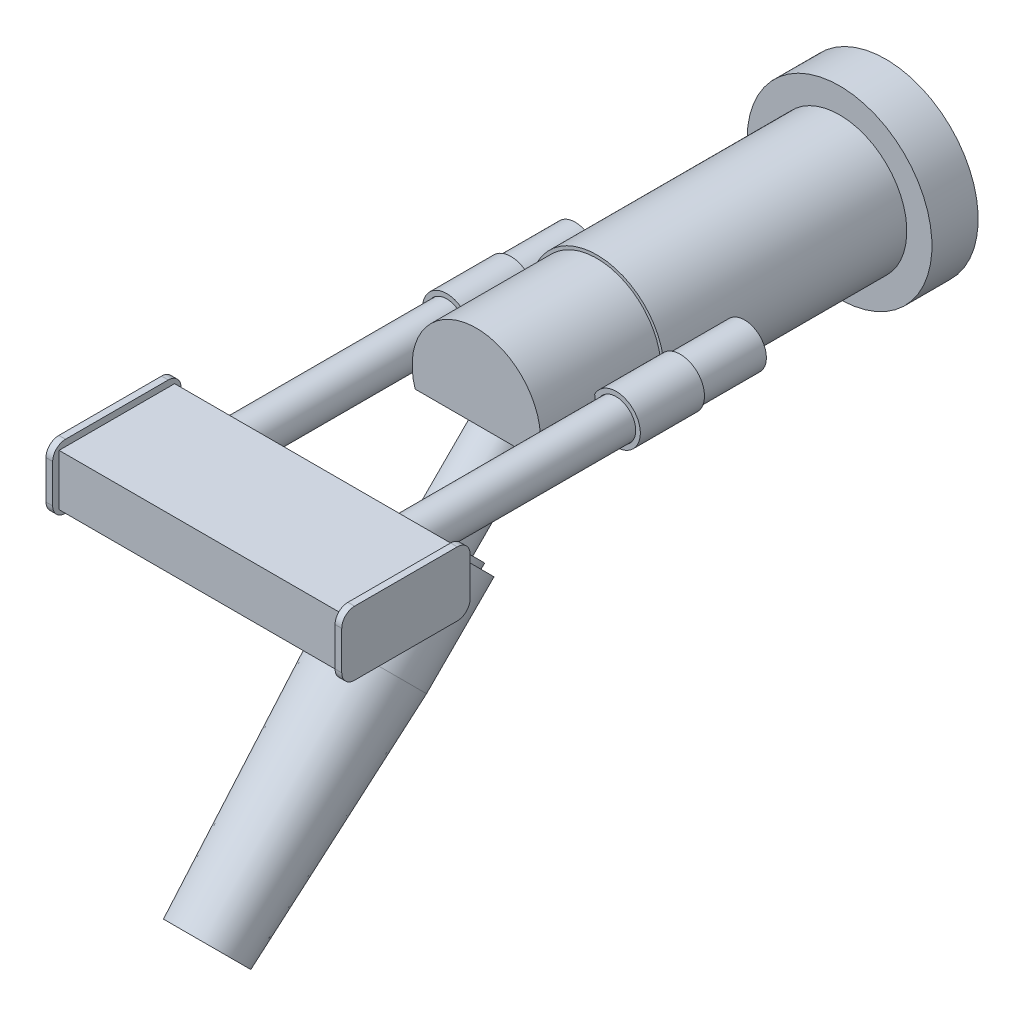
ISO-10303-21;
HEADER;
FILE_DESCRIPTION(('STEP AP214'),'2;1');
FILE_NAME('part.step','',(''),(''),'','','');
FILE_SCHEMA(('AUTOMOTIVE_DESIGN { 1 0 10303 214 1 1 1 1 }'));
ENDSEC;
DATA;
#1=APPLICATION_CONTEXT('core data for automotive mechanical design processes');
#2=APPLICATION_PROTOCOL_DEFINITION('international standard','automotive_design',2000,#1);
#3=PRODUCT_CONTEXT('',#1,'mechanical');
#4=PRODUCT('Part','Part','',(#3));
#5=PRODUCT_RELATED_PRODUCT_CATEGORY('part','',(#4));
#6=PRODUCT_DEFINITION_FORMATION('','',#4);
#7=PRODUCT_DEFINITION_CONTEXT('part definition',#1,'design');
#8=PRODUCT_DEFINITION('design','',#6,#7);
#9=PRODUCT_DEFINITION_SHAPE('','',#8);
#10=(LENGTH_UNIT() NAMED_UNIT(*) SI_UNIT(.MILLI.,.METRE.));
#11=(NAMED_UNIT(*) PLANE_ANGLE_UNIT() SI_UNIT($,.RADIAN.));
#12=(NAMED_UNIT(*) SI_UNIT($,.STERADIAN.) SOLID_ANGLE_UNIT());
#13=UNCERTAINTY_MEASURE_WITH_UNIT(LENGTH_MEASURE(1.E-05),#10,'distance_accuracy_value','');
#14=(GEOMETRIC_REPRESENTATION_CONTEXT(3) GLOBAL_UNCERTAINTY_ASSIGNED_CONTEXT((#13)) GLOBAL_UNIT_ASSIGNED_CONTEXT((#10,
#11,#12)) REPRESENTATION_CONTEXT('',''));
#15=CARTESIAN_POINT('',(0.,0.,0.));
#16=DIRECTION('',(0.,0.,1.));
#17=DIRECTION('',(1.,0.,0.));
#18=AXIS2_PLACEMENT_3D('',#15,#16,#17);
#19=CARTESIAN_POINT('',(0.,-21.0312000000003,191.0588));
#20=DIRECTION('',(0.,-0.707106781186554,0.70710678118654));
#21=DIRECTION('',(0.,-0.707106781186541,-0.707106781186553));
#22=AXIS2_PLACEMENT_3D('',#19,#20,#21);
#23=PLANE('',#22);
#24=CARTESIAN_POINT('',(0.,-21.0312000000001,191.0588));
#25=DIRECTION('',(0.,-0.707106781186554,0.70710678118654));
#26=DIRECTION('',(0.,-0.707106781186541,-0.707106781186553));
#27=AXIS2_PLACEMENT_3D('',#24,#25,#26);
#28=CIRCLE('',#27,12.573);
#29=CARTESIAN_POINT('',(-1.9943534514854E-12,-29.9216535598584,182.168346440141));
#30=VERTEX_POINT('',#29);
#31=EDGE_CURVE('E11',#30,#30,#28,.T.);
#32=ORIENTED_EDGE('',*,*,#31,.F.);
#33=EDGE_LOOP('',(#32));
#34=FACE_BOUND('',#33,.T.);
#35=ADVANCED_FACE('F33',(#34),#23,.F.);
#36=CARTESIAN_POINT('',(-2.22044604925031E-12,-165.685725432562,335.713325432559));
#37=DIRECTION('',(0.,-0.707106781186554,0.70710678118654));
#38=DIRECTION('',(0.,-0.707106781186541,-0.707106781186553));
#39=AXIS2_PLACEMENT_3D('',#36,#37,#38);
#40=CYLINDRICAL_SURFACE('',#39,12.573);
#41=CARTESIAN_POINT('',(0.,-49.6782170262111,219.70581702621));
#42=DIRECTION('',(0.,-0.707106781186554,0.70710678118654));
#43=DIRECTION('',(0.,-0.707106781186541,-0.707106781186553));
#44=AXIS2_PLACEMENT_3D('',#41,#42,#43);
#45=CIRCLE('',#44,12.573);
#46=CARTESIAN_POINT('',(-2.0420603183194E-12,-58.5686705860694,210.815363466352));
#47=VERTEX_POINT('',#46);
#48=EDGE_CURVE('E39',#47,#47,#45,.T.);
#49=CARTESIAN_POINT('',(-2.0420603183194E-12,-58.5686705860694,210.815363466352));
#50=CARTESIAN_POINT('',(-2.04156337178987E-12,-58.270264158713,210.516957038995));
#51=CARTESIAN_POINT('',(-2.04106642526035E-12,-57.9718577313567,210.218550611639));
#52=CARTESIAN_POINT('',(-2.04007253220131E-12,-57.3750448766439,209.621737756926));
#53=CARTESIAN_POINT('',(-2.03957558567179E-12,-57.0766384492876,209.32333132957));
#54=CARTESIAN_POINT('',(-2.03858169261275E-12,-56.4798255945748,208.726518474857));
#55=CARTESIAN_POINT('',(-2.03808474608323E-12,-56.1814191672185,208.428112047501));
#56=CARTESIAN_POINT('',(-2.03709085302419E-12,-55.5846063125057,207.831299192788));
#57=CARTESIAN_POINT('',(-2.03659390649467E-12,-55.2861998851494,207.532892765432));
#58=CARTESIAN_POINT('',(-2.03560001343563E-12,-54.6893870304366,206.936079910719));
#59=CARTESIAN_POINT('',(-2.0351030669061E-12,-54.3909806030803,206.637673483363));
#60=CARTESIAN_POINT('',(-2.03410917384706E-12,-53.7941677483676,206.04086062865));
#61=CARTESIAN_POINT('',(-2.03361222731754E-12,-53.4957613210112,205.742454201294));
#62=CARTESIAN_POINT('',(-2.0326183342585E-12,-52.8989484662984,205.145641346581));
#63=CARTESIAN_POINT('',(-2.03212138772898E-12,-52.6005420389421,204.847234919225));
#64=CARTESIAN_POINT('',(-2.03112749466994E-12,-52.0037291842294,204.250422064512));
#65=CARTESIAN_POINT('',(-2.03063054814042E-12,-51.705322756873,203.952015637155));
#66=CARTESIAN_POINT('',(-2.02963665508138E-12,-51.1085099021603,203.355202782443));
#67=CARTESIAN_POINT('',(-2.02913970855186E-12,-50.8101034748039,203.056796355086));
#68=CARTESIAN_POINT('',(-2.02814581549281E-12,-50.2132906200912,202.459983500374));
#69=CARTESIAN_POINT('',(-2.02764886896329E-12,-49.9148841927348,202.161577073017));
#70=CARTESIAN_POINT('',(-2.02665497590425E-12,-49.3180713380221,201.564764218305));
#71=CARTESIAN_POINT('',(-2.02615802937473E-12,-49.0196649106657,201.266357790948));
#72=CARTESIAN_POINT('',(-2.02516413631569E-12,-48.422852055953,200.669544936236));
#73=CARTESIAN_POINT('',(-2.02466718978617E-12,-48.1244456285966,200.371138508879));
#74=CARTESIAN_POINT('',(-2.02367329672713E-12,-47.5276327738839,199.774325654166));
#75=CARTESIAN_POINT('',(-2.02317635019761E-12,-47.2292263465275,199.47591922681));
#76=CARTESIAN_POINT('',(-2.02218245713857E-12,-46.6324134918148,198.879106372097));
#77=CARTESIAN_POINT('',(-2.02168551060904E-12,-46.3340070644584,198.580699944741));
#78=CARTESIAN_POINT('',(-2.02069161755E-12,-45.7371942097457,197.983887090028));
#79=CARTESIAN_POINT('',(-2.02019467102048E-12,-45.4387877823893,197.685480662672));
#80=CARTESIAN_POINT('',(-2.01920077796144E-12,-44.8419749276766,197.088667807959));
#81=CARTESIAN_POINT('',(-2.01870383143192E-12,-44.5435685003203,196.790261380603));
#82=CARTESIAN_POINT('',(-2.01770993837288E-12,-43.9467556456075,196.19344852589));
#83=CARTESIAN_POINT('',(-2.01721299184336E-12,-43.6483492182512,195.895042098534));
#84=CARTESIAN_POINT('',(-2.01621909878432E-12,-43.0515363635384,195.298229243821));
#85=CARTESIAN_POINT('',(-2.0157221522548E-12,-42.7531299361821,194.999822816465));
#86=CARTESIAN_POINT('',(-2.01472825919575E-12,-42.1563170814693,194.403009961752));
#87=CARTESIAN_POINT('',(-2.01423131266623E-12,-41.857910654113,194.104603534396));
#88=CARTESIAN_POINT('',(-2.01323741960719E-12,-41.2610977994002,193.507790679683));
#89=CARTESIAN_POINT('',(-2.01274047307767E-12,-40.9626913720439,193.209384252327));
#90=CARTESIAN_POINT('',(-2.01174658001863E-12,-40.3658785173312,192.612571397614));
#91=CARTESIAN_POINT('',(-2.01124963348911E-12,-40.0674720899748,192.314164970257));
#92=CARTESIAN_POINT('',(-2.01025574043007E-12,-39.470659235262,191.717352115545));
#93=CARTESIAN_POINT('',(-2.00975879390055E-12,-39.1722528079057,191.418945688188));
#94=CARTESIAN_POINT('',(-2.0087649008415E-12,-38.5754399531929,190.822132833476));
#95=CARTESIAN_POINT('',(-2.00826795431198E-12,-38.2770335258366,190.523726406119));
#96=CARTESIAN_POINT('',(-2.00727406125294E-12,-37.6802206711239,189.926913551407));
#97=CARTESIAN_POINT('',(-2.00677711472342E-12,-37.3818142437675,189.62850712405));
#98=CARTESIAN_POINT('',(-2.00578322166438E-12,-36.7850013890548,189.031694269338));
#99=CARTESIAN_POINT('',(-2.00528627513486E-12,-36.4865949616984,188.733287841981));
#100=CARTESIAN_POINT('',(-2.00429238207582E-12,-35.8897821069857,188.136474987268));
#101=CARTESIAN_POINT('',(-2.0037954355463E-12,-35.5913756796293,187.838068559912));
#102=CARTESIAN_POINT('',(-2.00280154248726E-12,-34.9945628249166,187.241255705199));
#103=CARTESIAN_POINT('',(-2.00230459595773E-12,-34.6961563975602,186.942849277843));
#104=CARTESIAN_POINT('',(-2.00131070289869E-12,-34.0993435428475,186.34603642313));
#105=CARTESIAN_POINT('',(-2.00081375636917E-12,-33.8009371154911,186.047629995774));
#106=CARTESIAN_POINT('',(-1.99981986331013E-12,-33.2041242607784,185.450817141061));
#107=CARTESIAN_POINT('',(-1.99932291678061E-12,-32.905717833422,185.152410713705));
#108=CARTESIAN_POINT('',(-1.99832902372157E-12,-32.3089049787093,184.555597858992));
#109=CARTESIAN_POINT('',(-1.99783207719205E-12,-32.0104985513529,184.257191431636));
#110=CARTESIAN_POINT('',(-1.99683818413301E-12,-31.4136856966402,183.660378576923));
#111=CARTESIAN_POINT('',(-1.99634123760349E-12,-31.1152792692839,183.361972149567));
#112=CARTESIAN_POINT('',(-1.99534734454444E-12,-30.5184664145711,182.765159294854));
#113=CARTESIAN_POINT('',(-1.99485039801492E-12,-30.2200599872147,182.466752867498));
#114=CARTESIAN_POINT('',(-1.9943534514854E-12,-29.9216535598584,182.168346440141));
#115=B_SPLINE_CURVE_WITH_KNOTS('',3,(#49,#50,#51,#52,#53,#54,#55,#56,#57,#58,#59,#60,#61,#62,
#63,#64,#65,#66,#67,#68,#69,#70,#71,#72,#73,#74,#75,#76,#77,#78,#79,#80,#81,#82,#83,#84,#85,#86,
#87,#88,#89,#90,#91,#92,#93,#94,#95,#96,#97,#98,#99,#100,#101,#102,#103,#104,#105,#106,#107,
#108,#109,#110,#111,#112,#113,#114),.UNSPECIFIED.,.F.,.F.,(4,2,2,2,2,2,2,2,2,2,2,2,2,2,2,2,2,2,
2,2,2,2,2,2,2,2,2,2,2,2,2,2,4),(0.,1.26603125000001,2.53206250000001,3.79809375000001,
5.06412500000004,6.33015625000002,7.59618750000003,8.86221875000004,10.1282500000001,
11.39428125,12.6603125,13.9263437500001,15.1923750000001,16.4584062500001,17.7244375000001,
18.9904687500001,20.2565000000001,21.5225312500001,22.7885625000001,24.0545937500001,
25.3206250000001,26.5866562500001,27.8526875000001,29.1187187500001,30.3847500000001,
31.6507812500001,32.9168125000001,34.1828437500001,35.4488750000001,36.7149062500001,
37.9809375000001,39.2469687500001,40.5130000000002),.UNSPECIFIED.);
#116=EDGE_CURVE('BSEAM90',#47,#30,#115,.T.);
#117=ORIENTED_EDGE('',*,*,#48,.F.);
#118=ORIENTED_EDGE('',*,*,#31,.T.);
#119=ORIENTED_EDGE('',*,*,#116,.T.);
#120=ORIENTED_EDGE('',*,*,#116,.F.);
#121=EDGE_LOOP('',(#117,#119,#118,#120));
#122=FACE_BOUND('',#121,.T.);
#123=ADVANCED_FACE('F90',(#122),#40,.T.);
#124=CARTESIAN_POINT('',(0.,-40.7877634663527,228.596270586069));
#125=DIRECTION('',(0.,-0.707106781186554,0.70710678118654));
#126=DIRECTION('',(0.,-0.707106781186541,-0.707106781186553));
#127=AXIS2_PLACEMENT_3D('',#124,#125,#126);
#128=PLANE('',#127);
#129=CARTESIAN_POINT('',(0.,-49.6782170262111,219.70581702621));
#130=DIRECTION('',(0.,-0.707106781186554,0.70710678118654));
#131=DIRECTION('',(0.,-0.707106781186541,-0.707106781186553));
#132=AXIS2_PLACEMENT_3D('',#129,#130,#131);
#133=CIRCLE('',#132,17.399);
#134=CARTESIAN_POINT('',(-2.0477432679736E-12,-61.9811679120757,207.402866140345));
#135=VERTEX_POINT('',#134);
#136=EDGE_CURVE('E43',#135,#135,#133,.T.);
#137=ORIENTED_EDGE('',*,*,#136,.F.);
#138=EDGE_LOOP('',(#137));
#139=FACE_BOUND('',#138,.T.);
#140=ORIENTED_EDGE('',*,*,#48,.T.);
#141=EDGE_LOOP('',(#140));
#142=FACE_BOUND('',#141,.T.);
#143=ADVANCED_FACE('F85',(#139,#142),#128,.F.);
#144=CARTESIAN_POINT('',(-2.22044604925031E-12,-165.685725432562,335.713325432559));
#145=DIRECTION('',(0.,-0.707106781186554,0.70710678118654));
#146=DIRECTION('',(0.,-0.707106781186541,-0.707106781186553));
#147=AXIS2_PLACEMENT_3D('',#144,#145,#146);
#148=CYLINDRICAL_SURFACE('',#147,17.399);
#149=CARTESIAN_POINT('',(0.,-51.4742682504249,221.501868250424));
#150=DIRECTION('',(0.,-0.707106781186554,0.70710678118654));
#151=DIRECTION('',(0.,-0.707106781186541,-0.707106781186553));
#152=AXIS2_PLACEMENT_3D('',#149,#150,#151);
#153=CIRCLE('',#152,17.399);
#154=CARTESIAN_POINT('',(-2.05073429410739E-12,-63.7772191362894,209.198917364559));
#155=VERTEX_POINT('',#154);
#156=EDGE_CURVE('E47',#155,#155,#153,.T.);
#157=CARTESIAN_POINT('',(-2.05073429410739E-12,-63.7772191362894,209.198917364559));
#158=CARTESIAN_POINT('',(-2.05070313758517E-12,-63.7585102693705,209.18020849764));
#159=CARTESIAN_POINT('',(-2.05067198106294E-12,-63.7398014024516,209.161499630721));
#160=CARTESIAN_POINT('',(-2.05060966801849E-12,-63.7023836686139,209.124081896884));
#161=CARTESIAN_POINT('',(-2.05057851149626E-12,-63.683674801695,209.105373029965));
#162=CARTESIAN_POINT('',(-2.0505161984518E-12,-63.6462570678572,209.067955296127));
#163=CARTESIAN_POINT('',(-2.05048504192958E-12,-63.6275482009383,209.049246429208));
#164=CARTESIAN_POINT('',(-2.05042272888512E-12,-63.5901304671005,209.01182869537));
#165=CARTESIAN_POINT('',(-2.0503915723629E-12,-63.5714216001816,208.993119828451));
#166=CARTESIAN_POINT('',(-2.05032925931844E-12,-63.5340038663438,208.955702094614));
#167=CARTESIAN_POINT('',(-2.05029810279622E-12,-63.5152949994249,208.936993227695));
#168=CARTESIAN_POINT('',(-2.05023578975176E-12,-63.4778772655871,208.899575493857));
#169=CARTESIAN_POINT('',(-2.05020463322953E-12,-63.4591683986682,208.880866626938));
#170=CARTESIAN_POINT('',(-2.05014232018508E-12,-63.4217506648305,208.8434488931));
#171=CARTESIAN_POINT('',(-2.05011116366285E-12,-63.4030417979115,208.824740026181));
#172=CARTESIAN_POINT('',(-2.0500488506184E-12,-63.3656240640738,208.787322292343));
#173=CARTESIAN_POINT('',(-2.05001769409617E-12,-63.3469151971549,208.768613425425));
#174=CARTESIAN_POINT('',(-2.04995538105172E-12,-63.3094974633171,208.731195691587));
#175=CARTESIAN_POINT('',(-2.04992422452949E-12,-63.2907885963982,208.712486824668));
#176=CARTESIAN_POINT('',(-2.04986191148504E-12,-63.2533708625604,208.67506909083));
#177=CARTESIAN_POINT('',(-2.04983075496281E-12,-63.2346619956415,208.656360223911));
#178=CARTESIAN_POINT('',(-2.04976844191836E-12,-63.1972442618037,208.618942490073));
#179=CARTESIAN_POINT('',(-2.04973728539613E-12,-63.1785353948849,208.600233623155));
#180=CARTESIAN_POINT('',(-2.04967497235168E-12,-63.1411176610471,208.562815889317));
#181=CARTESIAN_POINT('',(-2.04964381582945E-12,-63.1224087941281,208.544107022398));
#182=CARTESIAN_POINT('',(-2.04958150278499E-12,-63.0849910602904,208.50668928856));
#183=CARTESIAN_POINT('',(-2.04955034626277E-12,-63.0662821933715,208.487980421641));
#184=CARTESIAN_POINT('',(-2.04948803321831E-12,-63.0288644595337,208.450562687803));
#185=CARTESIAN_POINT('',(-2.04945687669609E-12,-63.0101555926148,208.431853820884));
#186=CARTESIAN_POINT('',(-2.04939456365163E-12,-62.972737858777,208.394436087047));
#187=CARTESIAN_POINT('',(-2.04936340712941E-12,-62.9540289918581,208.375727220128));
#188=CARTESIAN_POINT('',(-2.04930109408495E-12,-62.9166112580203,208.33830948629));
#189=CARTESIAN_POINT('',(-2.04926993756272E-12,-62.8979023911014,208.319600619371));
#190=CARTESIAN_POINT('',(-2.04920762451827E-12,-62.8604846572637,208.282182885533));
#191=CARTESIAN_POINT('',(-2.04917646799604E-12,-62.8417757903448,208.263474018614));
#192=CARTESIAN_POINT('',(-2.04911415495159E-12,-62.804358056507,208.226056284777));
#193=CARTESIAN_POINT('',(-2.04908299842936E-12,-62.7856491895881,208.207347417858));
#194=CARTESIAN_POINT('',(-2.04902068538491E-12,-62.7482314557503,208.16992968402));
#195=CARTESIAN_POINT('',(-2.04898952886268E-12,-62.7295225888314,208.151220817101));
#196=CARTESIAN_POINT('',(-2.04892721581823E-12,-62.6921048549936,208.113803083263));
#197=CARTESIAN_POINT('',(-2.048896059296E-12,-62.6733959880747,208.095094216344));
#198=CARTESIAN_POINT('',(-2.04883374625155E-12,-62.6359782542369,208.057676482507));
#199=CARTESIAN_POINT('',(-2.04880258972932E-12,-62.617269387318,208.038967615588));
#200=CARTESIAN_POINT('',(-2.04874027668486E-12,-62.5798516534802,208.00154988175));
#201=CARTESIAN_POINT('',(-2.04870912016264E-12,-62.5611427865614,207.982841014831));
#202=CARTESIAN_POINT('',(-2.04864680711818E-12,-62.5237250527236,207.945423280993));
#203=CARTESIAN_POINT('',(-2.04861565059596E-12,-62.5050161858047,207.926714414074));
#204=CARTESIAN_POINT('',(-2.0485533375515E-12,-62.4675984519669,207.889296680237));
#205=CARTESIAN_POINT('',(-2.04852218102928E-12,-62.448889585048,207.870587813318));
#206=CARTESIAN_POINT('',(-2.04845986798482E-12,-62.4114718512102,207.83317007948));
#207=CARTESIAN_POINT('',(-2.04842871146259E-12,-62.3927629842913,207.814461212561));
#208=CARTESIAN_POINT('',(-2.04836639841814E-12,-62.3553452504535,207.777043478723));
#209=CARTESIAN_POINT('',(-2.04833524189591E-12,-62.3366363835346,207.758334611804));
#210=CARTESIAN_POINT('',(-2.04827292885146E-12,-62.2992186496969,207.720916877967));
#211=CARTESIAN_POINT('',(-2.04824177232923E-12,-62.280509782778,207.702208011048));
#212=CARTESIAN_POINT('',(-2.04817945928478E-12,-62.2430920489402,207.66479027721));
#213=CARTESIAN_POINT('',(-2.04814830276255E-12,-62.2243831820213,207.646081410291));
#214=CARTESIAN_POINT('',(-2.0480859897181E-12,-62.1869654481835,207.608663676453));
#215=CARTESIAN_POINT('',(-2.04805483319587E-12,-62.1682565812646,207.589954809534));
#216=CARTESIAN_POINT('',(-2.04799252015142E-12,-62.1308388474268,207.552537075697));
#217=CARTESIAN_POINT('',(-2.04796136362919E-12,-62.1121299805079,207.533828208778));
#218=CARTESIAN_POINT('',(-2.04789905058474E-12,-62.0747122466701,207.49641047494));
#219=CARTESIAN_POINT('',(-2.04786789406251E-12,-62.0560033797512,207.477701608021));
#220=CARTESIAN_POINT('',(-2.04780558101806E-12,-62.0185856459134,207.440283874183));
#221=CARTESIAN_POINT('',(-2.04777442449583E-12,-61.9998767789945,207.421575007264));
#222=CARTESIAN_POINT('',(-2.0477432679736E-12,-61.9811679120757,207.402866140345));
#223=B_SPLINE_CURVE_WITH_KNOTS('',3,(#157,#158,#159,#160,#161,#162,#163,#164,#165,#166,#167,
#168,#169,#170,#171,#172,#173,#174,#175,#176,#177,#178,#179,#180,#181,#182,#183,#184,#185,#186,
#187,#188,#189,#190,#191,#192,#193,#194,#195,#196,#197,#198,#199,#200,#201,#202,#203,#204,#205,
#206,#207,#208,#209,#210,#211,#212,#213,#214,#215,#216,#217,#218,#219,#220,#221,#222),
.UNSPECIFIED.,.F.,.F.,(4,2,2,2,2,2,2,2,2,2,2,2,2,2,2,2,2,2,2,2,2,2,2,2,2,2,2,2,2,2,2,2,4),(0.,
0.0793749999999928,0.158749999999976,0.238124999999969,0.317499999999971,0.396874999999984,
0.476249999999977,0.55562499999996,0.634999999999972,0.714374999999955,0.793749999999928,
0.873124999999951,0.952499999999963,1.03187499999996,1.11124999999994,1.19062499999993,
1.26999999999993,1.34937499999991,1.42874999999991,1.5081249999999,1.58749999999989,
1.66687499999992,1.74624999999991,1.82562499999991,1.9049999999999,1.98437499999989,
2.06374999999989,2.14312499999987,2.2224999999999,2.30187499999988,2.38124999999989,
2.46062499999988,2.53999999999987),.UNSPECIFIED.);
#224=EDGE_CURVE('BSEAM79',#155,#135,#223,.T.);
#225=ORIENTED_EDGE('',*,*,#156,.F.);
#226=ORIENTED_EDGE('',*,*,#136,.T.);
#227=ORIENTED_EDGE('',*,*,#224,.T.);
#228=ORIENTED_EDGE('',*,*,#224,.F.);
#229=EDGE_LOOP('',(#225,#227,#226,#228));
#230=FACE_BOUND('',#229,.T.);
#231=ADVANCED_FACE('F79',(#230),#148,.T.);
#232=CARTESIAN_POINT('',(0.,-39.1713173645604,233.804819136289));
#233=DIRECTION('',(0.,-0.707106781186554,0.70710678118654));
#234=DIRECTION('',(0.,-0.707106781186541,-0.707106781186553));
#235=AXIS2_PLACEMENT_3D('',#232,#233,#234);
#236=PLANE('',#235);
#237=CARTESIAN_POINT('',(0.,-51.4742682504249,221.501868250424));
#238=DIRECTION('',(0.,-0.707106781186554,0.70710678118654));
#239=DIRECTION('',(0.,-0.707106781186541,-0.707106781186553));
#240=AXIS2_PLACEMENT_3D('',#237,#238,#239);
#241=CIRCLE('',#240,22.6441);
#242=CARTESIAN_POINT('',(-2.05691076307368E-12,-67.486064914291,205.490071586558));
#243=VERTEX_POINT('',#242);
#244=EDGE_CURVE('E52',#243,#243,#241,.T.);
#245=ORIENTED_EDGE('',*,*,#244,.F.);
#246=EDGE_LOOP('',(#245));
#247=FACE_BOUND('',#246,.T.);
#248=ORIENTED_EDGE('',*,*,#156,.T.);
#249=EDGE_LOOP('',(#248));
#250=FACE_BOUND('',#249,.T.);
#251=ADVANCED_FACE('F73',(#247,#250),#236,.F.);
#252=CARTESIAN_POINT('',(-2.22044604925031E-12,-165.685725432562,335.713325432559));
#253=DIRECTION('',(0.,-0.707106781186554,0.70710678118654));
#254=DIRECTION('',(0.,-0.707106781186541,-0.707106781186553));
#255=AXIS2_PLACEMENT_3D('',#252,#253,#254);
#256=CYLINDRICAL_SURFACE('',#255,22.6441);
#257=CARTESIAN_POINT('',(-2.22044604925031E-12,-84.8634203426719,254.89102034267));
#258=DIRECTION('',(0.,-0.707106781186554,0.70710678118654));
#259=DIRECTION('',(0.,-0.707106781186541,-0.707106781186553));
#260=AXIS2_PLACEMENT_3D('',#257,#258,#259);
#261=CIRCLE('',#260,22.6441);
#262=CARTESIAN_POINT('',(-2.11251487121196E-12,-100.875217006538,238.879223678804));
#263=VERTEX_POINT('',#262);
#264=EDGE_CURVE('E55',#263,#263,#261,.T.);
#265=CARTESIAN_POINT('',(-2.11251487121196E-12,-100.875217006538,238.879223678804));
#266=CARTESIAN_POINT('',(-2.11193566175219E-12,-100.52741333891,238.531420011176));
#267=CARTESIAN_POINT('',(-2.11135645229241E-12,-100.179609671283,238.183616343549));
#268=CARTESIAN_POINT('',(-2.11019803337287E-12,-99.4840023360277,237.488009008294));
#269=CARTESIAN_POINT('',(-2.10961882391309E-12,-99.1361986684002,237.140205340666));
#270=CARTESIAN_POINT('',(-2.10846040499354E-12,-98.440591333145,236.444598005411));
#271=CARTESIAN_POINT('',(-2.10788119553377E-12,-98.0927876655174,236.096794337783));
#272=CARTESIAN_POINT('',(-2.10672277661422E-12,-97.3971803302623,235.401187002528));
#273=CARTESIAN_POINT('',(-2.10614356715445E-12,-97.0493766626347,235.053383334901));
#274=CARTESIAN_POINT('',(-2.1049851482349E-12,-96.3537693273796,234.357775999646));
#275=CARTESIAN_POINT('',(-2.10440593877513E-12,-96.005965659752,234.009972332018));
#276=CARTESIAN_POINT('',(-2.10324751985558E-12,-95.3103583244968,233.314364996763));
#277=CARTESIAN_POINT('',(-2.10266831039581E-12,-94.9625546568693,232.966561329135));
#278=CARTESIAN_POINT('',(-2.10150989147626E-12,-94.2669473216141,232.27095399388));
#279=CARTESIAN_POINT('',(-2.10093068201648E-12,-93.9191436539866,231.923150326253));
#280=CARTESIAN_POINT('',(-2.09977226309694E-12,-93.2235363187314,231.227542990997));
#281=CARTESIAN_POINT('',(-2.09919305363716E-12,-92.8757326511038,230.87973932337));
#282=CARTESIAN_POINT('',(-2.09803463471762E-12,-92.1801253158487,230.184131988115));
#283=CARTESIAN_POINT('',(-2.09745542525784E-12,-91.8323216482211,229.836328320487));
#284=CARTESIAN_POINT('',(-2.09629700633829E-12,-91.136714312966,229.140720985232));
#285=CARTESIAN_POINT('',(-2.09571779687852E-12,-90.7889106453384,228.792917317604));
#286=CARTESIAN_POINT('',(-2.09455937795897E-12,-90.0933033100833,228.097309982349));
#287=CARTESIAN_POINT('',(-2.0939801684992E-12,-89.7454996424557,227.749506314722));
#288=CARTESIAN_POINT('',(-2.09282174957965E-12,-89.0498923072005,227.053898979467));
#289=CARTESIAN_POINT('',(-2.09224254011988E-12,-88.7020886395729,226.706095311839));
#290=CARTESIAN_POINT('',(-2.09108412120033E-12,-88.0064813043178,226.010487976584));
#291=CARTESIAN_POINT('',(-2.09050491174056E-12,-87.6586776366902,225.662684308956));
#292=CARTESIAN_POINT('',(-2.08934649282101E-12,-86.9630703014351,224.967076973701));
#293=CARTESIAN_POINT('',(-2.08876728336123E-12,-86.6152666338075,224.619273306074));
#294=CARTESIAN_POINT('',(-2.08760886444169E-12,-85.9196592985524,223.923665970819));
#295=CARTESIAN_POINT('',(-2.08702965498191E-12,-85.5718556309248,223.575862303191));
#296=CARTESIAN_POINT('',(-2.08587123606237E-12,-84.8762482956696,222.880254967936));
#297=CARTESIAN_POINT('',(-2.08529202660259E-12,-84.5284446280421,222.532451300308));
#298=CARTESIAN_POINT('',(-2.08413360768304E-12,-83.8328372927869,221.836843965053));
#299=CARTESIAN_POINT('',(-2.08355439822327E-12,-83.4850336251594,221.489040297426));
#300=CARTESIAN_POINT('',(-2.08239597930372E-12,-82.7894262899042,220.79343296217));
#301=CARTESIAN_POINT('',(-2.08181676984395E-12,-82.4416226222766,220.445629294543));
#302=CARTESIAN_POINT('',(-2.0806583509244E-12,-81.7460152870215,219.750021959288));
#303=CARTESIAN_POINT('',(-2.08007914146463E-12,-81.3982116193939,219.40221829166));
#304=CARTESIAN_POINT('',(-2.07892072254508E-12,-80.7026042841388,218.706610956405));
#305=CARTESIAN_POINT('',(-2.07834151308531E-12,-80.3548006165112,218.358807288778));
#306=CARTESIAN_POINT('',(-2.07718309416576E-12,-79.6591932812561,217.663199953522));
#307=CARTESIAN_POINT('',(-2.07660388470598E-12,-79.3113896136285,217.315396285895));
#308=CARTESIAN_POINT('',(-2.07544546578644E-12,-78.6157822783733,216.61978895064));
#309=CARTESIAN_POINT('',(-2.07486625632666E-12,-78.2679786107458,216.271985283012));
#310=CARTESIAN_POINT('',(-2.07370783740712E-12,-77.5723712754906,215.576377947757));
#311=CARTESIAN_POINT('',(-2.07312862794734E-12,-77.2245676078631,215.228574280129));
#312=CARTESIAN_POINT('',(-2.07197020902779E-12,-76.5289602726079,214.532966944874));
#313=CARTESIAN_POINT('',(-2.07139099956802E-12,-76.1811566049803,214.185163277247));
#314=CARTESIAN_POINT('',(-2.07023258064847E-12,-75.4855492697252,213.489555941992));
#315=CARTESIAN_POINT('',(-2.0696533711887E-12,-75.1377456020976,213.141752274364));
#316=CARTESIAN_POINT('',(-2.06849495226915E-12,-74.4421382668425,212.446144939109));
#317=CARTESIAN_POINT('',(-2.06791574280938E-12,-74.0943345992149,212.098341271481));
#318=CARTESIAN_POINT('',(-2.06675732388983E-12,-73.3987272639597,211.402733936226));
#319=CARTESIAN_POINT('',(-2.06617811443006E-12,-73.0509235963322,211.054930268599));
#320=CARTESIAN_POINT('',(-2.06501969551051E-12,-72.355316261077,210.359322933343));
#321=CARTESIAN_POINT('',(-2.06444048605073E-12,-72.0075125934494,210.011519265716));
#322=CARTESIAN_POINT('',(-2.06328206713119E-12,-71.3119052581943,209.315911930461));
#323=CARTESIAN_POINT('',(-2.06270285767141E-12,-70.9641015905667,208.968108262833));
#324=CARTESIAN_POINT('',(-2.06154443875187E-12,-70.2684942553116,208.272500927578));
#325=CARTESIAN_POINT('',(-2.06096522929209E-12,-69.920690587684,207.924697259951));
#326=CARTESIAN_POINT('',(-2.05980681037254E-12,-69.2250832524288,207.229089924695));
#327=CARTESIAN_POINT('',(-2.05922760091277E-12,-68.8772795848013,206.881286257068));
#328=CARTESIAN_POINT('',(-2.05806918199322E-12,-68.1816722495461,206.185678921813));
#329=CARTESIAN_POINT('',(-2.05748997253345E-12,-67.8338685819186,205.837875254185));
#330=CARTESIAN_POINT('',(-2.05691076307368E-12,-67.486064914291,205.490071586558));
#331=B_SPLINE_CURVE_WITH_KNOTS('',3,(#265,#266,#267,#268,#269,#270,#271,#272,#273,#274,#275,
#276,#277,#278,#279,#280,#281,#282,#283,#284,#285,#286,#287,#288,#289,#290,#291,#292,#293,#294,
#295,#296,#297,#298,#299,#300,#301,#302,#303,#304,#305,#306,#307,#308,#309,#310,#311,#312,#313,
#314,#315,#316,#317,#318,#319,#320,#321,#322,#323,#324,#325,#326,#327,#328,#329,#330),
.UNSPECIFIED.,.F.,.F.,(4,2,2,2,2,2,2,2,2,2,2,2,2,2,2,2,2,2,2,2,2,2,2,2,2,2,2,2,2,2,2,2,4),(0.,
1.47560599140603,2.95121198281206,4.4268179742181,5.90242396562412,7.37802995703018,
8.85363594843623,10.3292419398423,11.8048479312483,13.2804539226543,14.7560599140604,
16.2316659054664,17.7072718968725,19.1828778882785,20.6584838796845,22.1340898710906,
23.6096958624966,25.0853018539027,26.5609078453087,28.0365138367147,29.5121198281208,
30.9877258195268,32.4633318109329,33.9389378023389,35.4145437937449,36.890149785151,
38.365755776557,39.8413617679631,41.3169677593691,42.7925737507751,44.2681797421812,
45.7437857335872,47.2193917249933),.UNSPECIFIED.);
#332=EDGE_CURVE('BSEAM67',#263,#243,#331,.T.);
#333=ORIENTED_EDGE('',*,*,#264,.F.);
#334=ORIENTED_EDGE('',*,*,#244,.T.);
#335=ORIENTED_EDGE('',*,*,#332,.T.);
#336=ORIENTED_EDGE('',*,*,#332,.F.);
#337=EDGE_LOOP('',(#333,#335,#334,#336));
#338=FACE_BOUND('',#337,.T.);
#339=ADVANCED_FACE('F67',(#338),#256,.T.);
#340=CARTESIAN_POINT('',(-2.22044604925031E-12,-84.8634203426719,254.89102034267));
#341=DIRECTION('',(0.,0.707106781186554,-0.70710678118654));
#342=DIRECTION('',(0.,0.707106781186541,0.707106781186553));
#343=AXIS2_PLACEMENT_3D('',#340,#341,#342);
#344=CONICAL_SURFACE('',#343,22.6441,0.0436332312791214);
#345=CARTESIAN_POINT('',(-2.22044604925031E-12,-165.685725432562,335.713325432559));
#346=DIRECTION('',(0.,-0.707106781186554,0.70710678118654));
#347=DIRECTION('',(0.,-0.707106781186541,-0.707106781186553));
#348=AXIS2_PLACEMENT_3D('',#345,#346,#347);
#349=CIRCLE('',#348,17.6536542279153);
#350=CARTESIAN_POINT('',(-2.24123445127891E-12,-178.168744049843,323.230306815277));
#351=VERTEX_POINT('',#350);
#352=EDGE_CURVE('E58',#351,#351,#349,.T.);
#353=ORIENTED_EDGE('',*,*,#352,.F.);
#354=EDGE_LOOP('',(#353));
#355=FACE_BOUND('',#354,.T.);
#356=ORIENTED_EDGE('',*,*,#264,.T.);
#357=EDGE_LOOP('',(#356));
#358=FACE_BOUND('',#357,.T.);
#359=ADVANCED_FACE('F64',(#355,#358),#344,.T.);
#360=CARTESIAN_POINT('',(-2.22044604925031E-12,-165.685725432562,335.713325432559));
#361=DIRECTION('',(0.,0.707106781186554,-0.70710678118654));
#362=DIRECTION('',(0.,0.707106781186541,0.707106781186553));
#363=AXIS2_PLACEMENT_3D('',#360,#361,#362);
#364=PLANE('',#363);
#365=ORIENTED_EDGE('',*,*,#352,.T.);
#366=EDGE_LOOP('',(#365));
#367=FACE_BOUND('',#366,.T.);
#368=ADVANCED_FACE('F62',(#367),#364,.F.);
#369=CLOSED_SHELL('',(#35,#123,#143,#231,#251,#339,#359,#368));
#370=MANIFOLD_SOLID_BREP('B2',#369);
#371=CARTESIAN_POINT('',(-41.9099999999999,0.,111.76));
#372=DIRECTION('',(0.,0.,0.999999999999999));
#373=DIRECTION('',(-1.,0.,0.));
#374=AXIS2_PLACEMENT_3D('',#371,#372,#373);
#375=CYLINDRICAL_SURFACE('',#374,10.795);
#376=CARTESIAN_POINT('',(-41.9099999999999,0.,111.76));
#377=DIRECTION('',(0.,0.,-0.999999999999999));
#378=DIRECTION('',(-1.,0.,0.));
#379=AXIS2_PLACEMENT_3D('',#376,#377,#378);
#380=CIRCLE('',#379,10.795);
#381=CARTESIAN_POINT('',(-52.7049999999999,0.,111.76));
#382=VERTEX_POINT('',#381);
#383=EDGE_CURVE('E32',#382,#382,#380,.T.);
#384=CARTESIAN_POINT('',(-41.9099999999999,0.,143.51));
#385=DIRECTION('',(0.,0.,-0.999999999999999));
#386=DIRECTION('',(-1.,0.,0.));
#387=AXIS2_PLACEMENT_3D('',#384,#385,#386);
#388=CIRCLE('',#387,10.795);
#389=CARTESIAN_POINT('',(-52.7049999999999,0.,143.51));
#390=VERTEX_POINT('',#389);
#391=EDGE_CURVE('E130',#390,#390,#388,.T.);
#392=CARTESIAN_POINT('',(-52.7049999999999,0.,111.76));
#393=CARTESIAN_POINT('',(-52.7049999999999,0.,112.090729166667));
#394=CARTESIAN_POINT('',(-52.7049999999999,0.,112.421458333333));
#395=CARTESIAN_POINT('',(-52.7049999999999,0.,113.082916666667));
#396=CARTESIAN_POINT('',(-52.7049999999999,0.,113.413645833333));
#397=CARTESIAN_POINT('',(-52.7049999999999,0.,114.075104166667));
#398=CARTESIAN_POINT('',(-52.7049999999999,0.,114.405833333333));
#399=CARTESIAN_POINT('',(-52.7049999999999,0.,115.067291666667));
#400=CARTESIAN_POINT('',(-52.7049999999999,0.,115.398020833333));
#401=CARTESIAN_POINT('',(-52.7049999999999,0.,116.059479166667));
#402=CARTESIAN_POINT('',(-52.7049999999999,0.,116.390208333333));
#403=CARTESIAN_POINT('',(-52.7049999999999,0.,117.051666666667));
#404=CARTESIAN_POINT('',(-52.7049999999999,0.,117.382395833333));
#405=CARTESIAN_POINT('',(-52.7049999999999,0.,118.043854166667));
#406=CARTESIAN_POINT('',(-52.7049999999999,0.,118.374583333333));
#407=CARTESIAN_POINT('',(-52.7049999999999,0.,119.036041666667));
#408=CARTESIAN_POINT('',(-52.7049999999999,0.,119.366770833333));
#409=CARTESIAN_POINT('',(-52.7049999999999,0.,120.028229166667));
#410=CARTESIAN_POINT('',(-52.7049999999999,0.,120.358958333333));
#411=CARTESIAN_POINT('',(-52.7049999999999,0.,121.020416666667));
#412=CARTESIAN_POINT('',(-52.7049999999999,0.,121.351145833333));
#413=CARTESIAN_POINT('',(-52.7049999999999,0.,122.012604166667));
#414=CARTESIAN_POINT('',(-52.7049999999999,0.,122.343333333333));
#415=CARTESIAN_POINT('',(-52.7049999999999,0.,123.004791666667));
#416=CARTESIAN_POINT('',(-52.7049999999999,0.,123.335520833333));
#417=CARTESIAN_POINT('',(-52.7049999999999,0.,123.996979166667));
#418=CARTESIAN_POINT('',(-52.7049999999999,0.,124.327708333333));
#419=CARTESIAN_POINT('',(-52.7049999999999,0.,124.989166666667));
#420=CARTESIAN_POINT('',(-52.7049999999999,0.,125.319895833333));
#421=CARTESIAN_POINT('',(-52.7049999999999,0.,125.981354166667));
#422=CARTESIAN_POINT('',(-52.7049999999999,0.,126.312083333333));
#423=CARTESIAN_POINT('',(-52.7049999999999,0.,126.973541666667));
#424=CARTESIAN_POINT('',(-52.7049999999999,0.,127.304270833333));
#425=CARTESIAN_POINT('',(-52.7049999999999,0.,127.965729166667));
#426=CARTESIAN_POINT('',(-52.7049999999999,0.,128.296458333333));
#427=CARTESIAN_POINT('',(-52.7049999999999,0.,128.957916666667));
#428=CARTESIAN_POINT('',(-52.7049999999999,0.,129.288645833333));
#429=CARTESIAN_POINT('',(-52.7049999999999,0.,129.950104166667));
#430=CARTESIAN_POINT('',(-52.7049999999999,0.,130.280833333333));
#431=CARTESIAN_POINT('',(-52.7049999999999,0.,130.942291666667));
#432=CARTESIAN_POINT('',(-52.7049999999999,0.,131.273020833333));
#433=CARTESIAN_POINT('',(-52.7049999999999,0.,131.934479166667));
#434=CARTESIAN_POINT('',(-52.7049999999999,0.,132.265208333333));
#435=CARTESIAN_POINT('',(-52.7049999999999,0.,132.926666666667));
#436=CARTESIAN_POINT('',(-52.7049999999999,0.,133.257395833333));
#437=CARTESIAN_POINT('',(-52.7049999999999,0.,133.918854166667));
#438=CARTESIAN_POINT('',(-52.7049999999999,0.,134.249583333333));
#439=CARTESIAN_POINT('',(-52.7049999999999,0.,134.911041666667));
#440=CARTESIAN_POINT('',(-52.7049999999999,0.,135.241770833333));
#441=CARTESIAN_POINT('',(-52.7049999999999,0.,135.903229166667));
#442=CARTESIAN_POINT('',(-52.7049999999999,0.,136.233958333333));
#443=CARTESIAN_POINT('',(-52.7049999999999,0.,136.895416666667));
#444=CARTESIAN_POINT('',(-52.7049999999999,0.,137.226145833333));
#445=CARTESIAN_POINT('',(-52.7049999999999,0.,137.887604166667));
#446=CARTESIAN_POINT('',(-52.7049999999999,0.,138.218333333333));
#447=CARTESIAN_POINT('',(-52.7049999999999,0.,138.879791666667));
#448=CARTESIAN_POINT('',(-52.7049999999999,0.,139.210520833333));
#449=CARTESIAN_POINT('',(-52.7049999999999,0.,139.871979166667));
#450=CARTESIAN_POINT('',(-52.7049999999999,0.,140.202708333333));
#451=CARTESIAN_POINT('',(-52.7049999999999,0.,140.864166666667));
#452=CARTESIAN_POINT('',(-52.7049999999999,0.,141.194895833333));
#453=CARTESIAN_POINT('',(-52.7049999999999,0.,141.856354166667));
#454=CARTESIAN_POINT('',(-52.7049999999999,0.,142.187083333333));
#455=CARTESIAN_POINT('',(-52.7049999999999,0.,142.848541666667));
#456=CARTESIAN_POINT('',(-52.7049999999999,0.,143.179270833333));
#457=CARTESIAN_POINT('',(-52.7049999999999,0.,143.51));
#458=B_SPLINE_CURVE_WITH_KNOTS('',3,(#392,#393,#394,#395,#396,#397,#398,#399,#400,#401,#402,
#403,#404,#405,#406,#407,#408,#409,#410,#411,#412,#413,#414,#415,#416,#417,#418,#419,#420,#421,
#422,#423,#424,#425,#426,#427,#428,#429,#430,#431,#432,#433,#434,#435,#436,#437,#438,#439,#440,
#441,#442,#443,#444,#445,#446,#447,#448,#449,#450,#451,#452,#453,#454,#455,#456,#457),
.UNSPECIFIED.,.F.,.F.,(4,2,2,2,2,2,2,2,2,2,2,2,2,2,2,2,2,2,2,2,2,2,2,2,2,2,2,2,2,2,2,2,4),(0.,
0.992187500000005,1.98437500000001,2.9765625,3.96875000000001,4.9609375,5.953125,
6.94531249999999,7.9375,8.92968749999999,9.921875,10.9140625,11.90625,12.8984375,13.890625,
14.8828125,15.875,16.8671875,17.859375,18.8515625,19.84375,20.8359375,21.828125,22.8203125,
23.8125,24.8046875,25.796875,26.7890625,27.78125,28.7734375,29.765625,30.7578125,31.75),.UNSPECIFIED.);
#459=EDGE_CURVE('BSEAM124',#382,#390,#458,.T.);
#460=ORIENTED_EDGE('',*,*,#383,.F.);
#461=ORIENTED_EDGE('',*,*,#391,.T.);
#462=ORIENTED_EDGE('',*,*,#459,.T.);
#463=ORIENTED_EDGE('',*,*,#459,.F.);
#464=EDGE_LOOP('',(#460,#462,#461,#463));
#465=FACE_BOUND('',#464,.T.);
#466=ADVANCED_FACE('F124',(#465),#375,.T.);
#467=CARTESIAN_POINT('',(-41.9099999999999,0.,111.76));
#468=DIRECTION('',(0.,0.,0.999999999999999));
#469=DIRECTION('',(-1.,0.,0.));
#470=AXIS2_PLACEMENT_3D('',#467,#468,#469);
#471=PLANE('',#470);
#472=ORIENTED_EDGE('',*,*,#383,.T.);
#473=EDGE_LOOP('',(#472));
#474=FACE_BOUND('',#473,.T.);
#475=ADVANCED_FACE('F139',(#474),#471,.F.);
#476=CARTESIAN_POINT('',(-41.9099999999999,0.,143.51));
#477=DIRECTION('',(0.,0.,0.999999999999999));
#478=DIRECTION('',(-1.,0.,0.));
#479=AXIS2_PLACEMENT_3D('',#476,#477,#478);
#480=PLANE('',#479);
#481=ORIENTED_EDGE('',*,*,#391,.F.);
#482=EDGE_LOOP('',(#481));
#483=FACE_BOUND('',#482,.T.);
#484=ADVANCED_FACE('F137',(#483),#480,.T.);
#485=CLOSED_SHELL('',(#466,#475,#484));
#486=MANIFOLD_SOLID_BREP('B6',#485);
#487=CARTESIAN_POINT('',(-41.9099999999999,0.,175.26));
#488=DIRECTION('',(0.,0.,0.999999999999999));
#489=DIRECTION('',(-1.,0.,0.));
#490=AXIS2_PLACEMENT_3D('',#487,#488,#489);
#491=PLANE('',#490);
#492=CARTESIAN_POINT('',(-41.9099999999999,0.,175.26));
#493=DIRECTION('',(0.,0.,-0.999999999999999));
#494=DIRECTION('',(-1.,0.,0.));
#495=AXIS2_PLACEMENT_3D('',#492,#493,#494);
#496=CIRCLE('',#495,11.938);
#497=CARTESIAN_POINT('',(-29.9719999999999,0.,175.26));
#498=VERTEX_POINT('',#497);
#499=EDGE_CURVE('E123',#498,#498,#496,.T.);
#500=ORIENTED_EDGE('',*,*,#499,.F.);
#501=EDGE_LOOP('',(#500));
#502=FACE_BOUND('',#501,.T.);
#503=CARTESIAN_POINT('',(-41.9099999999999,0.,175.26));
#504=DIRECTION('',(0.,0.,-0.999999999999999));
#505=DIRECTION('',(-1.,0.,0.));
#506=AXIS2_PLACEMENT_3D('',#503,#504,#505);
#507=CIRCLE('',#506,9.652);
#508=CARTESIAN_POINT('',(-32.2579999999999,0.,175.26));
#509=VERTEX_POINT('',#508);
#510=EDGE_CURVE('E171',#509,#509,#507,.T.);
#511=ORIENTED_EDGE('',*,*,#510,.T.);
#512=EDGE_LOOP('',(#511));
#513=FACE_BOUND('',#512,.T.);
#514=ADVANCED_FACE('F160',(#502,#513),#491,.T.);
#515=CARTESIAN_POINT('',(-41.9099999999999,0.,143.51));
#516=DIRECTION('',(0.,0.,0.999999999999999));
#517=DIRECTION('',(-1.,0.,0.));
#518=AXIS2_PLACEMENT_3D('',#515,#516,#517);
#519=PLANE('',#518);
#520=CARTESIAN_POINT('',(-41.9099999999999,0.,143.51));
#521=DIRECTION('',(0.,0.,-0.999999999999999));
#522=DIRECTION('',(-1.,0.,0.));
#523=AXIS2_PLACEMENT_3D('',#520,#521,#522);
#524=CIRCLE('',#523,11.938);
#525=CARTESIAN_POINT('',(-29.9719999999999,0.,143.51));
#526=VERTEX_POINT('',#525);
#527=EDGE_CURVE('E167',#526,#526,#524,.T.);
#528=ORIENTED_EDGE('',*,*,#527,.T.);
#529=EDGE_LOOP('',(#528));
#530=FACE_BOUND('',#529,.T.);
#531=CARTESIAN_POINT('',(-41.9099999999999,0.,143.51));
#532=DIRECTION('',(0.,0.,-0.999999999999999));
#533=DIRECTION('',(-1.,0.,0.));
#534=AXIS2_PLACEMENT_3D('',#531,#532,#533);
#535=CIRCLE('',#534,9.652);
#536=CARTESIAN_POINT('',(-32.2579999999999,0.,143.51));
#537=VERTEX_POINT('',#536);
#538=EDGE_CURVE('E175',#537,#537,#535,.T.);
#539=ORIENTED_EDGE('',*,*,#538,.F.);
#540=EDGE_LOOP('',(#539));
#541=FACE_BOUND('',#540,.T.);
#542=ADVANCED_FACE('F183',(#530,#541),#519,.F.);
#543=CARTESIAN_POINT('',(-41.9099999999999,0.,175.26));
#544=DIRECTION('',(0.,0.,-0.999999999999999));
#545=DIRECTION('',(1.,0.,0.));
#546=AXIS2_PLACEMENT_3D('',#543,#544,#545);
#547=CYLINDRICAL_SURFACE('',#546,11.938);
#548=CARTESIAN_POINT('',(-29.9719999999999,0.,175.26));
#549=CARTESIAN_POINT('',(-29.9719999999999,0.,174.929270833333));
#550=CARTESIAN_POINT('',(-29.9719999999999,0.,174.598541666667));
#551=CARTESIAN_POINT('',(-29.9719999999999,0.,173.937083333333));
#552=CARTESIAN_POINT('',(-29.9719999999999,0.,173.606354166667));
#553=CARTESIAN_POINT('',(-29.9719999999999,0.,172.944895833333));
#554=CARTESIAN_POINT('',(-29.9719999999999,0.,172.614166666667));
#555=CARTESIAN_POINT('',(-29.9719999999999,0.,171.952708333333));
#556=CARTESIAN_POINT('',(-29.9719999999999,0.,171.621979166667));
#557=CARTESIAN_POINT('',(-29.9719999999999,0.,170.960520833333));
#558=CARTESIAN_POINT('',(-29.9719999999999,0.,170.629791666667));
#559=CARTESIAN_POINT('',(-29.9719999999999,0.,169.968333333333));
#560=CARTESIAN_POINT('',(-29.9719999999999,0.,169.637604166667));
#561=CARTESIAN_POINT('',(-29.9719999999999,0.,168.976145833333));
#562=CARTESIAN_POINT('',(-29.9719999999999,0.,168.645416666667));
#563=CARTESIAN_POINT('',(-29.9719999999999,0.,167.983958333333));
#564=CARTESIAN_POINT('',(-29.9719999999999,0.,167.653229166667));
#565=CARTESIAN_POINT('',(-29.9719999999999,0.,166.991770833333));
#566=CARTESIAN_POINT('',(-29.9719999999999,0.,166.661041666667));
#567=CARTESIAN_POINT('',(-29.9719999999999,0.,165.999583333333));
#568=CARTESIAN_POINT('',(-29.9719999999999,0.,165.668854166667));
#569=CARTESIAN_POINT('',(-29.9719999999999,0.,165.007395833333));
#570=CARTESIAN_POINT('',(-29.9719999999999,0.,164.676666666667));
#571=CARTESIAN_POINT('',(-29.9719999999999,0.,164.015208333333));
#572=CARTESIAN_POINT('',(-29.9719999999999,0.,163.684479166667));
#573=CARTESIAN_POINT('',(-29.9719999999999,0.,163.023020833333));
#574=CARTESIAN_POINT('',(-29.9719999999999,0.,162.692291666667));
#575=CARTESIAN_POINT('',(-29.9719999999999,0.,162.030833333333));
#576=CARTESIAN_POINT('',(-29.9719999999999,0.,161.700104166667));
#577=CARTESIAN_POINT('',(-29.9719999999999,0.,161.038645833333));
#578=CARTESIAN_POINT('',(-29.9719999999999,0.,160.707916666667));
#579=CARTESIAN_POINT('',(-29.9719999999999,0.,160.046458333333));
#580=CARTESIAN_POINT('',(-29.9719999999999,0.,159.715729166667));
#581=CARTESIAN_POINT('',(-29.9719999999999,0.,159.054270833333));
#582=CARTESIAN_POINT('',(-29.9719999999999,0.,158.723541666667));
#583=CARTESIAN_POINT('',(-29.9719999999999,0.,158.062083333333));
#584=CARTESIAN_POINT('',(-29.9719999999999,0.,157.731354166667));
#585=CARTESIAN_POINT('',(-29.9719999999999,0.,157.069895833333));
#586=CARTESIAN_POINT('',(-29.9719999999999,0.,156.739166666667));
#587=CARTESIAN_POINT('',(-29.9719999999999,0.,156.077708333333));
#588=CARTESIAN_POINT('',(-29.9719999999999,0.,155.746979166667));
#589=CARTESIAN_POINT('',(-29.9719999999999,0.,155.085520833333));
#590=CARTESIAN_POINT('',(-29.9719999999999,0.,154.754791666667));
#591=CARTESIAN_POINT('',(-29.9719999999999,0.,154.093333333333));
#592=CARTESIAN_POINT('',(-29.9719999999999,0.,153.762604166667));
#593=CARTESIAN_POINT('',(-29.9719999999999,0.,153.101145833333));
#594=CARTESIAN_POINT('',(-29.9719999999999,0.,152.770416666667));
#595=CARTESIAN_POINT('',(-29.9719999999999,0.,152.108958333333));
#596=CARTESIAN_POINT('',(-29.9719999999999,0.,151.778229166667));
#597=CARTESIAN_POINT('',(-29.9719999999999,0.,151.116770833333));
#598=CARTESIAN_POINT('',(-29.9719999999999,0.,150.786041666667));
#599=CARTESIAN_POINT('',(-29.9719999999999,0.,150.124583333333));
#600=CARTESIAN_POINT('',(-29.9719999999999,0.,149.793854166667));
#601=CARTESIAN_POINT('',(-29.9719999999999,0.,149.132395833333));
#602=CARTESIAN_POINT('',(-29.9719999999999,0.,148.801666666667));
#603=CARTESIAN_POINT('',(-29.9719999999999,0.,148.140208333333));
#604=CARTESIAN_POINT('',(-29.9719999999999,0.,147.809479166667));
#605=CARTESIAN_POINT('',(-29.9719999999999,0.,147.148020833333));
#606=CARTESIAN_POINT('',(-29.9719999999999,0.,146.817291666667));
#607=CARTESIAN_POINT('',(-29.9719999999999,0.,146.155833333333));
#608=CARTESIAN_POINT('',(-29.9719999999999,0.,145.825104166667));
#609=CARTESIAN_POINT('',(-29.9719999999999,0.,145.163645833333));
#610=CARTESIAN_POINT('',(-29.9719999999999,0.,144.832916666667));
#611=CARTESIAN_POINT('',(-29.9719999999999,0.,144.171458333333));
#612=CARTESIAN_POINT('',(-29.9719999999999,0.,143.840729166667));
#613=CARTESIAN_POINT('',(-29.9719999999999,0.,143.51));
#614=B_SPLINE_CURVE_WITH_KNOTS('',3,(#548,#549,#550,#551,#552,#553,#554,#555,#556,#557,#558,
#559,#560,#561,#562,#563,#564,#565,#566,#567,#568,#569,#570,#571,#572,#573,#574,#575,#576,#577,
#578,#579,#580,#581,#582,#583,#584,#585,#586,#587,#588,#589,#590,#591,#592,#593,#594,#595,#596,
#597,#598,#599,#600,#601,#602,#603,#604,#605,#606,#607,#608,#609,#610,#611,#612,#613),
.UNSPECIFIED.,.F.,.F.,(4,2,2,2,2,2,2,2,2,2,2,2,2,2,2,2,2,2,2,2,2,2,2,2,2,2,2,2,2,2,2,2,4),(0.,
0.992187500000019,1.98437500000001,2.97656250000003,3.96875000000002,4.96093750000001,
5.95312500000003,6.94531250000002,7.93750000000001,8.92968750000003,9.92187500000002,10.9140625,
11.90625,12.8984375,13.890625,14.8828125,15.875,16.8671875,17.859375,18.8515625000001,19.84375,
20.8359375,21.8281250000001,22.8203125,23.8125,24.8046875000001,25.7968750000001,26.7890625,
27.7812500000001,28.7734375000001,29.765625,30.7578125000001,31.7500000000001),.UNSPECIFIED.);
#615=EDGE_CURVE('BSEAM162',#498,#526,#614,.T.);
#616=ORIENTED_EDGE('',*,*,#499,.T.);
#617=ORIENTED_EDGE('',*,*,#527,.F.);
#618=ORIENTED_EDGE('',*,*,#615,.T.);
#619=ORIENTED_EDGE('',*,*,#615,.F.);
#620=EDGE_LOOP('',(#616,#618,#617,#619));
#621=FACE_BOUND('',#620,.T.);
#622=ADVANCED_FACE('F162',(#621),#547,.T.);
#623=CARTESIAN_POINT('',(-41.9099999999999,0.,175.26));
#624=DIRECTION('',(0.,0.,-0.999999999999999));
#625=DIRECTION('',(1.,0.,0.));
#626=AXIS2_PLACEMENT_3D('',#623,#624,#625);
#627=CYLINDRICAL_SURFACE('',#626,9.652);
#628=CARTESIAN_POINT('',(-32.2579999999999,0.,175.26));
#629=CARTESIAN_POINT('',(-32.2579999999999,0.,174.929270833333));
#630=CARTESIAN_POINT('',(-32.2579999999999,0.,174.598541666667));
#631=CARTESIAN_POINT('',(-32.2579999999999,0.,173.937083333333));
#632=CARTESIAN_POINT('',(-32.2579999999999,0.,173.606354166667));
#633=CARTESIAN_POINT('',(-32.2579999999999,0.,172.944895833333));
#634=CARTESIAN_POINT('',(-32.2579999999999,0.,172.614166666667));
#635=CARTESIAN_POINT('',(-32.2579999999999,0.,171.952708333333));
#636=CARTESIAN_POINT('',(-32.2579999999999,0.,171.621979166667));
#637=CARTESIAN_POINT('',(-32.2579999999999,0.,170.960520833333));
#638=CARTESIAN_POINT('',(-32.2579999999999,0.,170.629791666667));
#639=CARTESIAN_POINT('',(-32.2579999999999,0.,169.968333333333));
#640=CARTESIAN_POINT('',(-32.2579999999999,0.,169.637604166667));
#641=CARTESIAN_POINT('',(-32.2579999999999,0.,168.976145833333));
#642=CARTESIAN_POINT('',(-32.2579999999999,0.,168.645416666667));
#643=CARTESIAN_POINT('',(-32.2579999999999,0.,167.983958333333));
#644=CARTESIAN_POINT('',(-32.2579999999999,0.,167.653229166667));
#645=CARTESIAN_POINT('',(-32.2579999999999,0.,166.991770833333));
#646=CARTESIAN_POINT('',(-32.2579999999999,0.,166.661041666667));
#647=CARTESIAN_POINT('',(-32.2579999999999,0.,165.999583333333));
#648=CARTESIAN_POINT('',(-32.2579999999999,0.,165.668854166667));
#649=CARTESIAN_POINT('',(-32.2579999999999,0.,165.007395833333));
#650=CARTESIAN_POINT('',(-32.2579999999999,0.,164.676666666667));
#651=CARTESIAN_POINT('',(-32.2579999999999,0.,164.015208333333));
#652=CARTESIAN_POINT('',(-32.2579999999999,0.,163.684479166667));
#653=CARTESIAN_POINT('',(-32.2579999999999,0.,163.023020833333));
#654=CARTESIAN_POINT('',(-32.2579999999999,0.,162.692291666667));
#655=CARTESIAN_POINT('',(-32.2579999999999,0.,162.030833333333));
#656=CARTESIAN_POINT('',(-32.2579999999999,0.,161.700104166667));
#657=CARTESIAN_POINT('',(-32.2579999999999,0.,161.038645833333));
#658=CARTESIAN_POINT('',(-32.2579999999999,0.,160.707916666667));
#659=CARTESIAN_POINT('',(-32.2579999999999,0.,160.046458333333));
#660=CARTESIAN_POINT('',(-32.2579999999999,0.,159.715729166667));
#661=CARTESIAN_POINT('',(-32.2579999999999,0.,159.054270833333));
#662=CARTESIAN_POINT('',(-32.2579999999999,0.,158.723541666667));
#663=CARTESIAN_POINT('',(-32.2579999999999,0.,158.062083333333));
#664=CARTESIAN_POINT('',(-32.2579999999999,0.,157.731354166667));
#665=CARTESIAN_POINT('',(-32.2579999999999,0.,157.069895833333));
#666=CARTESIAN_POINT('',(-32.2579999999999,0.,156.739166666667));
#667=CARTESIAN_POINT('',(-32.2579999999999,0.,156.077708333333));
#668=CARTESIAN_POINT('',(-32.2579999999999,0.,155.746979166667));
#669=CARTESIAN_POINT('',(-32.2579999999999,0.,155.085520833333));
#670=CARTESIAN_POINT('',(-32.2579999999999,0.,154.754791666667));
#671=CARTESIAN_POINT('',(-32.2579999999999,0.,154.093333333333));
#672=CARTESIAN_POINT('',(-32.2579999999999,0.,153.762604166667));
#673=CARTESIAN_POINT('',(-32.2579999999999,0.,153.101145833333));
#674=CARTESIAN_POINT('',(-32.2579999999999,0.,152.770416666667));
#675=CARTESIAN_POINT('',(-32.2579999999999,0.,152.108958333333));
#676=CARTESIAN_POINT('',(-32.2579999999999,0.,151.778229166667));
#677=CARTESIAN_POINT('',(-32.2579999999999,0.,151.116770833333));
#678=CARTESIAN_POINT('',(-32.2579999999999,0.,150.786041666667));
#679=CARTESIAN_POINT('',(-32.2579999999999,0.,150.124583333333));
#680=CARTESIAN_POINT('',(-32.2579999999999,0.,149.793854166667));
#681=CARTESIAN_POINT('',(-32.2579999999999,0.,149.132395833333));
#682=CARTESIAN_POINT('',(-32.2579999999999,0.,148.801666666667));
#683=CARTESIAN_POINT('',(-32.2579999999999,0.,148.140208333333));
#684=CARTESIAN_POINT('',(-32.2579999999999,0.,147.809479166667));
#685=CARTESIAN_POINT('',(-32.2579999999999,0.,147.148020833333));
#686=CARTESIAN_POINT('',(-32.2579999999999,0.,146.817291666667));
#687=CARTESIAN_POINT('',(-32.2579999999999,0.,146.155833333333));
#688=CARTESIAN_POINT('',(-32.2579999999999,0.,145.825104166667));
#689=CARTESIAN_POINT('',(-32.2579999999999,0.,145.163645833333));
#690=CARTESIAN_POINT('',(-32.2579999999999,0.,144.832916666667));
#691=CARTESIAN_POINT('',(-32.2579999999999,0.,144.171458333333));
#692=CARTESIAN_POINT('',(-32.2579999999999,0.,143.840729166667));
#693=CARTESIAN_POINT('',(-32.2579999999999,0.,143.51));
#694=B_SPLINE_CURVE_WITH_KNOTS('',3,(#628,#629,#630,#631,#632,#633,#634,#635,#636,#637,#638,
#639,#640,#641,#642,#643,#644,#645,#646,#647,#648,#649,#650,#651,#652,#653,#654,#655,#656,#657,
#658,#659,#660,#661,#662,#663,#664,#665,#666,#667,#668,#669,#670,#671,#672,#673,#674,#675,#676,
#677,#678,#679,#680,#681,#682,#683,#684,#685,#686,#687,#688,#689,#690,#691,#692,#693),
.UNSPECIFIED.,.F.,.F.,(4,2,2,2,2,2,2,2,2,2,2,2,2,2,2,2,2,2,2,2,2,2,2,2,2,2,2,2,2,2,2,2,4),(0.,
0.992187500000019,1.98437500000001,2.97656250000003,3.96875000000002,4.96093750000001,
5.95312500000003,6.94531250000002,7.93750000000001,8.92968750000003,9.92187500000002,10.9140625,
11.90625,12.8984375,13.890625,14.8828125,15.875,16.8671875,17.859375,18.8515625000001,19.84375,
20.8359375,21.8281250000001,22.8203125,23.8125,24.8046875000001,25.7968750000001,26.7890625,
27.7812500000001,28.7734375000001,29.765625,30.7578125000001,31.7500000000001),.UNSPECIFIED.);
#695=EDGE_CURVE('BSEAM181',#509,#537,#694,.T.);
#696=ORIENTED_EDGE('',*,*,#510,.F.);
#697=ORIENTED_EDGE('',*,*,#538,.T.);
#698=ORIENTED_EDGE('',*,*,#695,.T.);
#699=ORIENTED_EDGE('',*,*,#695,.F.);
#700=EDGE_LOOP('',(#696,#698,#697,#699));
#701=FACE_BOUND('',#700,.T.);
#702=ADVANCED_FACE('F181',(#701),#627,.F.);
#703=CLOSED_SHELL('',(#514,#542,#622,#702));
#704=MANIFOLD_SOLID_BREP('B27',#703);
#705=CARTESIAN_POINT('',(-41.9099999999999,0.,281.94));
#706=DIRECTION('',(0.,0.,-0.999999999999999));
#707=DIRECTION('',(1.,0.,0.));
#708=AXIS2_PLACEMENT_3D('',#705,#706,#707);
#709=CYLINDRICAL_SURFACE('',#708,9.52500000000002);
#710=CARTESIAN_POINT('',(-41.9099999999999,0.,281.94));
#711=DIRECTION('',(0.,0.,-0.999999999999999));
#712=DIRECTION('',(-1.,0.,0.));
#713=AXIS2_PLACEMENT_3D('',#710,#711,#712);
#714=CIRCLE('',#713,9.52500000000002);
#715=CARTESIAN_POINT('',(-32.3849999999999,0.,281.94));
#716=VERTEX_POINT('',#715);
#717=EDGE_CURVE('E159',#716,#716,#714,.T.);
#718=CARTESIAN_POINT('',(-41.9099999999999,0.,143.51));
#719=DIRECTION('',(0.,0.,-0.999999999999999));
#720=DIRECTION('',(-1.,0.,0.));
#721=AXIS2_PLACEMENT_3D('',#718,#719,#720);
#722=CIRCLE('',#721,9.52500000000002);
#723=CARTESIAN_POINT('',(-32.3849999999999,0.,143.51));
#724=VERTEX_POINT('',#723);
#725=EDGE_CURVE('E227',#724,#724,#722,.T.);
#726=CARTESIAN_POINT('',(-32.3849999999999,0.,281.94));
#727=CARTESIAN_POINT('',(-32.3849999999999,0.,280.498020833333));
#728=CARTESIAN_POINT('',(-32.3849999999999,0.,279.056041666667));
#729=CARTESIAN_POINT('',(-32.3849999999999,0.,276.172083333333));
#730=CARTESIAN_POINT('',(-32.3849999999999,0.,274.730104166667));
#731=CARTESIAN_POINT('',(-32.3849999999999,0.,271.846145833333));
#732=CARTESIAN_POINT('',(-32.3849999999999,0.,270.404166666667));
#733=CARTESIAN_POINT('',(-32.3849999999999,0.,267.520208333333));
#734=CARTESIAN_POINT('',(-32.3849999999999,0.,266.078229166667));
#735=CARTESIAN_POINT('',(-32.3849999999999,0.,263.194270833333));
#736=CARTESIAN_POINT('',(-32.3849999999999,0.,261.752291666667));
#737=CARTESIAN_POINT('',(-32.3849999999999,0.,258.868333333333));
#738=CARTESIAN_POINT('',(-32.3849999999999,0.,257.426354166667));
#739=CARTESIAN_POINT('',(-32.3849999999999,0.,254.542395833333));
#740=CARTESIAN_POINT('',(-32.3849999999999,0.,253.100416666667));
#741=CARTESIAN_POINT('',(-32.3849999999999,0.,250.216458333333));
#742=CARTESIAN_POINT('',(-32.3849999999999,0.,248.774479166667));
#743=CARTESIAN_POINT('',(-32.3849999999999,0.,245.890520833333));
#744=CARTESIAN_POINT('',(-32.3849999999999,0.,244.448541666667));
#745=CARTESIAN_POINT('',(-32.3849999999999,0.,241.564583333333));
#746=CARTESIAN_POINT('',(-32.3849999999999,0.,240.122604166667));
#747=CARTESIAN_POINT('',(-32.3849999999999,0.,237.238645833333));
#748=CARTESIAN_POINT('',(-32.3849999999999,0.,235.796666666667));
#749=CARTESIAN_POINT('',(-32.3849999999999,0.,232.912708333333));
#750=CARTESIAN_POINT('',(-32.3849999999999,0.,231.470729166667));
#751=CARTESIAN_POINT('',(-32.3849999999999,0.,228.586770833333));
#752=CARTESIAN_POINT('',(-32.3849999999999,0.,227.144791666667));
#753=CARTESIAN_POINT('',(-32.3849999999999,0.,224.260833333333));
#754=CARTESIAN_POINT('',(-32.3849999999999,0.,222.818854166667));
#755=CARTESIAN_POINT('',(-32.3849999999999,0.,219.934895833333));
#756=CARTESIAN_POINT('',(-32.3849999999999,0.,218.492916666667));
#757=CARTESIAN_POINT('',(-32.3849999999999,0.,215.608958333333));
#758=CARTESIAN_POINT('',(-32.3849999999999,0.,214.166979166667));
#759=CARTESIAN_POINT('',(-32.3849999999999,0.,211.283020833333));
#760=CARTESIAN_POINT('',(-32.3849999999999,0.,209.841041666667));
#761=CARTESIAN_POINT('',(-32.3849999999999,0.,206.957083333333));
#762=CARTESIAN_POINT('',(-32.3849999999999,0.,205.515104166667));
#763=CARTESIAN_POINT('',(-32.3849999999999,0.,202.631145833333));
#764=CARTESIAN_POINT('',(-32.3849999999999,0.,201.189166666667));
#765=CARTESIAN_POINT('',(-32.3849999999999,0.,198.305208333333));
#766=CARTESIAN_POINT('',(-32.3849999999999,0.,196.863229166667));
#767=CARTESIAN_POINT('',(-32.3849999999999,0.,193.979270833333));
#768=CARTESIAN_POINT('',(-32.3849999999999,0.,192.537291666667));
#769=CARTESIAN_POINT('',(-32.3849999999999,0.,189.653333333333));
#770=CARTESIAN_POINT('',(-32.3849999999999,0.,188.211354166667));
#771=CARTESIAN_POINT('',(-32.3849999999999,0.,185.327395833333));
#772=CARTESIAN_POINT('',(-32.3849999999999,0.,183.885416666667));
#773=CARTESIAN_POINT('',(-32.3849999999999,0.,181.001458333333));
#774=CARTESIAN_POINT('',(-32.3849999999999,0.,179.559479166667));
#775=CARTESIAN_POINT('',(-32.3849999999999,0.,176.675520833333));
#776=CARTESIAN_POINT('',(-32.3849999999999,0.,175.233541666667));
#777=CARTESIAN_POINT('',(-32.3849999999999,0.,172.349583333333));
#778=CARTESIAN_POINT('',(-32.3849999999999,0.,170.907604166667));
#779=CARTESIAN_POINT('',(-32.3849999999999,0.,168.023645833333));
#780=CARTESIAN_POINT('',(-32.3849999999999,0.,166.581666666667));
#781=CARTESIAN_POINT('',(-32.3849999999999,0.,163.697708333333));
#782=CARTESIAN_POINT('',(-32.3849999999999,0.,162.255729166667));
#783=CARTESIAN_POINT('',(-32.3849999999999,0.,159.371770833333));
#784=CARTESIAN_POINT('',(-32.3849999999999,0.,157.929791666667));
#785=CARTESIAN_POINT('',(-32.3849999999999,0.,155.045833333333));
#786=CARTESIAN_POINT('',(-32.3849999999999,0.,153.603854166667));
#787=CARTESIAN_POINT('',(-32.3849999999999,0.,150.719895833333));
#788=CARTESIAN_POINT('',(-32.3849999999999,0.,149.277916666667));
#789=CARTESIAN_POINT('',(-32.3849999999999,0.,146.393958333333));
#790=CARTESIAN_POINT('',(-32.3849999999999,0.,144.951979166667));
#791=CARTESIAN_POINT('',(-32.3849999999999,0.,143.51));
#792=B_SPLINE_CURVE_WITH_KNOTS('',3,(#726,#727,#728,#729,#730,#731,#732,#733,#734,#735,#736,
#737,#738,#739,#740,#741,#742,#743,#744,#745,#746,#747,#748,#749,#750,#751,#752,#753,#754,#755,
#756,#757,#758,#759,#760,#761,#762,#763,#764,#765,#766,#767,#768,#769,#770,#771,#772,#773,#774,
#775,#776,#777,#778,#779,#780,#781,#782,#783,#784,#785,#786,#787,#788,#789,#790,#791),
.UNSPECIFIED.,.F.,.F.,(4,2,2,2,2,2,2,2,2,2,2,2,2,2,2,2,2,2,2,2,2,2,2,2,2,2,2,2,2,2,2,2,4),(0.,
4.32593750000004,8.65187500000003,12.9778125,17.3037500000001,21.6296875,25.955625,30.2815625,
34.6075,38.9334375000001,43.259375,47.5853125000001,51.9112500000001,56.2371875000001,60.563125,
64.8890625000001,69.2150000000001,73.5409375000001,77.8668750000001,82.1928125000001,
86.5187500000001,90.8446875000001,95.1706250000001,99.4965625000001,103.8225,108.1484375,
112.474375,116.8003125,121.12625,125.4521875,129.778125,134.1040625,138.43),.UNSPECIFIED.);
#793=EDGE_CURVE('BSEAM221',#716,#724,#792,.T.);
#794=ORIENTED_EDGE('',*,*,#717,.T.);
#795=ORIENTED_EDGE('',*,*,#725,.F.);
#796=ORIENTED_EDGE('',*,*,#793,.T.);
#797=ORIENTED_EDGE('',*,*,#793,.F.);
#798=EDGE_LOOP('',(#794,#796,#795,#797));
#799=FACE_BOUND('',#798,.T.);
#800=ADVANCED_FACE('F221',(#799),#709,.T.);
#801=CARTESIAN_POINT('',(-41.9099999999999,0.,281.94));
#802=DIRECTION('',(0.,0.,0.999999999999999));
#803=DIRECTION('',(-1.,0.,0.));
#804=AXIS2_PLACEMENT_3D('',#801,#802,#803);
#805=PLANE('',#804);
#806=ORIENTED_EDGE('',*,*,#717,.F.);
#807=EDGE_LOOP('',(#806));
#808=FACE_BOUND('',#807,.T.);
#809=ADVANCED_FACE('F236',(#808),#805,.T.);
#810=CARTESIAN_POINT('',(-41.9099999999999,0.,143.51));
#811=DIRECTION('',(0.,0.,0.999999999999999));
#812=DIRECTION('',(-1.,0.,0.));
#813=AXIS2_PLACEMENT_3D('',#810,#811,#812);
#814=PLANE('',#813);
#815=ORIENTED_EDGE('',*,*,#725,.T.);
#816=EDGE_LOOP('',(#815));
#817=FACE_BOUND('',#816,.T.);
#818=ADVANCED_FACE('F233',(#817),#814,.F.);
#819=CLOSED_SHELL('',(#800,#809,#818));
#820=MANIFOLD_SOLID_BREP('B118',#819);
#821=CARTESIAN_POINT('',(-73.1519999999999,9.52500000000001,335.915));
#822=DIRECTION('',(1.,0.,0.));
#823=DIRECTION('',(0.,0.,0.999999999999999));
#824=AXIS2_PLACEMENT_3D('',#821,#822,#823);
#825=CYLINDRICAL_SURFACE('',#824,6.35000000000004);
#826=CARTESIAN_POINT('',(-69.85,9.52500000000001,335.915));
#827=DIRECTION('',(1.,0.,0.));
#828=DIRECTION('',(0.,0.,0.999999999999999));
#829=AXIS2_PLACEMENT_3D('',#826,#827,#828);
#830=CIRCLE('',#829,6.35000000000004);
#831=CARTESIAN_POINT('',(-69.85,15.875,335.915));
#832=VERTEX_POINT('',#831);
#833=CARTESIAN_POINT('',(-69.85,9.52500000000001,342.265));
#834=VERTEX_POINT('',#833);
#835=EDGE_CURVE('E331',#832,#834,#830,.T.);
#836=ORIENTED_EDGE('',*,*,#835,.F.);
#837=DIRECTION('',(1.,0.,0.));
#838=VECTOR('',#837,1.);
#839=CARTESIAN_POINT('',(-73.1519999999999,15.875,335.915));
#840=LINE('',#839,#838);
#841=CARTESIAN_POINT('',(-73.1519999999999,15.875,335.915));
#842=VERTEX_POINT('',#841);
#843=EDGE_CURVE('E374',#842,#832,#840,.T.);
#844=ORIENTED_EDGE('',*,*,#843,.F.);
#845=CARTESIAN_POINT('',(-73.1519999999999,9.52500000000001,335.915));
#846=DIRECTION('',(1.,0.,0.));
#847=DIRECTION('',(0.,0.,0.999999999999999));
#848=AXIS2_PLACEMENT_3D('',#845,#846,#847);
#849=CIRCLE('',#848,6.35000000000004);
#850=CARTESIAN_POINT('',(-73.1519999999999,9.52500000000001,342.265));
#851=VERTEX_POINT('',#850);
#852=EDGE_CURVE('E336',#842,#851,#849,.T.);
#853=ORIENTED_EDGE('',*,*,#852,.T.);
#854=DIRECTION('',(1.,0.,0.));
#855=VECTOR('',#854,1.);
#856=CARTESIAN_POINT('',(-73.1519999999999,9.52500000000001,342.265));
#857=LINE('',#856,#855);
#858=EDGE_CURVE('E219',#851,#834,#857,.T.);
#859=ORIENTED_EDGE('',*,*,#858,.T.);
#860=EDGE_LOOP('',(#836,#844,#853,#859));
#861=FACE_BOUND('',#860,.T.);
#862=ADVANCED_FACE('F259',(#861),#825,.T.);
#863=CARTESIAN_POINT('',(-73.1519999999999,9.52500000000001,342.265));
#864=DIRECTION('',(0.,0.,-0.999999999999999));
#865=DIRECTION('',(1.,0.,0.));
#866=AXIS2_PLACEMENT_3D('',#863,#864,#865);
#867=PLANE('',#866);
#868=DIRECTION('',(0.,-1.,0.));
#869=VECTOR('',#868,1.);
#870=CARTESIAN_POINT('',(-69.85,9.52500000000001,342.265));
#871=LINE('',#870,#869);
#872=CARTESIAN_POINT('',(-69.85,-9.52500000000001,342.265));
#873=VERTEX_POINT('',#872);
#874=EDGE_CURVE('E322',#834,#873,#871,.T.);
#875=ORIENTED_EDGE('',*,*,#874,.F.);
#876=ORIENTED_EDGE('',*,*,#858,.F.);
#877=DIRECTION('',(0.,-1.,0.));
#878=VECTOR('',#877,1.);
#879=CARTESIAN_POINT('',(-73.1519999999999,9.52500000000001,342.265));
#880=LINE('',#879,#878);
#881=CARTESIAN_POINT('',(-73.1519999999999,-9.52500000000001,342.265));
#882=VERTEX_POINT('',#881);
#883=EDGE_CURVE('E356',#851,#882,#880,.T.);
#884=ORIENTED_EDGE('',*,*,#883,.T.);
#885=DIRECTION('',(1.,0.,0.));
#886=VECTOR('',#885,1.);
#887=CARTESIAN_POINT('',(-73.1519999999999,-9.52500000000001,342.265));
#888=LINE('',#887,#886);
#889=EDGE_CURVE('E266',#882,#873,#888,.T.);
#890=ORIENTED_EDGE('',*,*,#889,.T.);
#891=EDGE_LOOP('',(#875,#876,#884,#890));
#892=FACE_BOUND('',#891,.T.);
#893=ADVANCED_FACE('F323',(#892),#867,.F.);
#894=CARTESIAN_POINT('',(-73.1519999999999,-9.52500000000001,335.915));
#895=DIRECTION('',(1.,0.,0.));
#896=DIRECTION('',(0.,0.,0.999999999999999));
#897=AXIS2_PLACEMENT_3D('',#894,#895,#896);
#898=CYLINDRICAL_SURFACE('',#897,6.35000000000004);
#899=CARTESIAN_POINT('',(-69.85,-9.52500000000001,335.915));
#900=DIRECTION('',(1.,0.,0.));
#901=DIRECTION('',(0.,0.,-0.999999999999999));
#902=AXIS2_PLACEMENT_3D('',#899,#900,#901);
#903=CIRCLE('',#902,6.35000000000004);
#904=CARTESIAN_POINT('',(-69.85,-15.8750000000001,335.915));
#905=VERTEX_POINT('',#904);
#906=EDGE_CURVE('E330',#873,#905,#903,.T.);
#907=ORIENTED_EDGE('',*,*,#906,.F.);
#908=ORIENTED_EDGE('',*,*,#889,.F.);
#909=CARTESIAN_POINT('',(-73.1519999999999,-9.52500000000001,335.915));
#910=DIRECTION('',(1.,0.,0.));
#911=DIRECTION('',(0.,0.,-0.999999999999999));
#912=AXIS2_PLACEMENT_3D('',#909,#910,#911);
#913=CIRCLE('',#912,6.35000000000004);
#914=CARTESIAN_POINT('',(-73.1519999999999,-15.8750000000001,335.915));
#915=VERTEX_POINT('',#914);
#916=EDGE_CURVE('E358',#882,#915,#913,.T.);
#917=ORIENTED_EDGE('',*,*,#916,.T.);
#918=DIRECTION('',(1.,0.,0.));
#919=VECTOR('',#918,1.);
#920=CARTESIAN_POINT('',(-73.1519999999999,-15.8750000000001,335.915));
#921=LINE('',#920,#919);
#922=EDGE_CURVE('E388',#915,#905,#921,.T.);
#923=ORIENTED_EDGE('',*,*,#922,.T.);
#924=EDGE_LOOP('',(#907,#908,#917,#923));
#925=FACE_BOUND('',#924,.T.);
#926=ADVANCED_FACE('F392',(#925),#898,.T.);
#927=CARTESIAN_POINT('',(-73.1519999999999,-15.875,335.915));
#928=DIRECTION('',(0.,1.,0.));
#929=DIRECTION('',(0.,0.,0.999999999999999));
#930=AXIS2_PLACEMENT_3D('',#927,#928,#929);
#931=PLANE('',#930);
#932=DIRECTION('',(0.,0.,-0.999999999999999));
#933=VECTOR('',#932,1.);
#934=CARTESIAN_POINT('',(-69.85,-15.875,335.915));
#935=LINE('',#934,#933);
#936=CARTESIAN_POINT('',(-69.85,-15.875,285.115));
#937=VERTEX_POINT('',#936);
#938=EDGE_CURVE('E343',#905,#937,#935,.T.);
#939=ORIENTED_EDGE('',*,*,#938,.F.);
#940=ORIENTED_EDGE('',*,*,#922,.F.);
#941=DIRECTION('',(0.,0.,-0.999999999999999));
#942=VECTOR('',#941,1.);
#943=CARTESIAN_POINT('',(-73.1519999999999,-15.875,335.915));
#944=LINE('',#943,#942);
#945=CARTESIAN_POINT('',(-73.1519999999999,-15.875,285.115));
#946=VERTEX_POINT('',#945);
#947=EDGE_CURVE('E361',#915,#946,#944,.T.);
#948=ORIENTED_EDGE('',*,*,#947,.T.);
#949=DIRECTION('',(1.,0.,0.));
#950=VECTOR('',#949,1.);
#951=CARTESIAN_POINT('',(-73.1519999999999,-15.875,285.115));
#952=LINE('',#951,#950);
#953=EDGE_CURVE('E385',#946,#937,#952,.T.);
#954=ORIENTED_EDGE('',*,*,#953,.T.);
#955=EDGE_LOOP('',(#939,#940,#948,#954));
#956=FACE_BOUND('',#955,.T.);
#957=ADVANCED_FACE('F394',(#956),#931,.F.);
#958=CARTESIAN_POINT('',(-73.1519999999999,-9.52500000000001,285.115));
#959=DIRECTION('',(1.,0.,0.));
#960=DIRECTION('',(0.,0.,0.999999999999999));
#961=AXIS2_PLACEMENT_3D('',#958,#959,#960);
#962=CYLINDRICAL_SURFACE('',#961,6.35000000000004);
#963=CARTESIAN_POINT('',(-69.85,-9.52500000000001,285.115));
#964=DIRECTION('',(1.,0.,0.));
#965=DIRECTION('',(0.,0.,0.999999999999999));
#966=AXIS2_PLACEMENT_3D('',#963,#964,#965);
#967=CIRCLE('',#966,6.35000000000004);
#968=CARTESIAN_POINT('',(-69.85,-9.52500000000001,278.765));
#969=VERTEX_POINT('',#968);
#970=EDGE_CURVE('E346',#937,#969,#967,.T.);
#971=ORIENTED_EDGE('',*,*,#970,.F.);
#972=ORIENTED_EDGE('',*,*,#953,.F.);
#973=CARTESIAN_POINT('',(-73.1519999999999,-9.52500000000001,285.115));
#974=DIRECTION('',(1.,0.,0.));
#975=DIRECTION('',(0.,0.,0.999999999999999));
#976=AXIS2_PLACEMENT_3D('',#973,#974,#975);
#977=CIRCLE('',#976,6.35000000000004);
#978=CARTESIAN_POINT('',(-73.1519999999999,-9.52500000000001,278.765));
#979=VERTEX_POINT('',#978);
#980=EDGE_CURVE('E364',#946,#979,#977,.T.);
#981=ORIENTED_EDGE('',*,*,#980,.T.);
#982=DIRECTION('',(1.,0.,0.));
#983=VECTOR('',#982,1.);
#984=CARTESIAN_POINT('',(-73.1519999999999,-9.52500000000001,278.765));
#985=LINE('',#984,#983);
#986=EDGE_CURVE('E382',#979,#969,#985,.T.);
#987=ORIENTED_EDGE('',*,*,#986,.T.);
#988=EDGE_LOOP('',(#971,#972,#981,#987));
#989=FACE_BOUND('',#988,.T.);
#990=ADVANCED_FACE('F397',(#989),#962,.T.);
#991=CARTESIAN_POINT('',(-73.1519999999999,-9.52500000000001,278.765));
#992=DIRECTION('',(0.,0.,0.999999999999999));
#993=DIRECTION('',(-1.,0.,0.));
#994=AXIS2_PLACEMENT_3D('',#991,#992,#993);
#995=PLANE('',#994);
#996=DIRECTION('',(0.,1.,0.));
#997=VECTOR('',#996,1.);
#998=CARTESIAN_POINT('',(-69.85,-9.52500000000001,278.765));
#999=LINE('',#998,#997);
#1000=CARTESIAN_POINT('',(-69.85,9.52500000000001,278.765));
#1001=VERTEX_POINT('',#1000);
#1002=EDGE_CURVE('E349',#969,#1001,#999,.T.);
#1003=ORIENTED_EDGE('',*,*,#1002,.F.);
#1004=ORIENTED_EDGE('',*,*,#986,.F.);
#1005=DIRECTION('',(0.,1.,0.));
#1006=VECTOR('',#1005,1.);
#1007=CARTESIAN_POINT('',(-73.1519999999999,-9.52500000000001,278.765));
#1008=LINE('',#1007,#1006);
#1009=CARTESIAN_POINT('',(-73.1519999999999,9.52500000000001,278.765));
#1010=VERTEX_POINT('',#1009);
#1011=EDGE_CURVE('E367',#979,#1010,#1008,.T.);
#1012=ORIENTED_EDGE('',*,*,#1011,.T.);
#1013=DIRECTION('',(1.,0.,0.));
#1014=VECTOR('',#1013,1.);
#1015=CARTESIAN_POINT('',(-73.1519999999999,9.52500000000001,278.765));
#1016=LINE('',#1015,#1014);
#1017=EDGE_CURVE('E379',#1010,#1001,#1016,.T.);
#1018=ORIENTED_EDGE('',*,*,#1017,.T.);
#1019=EDGE_LOOP('',(#1003,#1004,#1012,#1018));
#1020=FACE_BOUND('',#1019,.T.);
#1021=ADVANCED_FACE('F400',(#1020),#995,.F.);
#1022=CARTESIAN_POINT('',(-73.1519999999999,9.52500000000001,285.115));
#1023=DIRECTION('',(1.,0.,0.));
#1024=DIRECTION('',(0.,0.,0.999999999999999));
#1025=AXIS2_PLACEMENT_3D('',#1022,#1023,#1024);
#1026=CYLINDRICAL_SURFACE('',#1025,6.35000000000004);
#1027=CARTESIAN_POINT('',(-69.85,9.52500000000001,285.115));
#1028=DIRECTION('',(1.,0.,0.));
#1029=DIRECTION('',(0.,0.,0.999999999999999));
#1030=AXIS2_PLACEMENT_3D('',#1027,#1028,#1029);
#1031=CIRCLE('',#1030,6.35000000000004);
#1032=CARTESIAN_POINT('',(-69.85,15.8750000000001,285.115));
#1033=VERTEX_POINT('',#1032);
#1034=EDGE_CURVE('E352',#1001,#1033,#1031,.T.);
#1035=ORIENTED_EDGE('',*,*,#1034,.F.);
#1036=ORIENTED_EDGE('',*,*,#1017,.F.);
#1037=CARTESIAN_POINT('',(-73.1519999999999,9.52500000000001,285.115));
#1038=DIRECTION('',(1.,0.,0.));
#1039=DIRECTION('',(0.,0.,0.999999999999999));
#1040=AXIS2_PLACEMENT_3D('',#1037,#1038,#1039);
#1041=CIRCLE('',#1040,6.35000000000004);
#1042=CARTESIAN_POINT('',(-73.1519999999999,15.875,285.115));
#1043=VERTEX_POINT('',#1042);
#1044=EDGE_CURVE('E370',#1010,#1043,#1041,.T.);
#1045=ORIENTED_EDGE('',*,*,#1044,.T.);
#1046=DIRECTION('',(1.,0.,0.));
#1047=VECTOR('',#1046,1.);
#1048=CARTESIAN_POINT('',(-73.1519999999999,15.875,285.115));
#1049=LINE('',#1048,#1047);
#1050=EDGE_CURVE('E376',#1043,#1033,#1049,.T.);
#1051=ORIENTED_EDGE('',*,*,#1050,.T.);
#1052=EDGE_LOOP('',(#1035,#1036,#1045,#1051));
#1053=FACE_BOUND('',#1052,.T.);
#1054=ADVANCED_FACE('F403',(#1053),#1026,.T.);
#1055=CARTESIAN_POINT('',(-73.1519999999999,15.875,285.115));
#1056=DIRECTION('',(0.,-1.,0.));
#1057=DIRECTION('',(0.,0.,-0.999999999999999));
#1058=AXIS2_PLACEMENT_3D('',#1055,#1056,#1057);
#1059=PLANE('',#1058);
#1060=DIRECTION('',(0.,0.,0.999999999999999));
#1061=VECTOR('',#1060,1.);
#1062=CARTESIAN_POINT('',(-69.85,15.875,285.115));
#1063=LINE('',#1062,#1061);
#1064=EDGE_CURVE('E339',#1033,#832,#1063,.T.);
#1065=ORIENTED_EDGE('',*,*,#1064,.F.);
#1066=ORIENTED_EDGE('',*,*,#1050,.F.);
#1067=DIRECTION('',(0.,0.,0.999999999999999));
#1068=VECTOR('',#1067,1.);
#1069=CARTESIAN_POINT('',(-73.1519999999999,15.875,285.115));
#1070=LINE('',#1069,#1068);
#1071=EDGE_CURVE('E273',#1043,#842,#1070,.T.);
#1072=ORIENTED_EDGE('',*,*,#1071,.T.);
#1073=ORIENTED_EDGE('',*,*,#843,.T.);
#1074=EDGE_LOOP('',(#1065,#1066,#1072,#1073));
#1075=FACE_BOUND('',#1074,.T.);
#1076=ADVANCED_FACE('F404',(#1075),#1059,.F.);
#1077=CARTESIAN_POINT('',(-73.1519999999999,9.52500000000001,335.915));
#1078=DIRECTION('',(1.,0.,0.));
#1079=DIRECTION('',(0.,0.,0.999999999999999));
#1080=AXIS2_PLACEMENT_3D('',#1077,#1078,#1079);
#1081=PLANE('',#1080);
#1082=ORIENTED_EDGE('',*,*,#852,.F.);
#1083=ORIENTED_EDGE('',*,*,#1071,.F.);
#1084=ORIENTED_EDGE('',*,*,#1044,.F.);
#1085=ORIENTED_EDGE('',*,*,#1011,.F.);
#1086=ORIENTED_EDGE('',*,*,#980,.F.);
#1087=ORIENTED_EDGE('',*,*,#947,.F.);
#1088=ORIENTED_EDGE('',*,*,#916,.F.);
#1089=ORIENTED_EDGE('',*,*,#883,.F.);
#1090=EDGE_LOOP('',(#1082,#1083,#1084,#1085,#1086,#1087,#1088,#1089));
#1091=FACE_BOUND('',#1090,.T.);
#1092=ADVANCED_FACE('F406',(#1091),#1081,.F.);
#1093=CARTESIAN_POINT('',(-69.85,9.52500000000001,335.915));
#1094=DIRECTION('',(1.,0.,0.));
#1095=DIRECTION('',(0.,0.,0.999999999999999));
#1096=AXIS2_PLACEMENT_3D('',#1093,#1094,#1095);
#1097=PLANE('',#1096);
#1098=ORIENTED_EDGE('',*,*,#835,.T.);
#1099=ORIENTED_EDGE('',*,*,#874,.T.);
#1100=ORIENTED_EDGE('',*,*,#906,.T.);
#1101=ORIENTED_EDGE('',*,*,#938,.T.);
#1102=ORIENTED_EDGE('',*,*,#970,.T.);
#1103=ORIENTED_EDGE('',*,*,#1002,.T.);
#1104=ORIENTED_EDGE('',*,*,#1034,.T.);
#1105=ORIENTED_EDGE('',*,*,#1064,.T.);
#1106=EDGE_LOOP('',(#1098,#1099,#1100,#1101,#1102,#1103,#1104,#1105));
#1107=FACE_BOUND('',#1106,.T.);
#1108=ADVANCED_FACE('F337',(#1107),#1097,.T.);
#1109=CLOSED_SHELL('',(#862,#893,#926,#957,#990,#1021,#1054,#1076,#1092,#1108));
#1110=MANIFOLD_SOLID_BREP('B154',#1109);
#1111=CARTESIAN_POINT('',(73.1519999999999,9.52500000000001,335.915));
#1112=DIRECTION('',(-1.,0.,0.));
#1113=DIRECTION('',(0.,0.,0.999999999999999));
#1114=AXIS2_PLACEMENT_3D('',#1111,#1112,#1113);
#1115=CYLINDRICAL_SURFACE('',#1114,6.35000000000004);
#1116=CARTESIAN_POINT('',(69.85,9.52500000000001,335.915));
#1117=DIRECTION('',(1.,0.,0.));
#1118=DIRECTION('',(0.,0.,0.999999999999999));
#1119=AXIS2_PLACEMENT_3D('',#1116,#1117,#1118);
#1120=CIRCLE('',#1119,6.35000000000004);
#1121=CARTESIAN_POINT('',(69.85,15.875,335.915));
#1122=VERTEX_POINT('',#1121);
#1123=CARTESIAN_POINT('',(69.85,9.52500000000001,342.265));
#1124=VERTEX_POINT('',#1123);
#1125=EDGE_CURVE('E524',#1122,#1124,#1120,.T.);
#1126=ORIENTED_EDGE('',*,*,#1125,.T.);
#1127=DIRECTION('',(-1.,0.,0.));
#1128=VECTOR('',#1127,1.);
#1129=CARTESIAN_POINT('',(73.1519999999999,9.52500000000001,342.265));
#1130=LINE('',#1129,#1128);
#1131=CARTESIAN_POINT('',(73.1519999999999,9.52500000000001,342.265));
#1132=VERTEX_POINT('',#1131);
#1133=EDGE_CURVE('E257',#1132,#1124,#1130,.T.);
#1134=ORIENTED_EDGE('',*,*,#1133,.F.);
#1135=CARTESIAN_POINT('',(73.1519999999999,9.52500000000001,335.915));
#1136=DIRECTION('',(1.,0.,0.));
#1137=DIRECTION('',(0.,0.,0.999999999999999));
#1138=AXIS2_PLACEMENT_3D('',#1135,#1136,#1137);
#1139=CIRCLE('',#1138,6.35000000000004);
#1140=CARTESIAN_POINT('',(73.1519999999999,15.875,335.915));
#1141=VERTEX_POINT('',#1140);
#1142=EDGE_CURVE('E551',#1141,#1132,#1139,.T.);
#1143=ORIENTED_EDGE('',*,*,#1142,.F.);
#1144=DIRECTION('',(-1.,0.,0.));
#1145=VECTOR('',#1144,1.);
#1146=CARTESIAN_POINT('',(73.1519999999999,15.875,335.915));
#1147=LINE('',#1146,#1145);
#1148=EDGE_CURVE('E537',#1141,#1122,#1147,.T.);
#1149=ORIENTED_EDGE('',*,*,#1148,.T.);
#1150=EDGE_LOOP('',(#1126,#1134,#1143,#1149));
#1151=FACE_BOUND('',#1150,.T.);
#1152=ADVANCED_FACE('F456',(#1151),#1115,.T.);
#1153=CARTESIAN_POINT('',(73.1519999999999,9.52500000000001,342.265));
#1154=DIRECTION('',(0.,0.,-0.999999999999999));
#1155=DIRECTION('',(-1.,0.,0.));
#1156=AXIS2_PLACEMENT_3D('',#1153,#1154,#1155);
#1157=PLANE('',#1156);
#1158=DIRECTION('',(0.,-1.,0.));
#1159=VECTOR('',#1158,1.);
#1160=CARTESIAN_POINT('',(69.85,9.52500000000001,342.265));
#1161=LINE('',#1160,#1159);
#1162=CARTESIAN_POINT('',(69.85,-9.52500000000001,342.265));
#1163=VERTEX_POINT('',#1162);
#1164=EDGE_CURVE('E520',#1124,#1163,#1161,.T.);
#1165=ORIENTED_EDGE('',*,*,#1164,.T.);
#1166=DIRECTION('',(-1.,0.,0.));
#1167=VECTOR('',#1166,1.);
#1168=CARTESIAN_POINT('',(73.1519999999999,-9.52500000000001,342.265));
#1169=LINE('',#1168,#1167);
#1170=CARTESIAN_POINT('',(73.1519999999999,-9.52500000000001,342.265));
#1171=VERTEX_POINT('',#1170);
#1172=EDGE_CURVE('E463',#1171,#1163,#1169,.T.);
#1173=ORIENTED_EDGE('',*,*,#1172,.F.);
#1174=DIRECTION('',(0.,-1.,0.));
#1175=VECTOR('',#1174,1.);
#1176=CARTESIAN_POINT('',(73.1519999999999,9.52500000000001,342.265));
#1177=LINE('',#1176,#1175);
#1178=EDGE_CURVE('E533',#1132,#1171,#1177,.T.);
#1179=ORIENTED_EDGE('',*,*,#1178,.F.);
#1180=ORIENTED_EDGE('',*,*,#1133,.T.);
#1181=EDGE_LOOP('',(#1165,#1173,#1179,#1180));
#1182=FACE_BOUND('',#1181,.T.);
#1183=ADVANCED_FACE('F532',(#1182),#1157,.F.);
#1184=CARTESIAN_POINT('',(73.1519999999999,-9.52500000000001,335.915));
#1185=DIRECTION('',(-1.,0.,0.));
#1186=DIRECTION('',(0.,0.,0.999999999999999));
#1187=AXIS2_PLACEMENT_3D('',#1184,#1185,#1186);
#1188=CYLINDRICAL_SURFACE('',#1187,6.35000000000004);
#1189=CARTESIAN_POINT('',(69.85,-9.52500000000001,335.915));
#1190=DIRECTION('',(1.,0.,0.));
#1191=DIRECTION('',(0.,0.,-0.999999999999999));
#1192=AXIS2_PLACEMENT_3D('',#1189,#1190,#1191);
#1193=CIRCLE('',#1192,6.35000000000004);
#1194=CARTESIAN_POINT('',(69.85,-15.8750000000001,335.915));
#1195=VERTEX_POINT('',#1194);
#1196=EDGE_CURVE('E526',#1163,#1195,#1193,.T.);
#1197=ORIENTED_EDGE('',*,*,#1196,.T.);
#1198=DIRECTION('',(-1.,0.,0.));
#1199=VECTOR('',#1198,1.);
#1200=CARTESIAN_POINT('',(73.1519999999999,-15.875,335.915));
#1201=LINE('',#1200,#1199);
#1202=CARTESIAN_POINT('',(73.1519999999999,-15.875,335.915));
#1203=VERTEX_POINT('',#1202);
#1204=EDGE_CURVE('E577',#1203,#1195,#1201,.T.);
#1205=ORIENTED_EDGE('',*,*,#1204,.F.);
#1206=CARTESIAN_POINT('',(73.1519999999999,-9.52500000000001,335.915));
#1207=DIRECTION('',(1.,0.,0.));
#1208=DIRECTION('',(0.,0.,-0.999999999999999));
#1209=AXIS2_PLACEMENT_3D('',#1206,#1207,#1208);
#1210=CIRCLE('',#1209,6.35000000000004);
#1211=EDGE_CURVE('E554',#1171,#1203,#1210,.T.);
#1212=ORIENTED_EDGE('',*,*,#1211,.F.);
#1213=ORIENTED_EDGE('',*,*,#1172,.T.);
#1214=EDGE_LOOP('',(#1197,#1205,#1212,#1213));
#1215=FACE_BOUND('',#1214,.T.);
#1216=ADVANCED_FACE('F581',(#1215),#1188,.T.);
#1217=CARTESIAN_POINT('',(73.1519999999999,-15.875,335.915));
#1218=DIRECTION('',(0.,1.,0.));
#1219=DIRECTION('',(0.,0.,0.999999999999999));
#1220=AXIS2_PLACEMENT_3D('',#1217,#1218,#1219);
#1221=PLANE('',#1220);
#1222=DIRECTION('',(0.,0.,-0.999999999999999));
#1223=VECTOR('',#1222,1.);
#1224=CARTESIAN_POINT('',(69.85,-15.875,335.915));
#1225=LINE('',#1224,#1223);
#1226=CARTESIAN_POINT('',(69.85,-15.875,285.115));
#1227=VERTEX_POINT('',#1226);
#1228=EDGE_CURVE('E541',#1195,#1227,#1225,.T.);
#1229=ORIENTED_EDGE('',*,*,#1228,.T.);
#1230=DIRECTION('',(-1.,0.,0.));
#1231=VECTOR('',#1230,1.);
#1232=CARTESIAN_POINT('',(73.1519999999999,-15.875,285.115));
#1233=LINE('',#1232,#1231);
#1234=CARTESIAN_POINT('',(73.1519999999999,-15.875,285.115));
#1235=VERTEX_POINT('',#1234);
#1236=EDGE_CURVE('E574',#1235,#1227,#1233,.T.);
#1237=ORIENTED_EDGE('',*,*,#1236,.F.);
#1238=DIRECTION('',(0.,0.,-0.999999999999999));
#1239=VECTOR('',#1238,1.);
#1240=CARTESIAN_POINT('',(73.1519999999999,-15.875,335.915));
#1241=LINE('',#1240,#1239);
#1242=EDGE_CURVE('E556',#1203,#1235,#1241,.T.);
#1243=ORIENTED_EDGE('',*,*,#1242,.F.);
#1244=ORIENTED_EDGE('',*,*,#1204,.T.);
#1245=EDGE_LOOP('',(#1229,#1237,#1243,#1244));
#1246=FACE_BOUND('',#1245,.T.);
#1247=ADVANCED_FACE('F589',(#1246),#1221,.F.);
#1248=CARTESIAN_POINT('',(73.1519999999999,-9.52500000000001,285.115));
#1249=DIRECTION('',(-1.,0.,0.));
#1250=DIRECTION('',(0.,0.,0.999999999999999));
#1251=AXIS2_PLACEMENT_3D('',#1248,#1249,#1250);
#1252=CYLINDRICAL_SURFACE('',#1251,6.35000000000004);
#1253=CARTESIAN_POINT('',(69.85,-9.52500000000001,285.115));
#1254=DIRECTION('',(1.,0.,0.));
#1255=DIRECTION('',(0.,0.,0.999999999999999));
#1256=AXIS2_PLACEMENT_3D('',#1253,#1254,#1255);
#1257=CIRCLE('',#1256,6.35000000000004);
#1258=CARTESIAN_POINT('',(69.85,-9.52500000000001,278.765));
#1259=VERTEX_POINT('',#1258);
#1260=EDGE_CURVE('E543',#1227,#1259,#1257,.T.);
#1261=ORIENTED_EDGE('',*,*,#1260,.T.);
#1262=DIRECTION('',(-1.,0.,0.));
#1263=VECTOR('',#1262,1.);
#1264=CARTESIAN_POINT('',(73.1519999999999,-9.52500000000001,278.765));
#1265=LINE('',#1264,#1263);
#1266=CARTESIAN_POINT('',(73.1519999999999,-9.52500000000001,278.765));
#1267=VERTEX_POINT('',#1266);
#1268=EDGE_CURVE('E571',#1267,#1259,#1265,.T.);
#1269=ORIENTED_EDGE('',*,*,#1268,.F.);
#1270=CARTESIAN_POINT('',(73.1519999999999,-9.52500000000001,285.115));
#1271=DIRECTION('',(1.,0.,0.));
#1272=DIRECTION('',(0.,0.,0.999999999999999));
#1273=AXIS2_PLACEMENT_3D('',#1270,#1271,#1272);
#1274=CIRCLE('',#1273,6.35000000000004);
#1275=EDGE_CURVE('E558',#1235,#1267,#1274,.T.);
#1276=ORIENTED_EDGE('',*,*,#1275,.F.);
#1277=ORIENTED_EDGE('',*,*,#1236,.T.);
#1278=EDGE_LOOP('',(#1261,#1269,#1276,#1277));
#1279=FACE_BOUND('',#1278,.T.);
#1280=ADVANCED_FACE('F592',(#1279),#1252,.T.);
#1281=CARTESIAN_POINT('',(73.1519999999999,-9.52500000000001,278.765));
#1282=DIRECTION('',(0.,0.,0.999999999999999));
#1283=DIRECTION('',(1.,0.,0.));
#1284=AXIS2_PLACEMENT_3D('',#1281,#1282,#1283);
#1285=PLANE('',#1284);
#1286=DIRECTION('',(0.,1.,0.));
#1287=VECTOR('',#1286,1.);
#1288=CARTESIAN_POINT('',(69.85,-9.52500000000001,278.765));
#1289=LINE('',#1288,#1287);
#1290=CARTESIAN_POINT('',(69.85,9.52500000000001,278.765));
#1291=VERTEX_POINT('',#1290);
#1292=EDGE_CURVE('E545',#1259,#1291,#1289,.T.);
#1293=ORIENTED_EDGE('',*,*,#1292,.T.);
#1294=DIRECTION('',(-1.,0.,0.));
#1295=VECTOR('',#1294,1.);
#1296=CARTESIAN_POINT('',(73.1519999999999,9.52500000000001,278.765));
#1297=LINE('',#1296,#1295);
#1298=CARTESIAN_POINT('',(73.1519999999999,9.52500000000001,278.765));
#1299=VERTEX_POINT('',#1298);
#1300=EDGE_CURVE('E568',#1299,#1291,#1297,.T.);
#1301=ORIENTED_EDGE('',*,*,#1300,.F.);
#1302=DIRECTION('',(0.,1.,0.));
#1303=VECTOR('',#1302,1.);
#1304=CARTESIAN_POINT('',(73.1519999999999,-9.52500000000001,278.765));
#1305=LINE('',#1304,#1303);
#1306=EDGE_CURVE('E560',#1267,#1299,#1305,.T.);
#1307=ORIENTED_EDGE('',*,*,#1306,.F.);
#1308=ORIENTED_EDGE('',*,*,#1268,.T.);
#1309=EDGE_LOOP('',(#1293,#1301,#1307,#1308));
#1310=FACE_BOUND('',#1309,.T.);
#1311=ADVANCED_FACE('F597',(#1310),#1285,.F.);
#1312=CARTESIAN_POINT('',(73.1519999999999,9.52500000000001,285.115));
#1313=DIRECTION('',(-1.,0.,0.));
#1314=DIRECTION('',(0.,0.,0.999999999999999));
#1315=AXIS2_PLACEMENT_3D('',#1312,#1313,#1314);
#1316=CYLINDRICAL_SURFACE('',#1315,6.35000000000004);
#1317=CARTESIAN_POINT('',(69.85,9.52500000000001,285.115));
#1318=DIRECTION('',(1.,0.,0.));
#1319=DIRECTION('',(0.,0.,0.999999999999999));
#1320=AXIS2_PLACEMENT_3D('',#1317,#1318,#1319);
#1321=CIRCLE('',#1320,6.35000000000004);
#1322=CARTESIAN_POINT('',(69.85,15.8750000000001,285.115));
#1323=VERTEX_POINT('',#1322);
#1324=EDGE_CURVE('E547',#1291,#1323,#1321,.T.);
#1325=ORIENTED_EDGE('',*,*,#1324,.T.);
#1326=DIRECTION('',(-1.,0.,0.));
#1327=VECTOR('',#1326,1.);
#1328=CARTESIAN_POINT('',(73.1519999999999,15.8750000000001,285.115));
#1329=LINE('',#1328,#1327);
#1330=CARTESIAN_POINT('',(73.1519999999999,15.8750000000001,285.115));
#1331=VERTEX_POINT('',#1330);
#1332=EDGE_CURVE('E565',#1331,#1323,#1329,.T.);
#1333=ORIENTED_EDGE('',*,*,#1332,.F.);
#1334=CARTESIAN_POINT('',(73.1519999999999,9.52500000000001,285.115));
#1335=DIRECTION('',(1.,0.,0.));
#1336=DIRECTION('',(0.,0.,0.999999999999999));
#1337=AXIS2_PLACEMENT_3D('',#1334,#1335,#1336);
#1338=CIRCLE('',#1337,6.35000000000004);
#1339=EDGE_CURVE('E475',#1299,#1331,#1338,.T.);
#1340=ORIENTED_EDGE('',*,*,#1339,.F.);
#1341=ORIENTED_EDGE('',*,*,#1300,.T.);
#1342=EDGE_LOOP('',(#1325,#1333,#1340,#1341));
#1343=FACE_BOUND('',#1342,.T.);
#1344=ADVANCED_FACE('F600',(#1343),#1316,.T.);
#1345=CARTESIAN_POINT('',(73.1519999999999,15.875,285.115));
#1346=DIRECTION('',(0.,-1.,0.));
#1347=DIRECTION('',(0.,0.,-0.999999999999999));
#1348=AXIS2_PLACEMENT_3D('',#1345,#1346,#1347);
#1349=PLANE('',#1348);
#1350=DIRECTION('',(0.,0.,0.999999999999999));
#1351=VECTOR('',#1350,1.);
#1352=CARTESIAN_POINT('',(69.85,15.875,285.115));
#1353=LINE('',#1352,#1351);
#1354=EDGE_CURVE('E549',#1323,#1122,#1353,.T.);
#1355=ORIENTED_EDGE('',*,*,#1354,.T.);
#1356=ORIENTED_EDGE('',*,*,#1148,.F.);
#1357=DIRECTION('',(0.,0.,0.999999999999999));
#1358=VECTOR('',#1357,1.);
#1359=CARTESIAN_POINT('',(73.1519999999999,15.875,285.115));
#1360=LINE('',#1359,#1358);
#1361=EDGE_CURVE('E470',#1331,#1141,#1360,.T.);
#1362=ORIENTED_EDGE('',*,*,#1361,.F.);
#1363=ORIENTED_EDGE('',*,*,#1332,.T.);
#1364=EDGE_LOOP('',(#1355,#1356,#1362,#1363));
#1365=FACE_BOUND('',#1364,.T.);
#1366=ADVANCED_FACE('F602',(#1365),#1349,.F.);
#1367=CARTESIAN_POINT('',(73.1519999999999,9.52500000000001,335.915));
#1368=DIRECTION('',(-1.,0.,0.));
#1369=DIRECTION('',(0.,0.,0.999999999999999));
#1370=AXIS2_PLACEMENT_3D('',#1367,#1368,#1369);
#1371=PLANE('',#1370);
#1372=ORIENTED_EDGE('',*,*,#1142,.T.);
#1373=ORIENTED_EDGE('',*,*,#1178,.T.);
#1374=ORIENTED_EDGE('',*,*,#1211,.T.);
#1375=ORIENTED_EDGE('',*,*,#1242,.T.);
#1376=ORIENTED_EDGE('',*,*,#1275,.T.);
#1377=ORIENTED_EDGE('',*,*,#1306,.T.);
#1378=ORIENTED_EDGE('',*,*,#1339,.T.);
#1379=ORIENTED_EDGE('',*,*,#1361,.T.);
#1380=EDGE_LOOP('',(#1372,#1373,#1374,#1375,#1376,#1377,#1378,#1379));
#1381=FACE_BOUND('',#1380,.T.);
#1382=ADVANCED_FACE('F584',(#1381),#1371,.F.);
#1383=CARTESIAN_POINT('',(69.85,9.52500000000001,335.915));
#1384=DIRECTION('',(-1.,0.,0.));
#1385=DIRECTION('',(0.,0.,0.999999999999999));
#1386=AXIS2_PLACEMENT_3D('',#1383,#1384,#1385);
#1387=PLANE('',#1386);
#1388=ORIENTED_EDGE('',*,*,#1125,.F.);
#1389=ORIENTED_EDGE('',*,*,#1354,.F.);
#1390=ORIENTED_EDGE('',*,*,#1324,.F.);
#1391=ORIENTED_EDGE('',*,*,#1292,.F.);
#1392=ORIENTED_EDGE('',*,*,#1260,.F.);
#1393=ORIENTED_EDGE('',*,*,#1228,.F.);
#1394=ORIENTED_EDGE('',*,*,#1196,.F.);
#1395=ORIENTED_EDGE('',*,*,#1164,.F.);
#1396=EDGE_LOOP('',(#1388,#1389,#1390,#1391,#1392,#1393,#1394,#1395));
#1397=FACE_BOUND('',#1396,.T.);
#1398=ADVANCED_FACE('F521',(#1397),#1387,.T.);
#1399=CLOSED_SHELL('',(#1152,#1183,#1216,#1247,#1280,#1311,#1344,#1366,#1382,#1398));
#1400=MANIFOLD_SOLID_BREP('B213',#1399);
#1401=CARTESIAN_POINT('',(-69.85,-12.7,339.09));
#1402=DIRECTION('',(1.,0.,0.));
#1403=DIRECTION('',(0.,0.,-0.999999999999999));
#1404=AXIS2_PLACEMENT_3D('',#1401,#1402,#1403);
#1405=PLANE('',#1404);
#1406=DIRECTION('',(0.,-1.,0.));
#1407=VECTOR('',#1406,1.);
#1408=CARTESIAN_POINT('',(-69.85,-12.7,281.94));
#1409=LINE('',#1408,#1407);
#1410=CARTESIAN_POINT('',(-69.85,12.6999999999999,281.94));
#1411=VERTEX_POINT('',#1410);
#1412=CARTESIAN_POINT('',(-69.85,-12.7,281.94));
#1413=VERTEX_POINT('',#1412);
#1414=EDGE_CURVE('E695',#1411,#1413,#1409,.T.);
#1415=ORIENTED_EDGE('',*,*,#1414,.T.);
#1416=DIRECTION('',(0.,0.,-0.999999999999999));
#1417=VECTOR('',#1416,1.);
#1418=CARTESIAN_POINT('',(-69.85,-12.7,339.09));
#1419=LINE('',#1418,#1417);
#1420=CARTESIAN_POINT('',(-69.85,-12.7,339.09));
#1421=VERTEX_POINT('',#1420);
#1422=EDGE_CURVE('E454',#1421,#1413,#1419,.T.);
#1423=ORIENTED_EDGE('',*,*,#1422,.F.);
#1424=DIRECTION('',(0.,-1.,0.));
#1425=VECTOR('',#1424,1.);
#1426=CARTESIAN_POINT('',(-69.85,-12.7,339.09));
#1427=LINE('',#1426,#1425);
#1428=CARTESIAN_POINT('',(-69.85,12.6999999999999,339.09));
#1429=VERTEX_POINT('',#1428);
#1430=EDGE_CURVE('E713',#1429,#1421,#1427,.T.);
#1431=ORIENTED_EDGE('',*,*,#1430,.F.);
#1432=DIRECTION('',(0.,0.,-0.999999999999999));
#1433=VECTOR('',#1432,1.);
#1434=CARTESIAN_POINT('',(-69.85,12.6999999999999,339.09));
#1435=LINE('',#1434,#1433);
#1436=EDGE_CURVE('E707',#1429,#1411,#1435,.T.);
#1437=ORIENTED_EDGE('',*,*,#1436,.T.);
#1438=EDGE_LOOP('',(#1415,#1423,#1431,#1437));
#1439=FACE_BOUND('',#1438,.T.);
#1440=ADVANCED_FACE('F651',(#1439),#1405,.F.);
#1441=CARTESIAN_POINT('',(-69.85,-12.7,339.09));
#1442=DIRECTION('',(0.,1.,0.));
#1443=DIRECTION('',(0.,0.,0.999999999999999));
#1444=AXIS2_PLACEMENT_3D('',#1441,#1442,#1443);
#1445=PLANE('',#1444);
#1446=DIRECTION('',(1.,0.,0.));
#1447=VECTOR('',#1446,1.);
#1448=CARTESIAN_POINT('',(-69.85,-12.7,281.94));
#1449=LINE('',#1448,#1447);
#1450=CARTESIAN_POINT('',(69.85,-12.6999999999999,281.94));
#1451=VERTEX_POINT('',#1450);
#1452=EDGE_CURVE('E691',#1413,#1451,#1449,.T.);
#1453=ORIENTED_EDGE('',*,*,#1452,.T.);
#1454=DIRECTION('',(0.,0.,-0.999999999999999));
#1455=VECTOR('',#1454,1.);
#1456=CARTESIAN_POINT('',(69.85,-12.6999999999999,339.09));
#1457=LINE('',#1456,#1455);
#1458=CARTESIAN_POINT('',(69.85,-12.6999999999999,339.09));
#1459=VERTEX_POINT('',#1458);
#1460=EDGE_CURVE('E658',#1459,#1451,#1457,.T.);
#1461=ORIENTED_EDGE('',*,*,#1460,.F.);
#1462=DIRECTION('',(1.,0.,0.));
#1463=VECTOR('',#1462,1.);
#1464=CARTESIAN_POINT('',(-69.85,-12.7,339.09));
#1465=LINE('',#1464,#1463);
#1466=EDGE_CURVE('E703',#1421,#1459,#1465,.T.);
#1467=ORIENTED_EDGE('',*,*,#1466,.F.);
#1468=ORIENTED_EDGE('',*,*,#1422,.T.);
#1469=EDGE_LOOP('',(#1453,#1461,#1467,#1468));
#1470=FACE_BOUND('',#1469,.T.);
#1471=ADVANCED_FACE('F702',(#1470),#1445,.F.);
#1472=CARTESIAN_POINT('',(69.85,-12.6999999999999,339.09));
#1473=DIRECTION('',(-1.,0.,0.));
#1474=DIRECTION('',(0.,0.,0.999999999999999));
#1475=AXIS2_PLACEMENT_3D('',#1472,#1473,#1474);
#1476=PLANE('',#1475);
#1477=DIRECTION('',(0.,1.,0.));
#1478=VECTOR('',#1477,1.);
#1479=CARTESIAN_POINT('',(69.85,-12.6999999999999,281.94));
#1480=LINE('',#1479,#1478);
#1481=CARTESIAN_POINT('',(69.85,12.7,281.94));
#1482=VERTEX_POINT('',#1481);
#1483=EDGE_CURVE('E696',#1451,#1482,#1480,.T.);
#1484=ORIENTED_EDGE('',*,*,#1483,.T.);
#1485=DIRECTION('',(0.,0.,-0.999999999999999));
#1486=VECTOR('',#1485,1.);
#1487=CARTESIAN_POINT('',(69.85,12.7,339.09));
#1488=LINE('',#1487,#1486);
#1489=CARTESIAN_POINT('',(69.85,12.7,339.09));
#1490=VERTEX_POINT('',#1489);
#1491=EDGE_CURVE('E719',#1490,#1482,#1488,.T.);
#1492=ORIENTED_EDGE('',*,*,#1491,.F.);
#1493=DIRECTION('',(0.,1.,0.));
#1494=VECTOR('',#1493,1.);
#1495=CARTESIAN_POINT('',(69.85,-12.6999999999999,339.09));
#1496=LINE('',#1495,#1494);
#1497=EDGE_CURVE('E670',#1459,#1490,#1496,.T.);
#1498=ORIENTED_EDGE('',*,*,#1497,.F.);
#1499=ORIENTED_EDGE('',*,*,#1460,.T.);
#1500=EDGE_LOOP('',(#1484,#1492,#1498,#1499));
#1501=FACE_BOUND('',#1500,.T.);
#1502=ADVANCED_FACE('F722',(#1501),#1476,.F.);
#1503=CARTESIAN_POINT('',(-69.85,12.6999999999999,339.09));
#1504=DIRECTION('',(0.,-1.,0.));
#1505=DIRECTION('',(0.,0.,-0.999999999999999));
#1506=AXIS2_PLACEMENT_3D('',#1503,#1504,#1505);
#1507=PLANE('',#1506);
#1508=DIRECTION('',(-1.,0.,0.));
#1509=VECTOR('',#1508,1.);
#1510=CARTESIAN_POINT('',(-69.85,12.6999999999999,281.94));
#1511=LINE('',#1510,#1509);
#1512=EDGE_CURVE('E711',#1482,#1411,#1511,.T.);
#1513=ORIENTED_EDGE('',*,*,#1512,.T.);
#1514=ORIENTED_EDGE('',*,*,#1436,.F.);
#1515=DIRECTION('',(-1.,0.,0.));
#1516=VECTOR('',#1515,1.);
#1517=CARTESIAN_POINT('',(-69.85,12.6999999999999,339.09));
#1518=LINE('',#1517,#1516);
#1519=EDGE_CURVE('E665',#1490,#1429,#1518,.T.);
#1520=ORIENTED_EDGE('',*,*,#1519,.F.);
#1521=ORIENTED_EDGE('',*,*,#1491,.T.);
#1522=EDGE_LOOP('',(#1513,#1514,#1520,#1521));
#1523=FACE_BOUND('',#1522,.T.);
#1524=ADVANCED_FACE('F724',(#1523),#1507,.F.);
#1525=CARTESIAN_POINT('',(-69.85,12.6999999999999,339.09));
#1526=DIRECTION('',(0.,0.,-0.999999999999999));
#1527=DIRECTION('',(-1.,0.,0.));
#1528=AXIS2_PLACEMENT_3D('',#1525,#1526,#1527);
#1529=PLANE('',#1528);
#1530=ORIENTED_EDGE('',*,*,#1430,.T.);
#1531=ORIENTED_EDGE('',*,*,#1466,.T.);
#1532=ORIENTED_EDGE('',*,*,#1497,.T.);
#1533=ORIENTED_EDGE('',*,*,#1519,.T.);
#1534=EDGE_LOOP('',(#1530,#1531,#1532,#1533));
#1535=FACE_BOUND('',#1534,.T.);
#1536=ADVANCED_FACE('F725',(#1535),#1529,.F.);
#1537=CARTESIAN_POINT('',(-69.85,12.6999999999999,281.94));
#1538=DIRECTION('',(0.,0.,-0.999999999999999));
#1539=DIRECTION('',(-1.,0.,0.));
#1540=AXIS2_PLACEMENT_3D('',#1537,#1538,#1539);
#1541=PLANE('',#1540);
#1542=ORIENTED_EDGE('',*,*,#1414,.F.);
#1543=ORIENTED_EDGE('',*,*,#1512,.F.);
#1544=ORIENTED_EDGE('',*,*,#1483,.F.);
#1545=ORIENTED_EDGE('',*,*,#1452,.F.);
#1546=EDGE_LOOP('',(#1542,#1543,#1544,#1545));
#1547=FACE_BOUND('',#1546,.T.);
#1548=ADVANCED_FACE('F692',(#1547),#1541,.T.);
#1549=CLOSED_SHELL('',(#1440,#1471,#1502,#1524,#1536,#1548));
#1550=MANIFOLD_SOLID_BREP('B251',#1549);
#1551=CARTESIAN_POINT('',(41.9099999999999,0.,281.94));
#1552=DIRECTION('',(0.,0.,-0.999999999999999));
#1553=DIRECTION('',(-1.,0.,0.));
#1554=AXIS2_PLACEMENT_3D('',#1551,#1552,#1553);
#1555=CYLINDRICAL_SURFACE('',#1554,9.52500000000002);
#1556=CARTESIAN_POINT('',(41.9099999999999,0.,281.94));
#1557=DIRECTION('',(0.,0.,0.999999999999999));
#1558=DIRECTION('',(1.,0.,0.));
#1559=AXIS2_PLACEMENT_3D('',#1556,#1557,#1558);
#1560=CIRCLE('',#1559,9.52500000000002);
#1561=CARTESIAN_POINT('',(32.3849999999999,0.,281.94));
#1562=VERTEX_POINT('',#1561);
#1563=EDGE_CURVE('E650',#1562,#1562,#1560,.T.);
#1564=CARTESIAN_POINT('',(41.9099999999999,0.,143.51));
#1565=DIRECTION('',(0.,0.,0.999999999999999));
#1566=DIRECTION('',(1.,0.,0.));
#1567=AXIS2_PLACEMENT_3D('',#1564,#1565,#1566);
#1568=CIRCLE('',#1567,9.52500000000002);
#1569=CARTESIAN_POINT('',(32.3849999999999,0.,143.51));
#1570=VERTEX_POINT('',#1569);
#1571=EDGE_CURVE('E764',#1570,#1570,#1568,.T.);
#1572=CARTESIAN_POINT('',(32.3849999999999,0.,281.94));
#1573=CARTESIAN_POINT('',(32.3849999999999,0.,280.498020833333));
#1574=CARTESIAN_POINT('',(32.3849999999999,0.,279.056041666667));
#1575=CARTESIAN_POINT('',(32.3849999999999,0.,276.172083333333));
#1576=CARTESIAN_POINT('',(32.3849999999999,0.,274.730104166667));
#1577=CARTESIAN_POINT('',(32.3849999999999,0.,271.846145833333));
#1578=CARTESIAN_POINT('',(32.3849999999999,0.,270.404166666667));
#1579=CARTESIAN_POINT('',(32.3849999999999,0.,267.520208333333));
#1580=CARTESIAN_POINT('',(32.3849999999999,0.,266.078229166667));
#1581=CARTESIAN_POINT('',(32.3849999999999,0.,263.194270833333));
#1582=CARTESIAN_POINT('',(32.3849999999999,0.,261.752291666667));
#1583=CARTESIAN_POINT('',(32.3849999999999,0.,258.868333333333));
#1584=CARTESIAN_POINT('',(32.3849999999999,0.,257.426354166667));
#1585=CARTESIAN_POINT('',(32.3849999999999,0.,254.542395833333));
#1586=CARTESIAN_POINT('',(32.3849999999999,0.,253.100416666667));
#1587=CARTESIAN_POINT('',(32.3849999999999,0.,250.216458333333));
#1588=CARTESIAN_POINT('',(32.3849999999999,0.,248.774479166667));
#1589=CARTESIAN_POINT('',(32.3849999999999,0.,245.890520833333));
#1590=CARTESIAN_POINT('',(32.3849999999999,0.,244.448541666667));
#1591=CARTESIAN_POINT('',(32.3849999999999,0.,241.564583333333));
#1592=CARTESIAN_POINT('',(32.3849999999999,0.,240.122604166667));
#1593=CARTESIAN_POINT('',(32.3849999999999,0.,237.238645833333));
#1594=CARTESIAN_POINT('',(32.3849999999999,0.,235.796666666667));
#1595=CARTESIAN_POINT('',(32.3849999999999,0.,232.912708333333));
#1596=CARTESIAN_POINT('',(32.3849999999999,0.,231.470729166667));
#1597=CARTESIAN_POINT('',(32.3849999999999,0.,228.586770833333));
#1598=CARTESIAN_POINT('',(32.3849999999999,0.,227.144791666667));
#1599=CARTESIAN_POINT('',(32.3849999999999,0.,224.260833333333));
#1600=CARTESIAN_POINT('',(32.3849999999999,0.,222.818854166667));
#1601=CARTESIAN_POINT('',(32.3849999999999,0.,219.934895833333));
#1602=CARTESIAN_POINT('',(32.3849999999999,0.,218.492916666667));
#1603=CARTESIAN_POINT('',(32.3849999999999,0.,215.608958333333));
#1604=CARTESIAN_POINT('',(32.3849999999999,0.,214.166979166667));
#1605=CARTESIAN_POINT('',(32.3849999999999,0.,211.283020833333));
#1606=CARTESIAN_POINT('',(32.3849999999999,0.,209.841041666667));
#1607=CARTESIAN_POINT('',(32.3849999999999,0.,206.957083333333));
#1608=CARTESIAN_POINT('',(32.3849999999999,0.,205.515104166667));
#1609=CARTESIAN_POINT('',(32.3849999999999,0.,202.631145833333));
#1610=CARTESIAN_POINT('',(32.3849999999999,0.,201.189166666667));
#1611=CARTESIAN_POINT('',(32.3849999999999,0.,198.305208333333));
#1612=CARTESIAN_POINT('',(32.3849999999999,0.,196.863229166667));
#1613=CARTESIAN_POINT('',(32.3849999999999,0.,193.979270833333));
#1614=CARTESIAN_POINT('',(32.3849999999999,0.,192.537291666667));
#1615=CARTESIAN_POINT('',(32.3849999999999,0.,189.653333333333));
#1616=CARTESIAN_POINT('',(32.3849999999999,0.,188.211354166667));
#1617=CARTESIAN_POINT('',(32.3849999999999,0.,185.327395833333));
#1618=CARTESIAN_POINT('',(32.3849999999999,0.,183.885416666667));
#1619=CARTESIAN_POINT('',(32.3849999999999,0.,181.001458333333));
#1620=CARTESIAN_POINT('',(32.3849999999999,0.,179.559479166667));
#1621=CARTESIAN_POINT('',(32.3849999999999,0.,176.675520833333));
#1622=CARTESIAN_POINT('',(32.3849999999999,0.,175.233541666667));
#1623=CARTESIAN_POINT('',(32.3849999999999,0.,172.349583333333));
#1624=CARTESIAN_POINT('',(32.3849999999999,0.,170.907604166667));
#1625=CARTESIAN_POINT('',(32.3849999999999,0.,168.023645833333));
#1626=CARTESIAN_POINT('',(32.3849999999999,0.,166.581666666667));
#1627=CARTESIAN_POINT('',(32.3849999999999,0.,163.697708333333));
#1628=CARTESIAN_POINT('',(32.3849999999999,0.,162.255729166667));
#1629=CARTESIAN_POINT('',(32.3849999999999,0.,159.371770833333));
#1630=CARTESIAN_POINT('',(32.3849999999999,0.,157.929791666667));
#1631=CARTESIAN_POINT('',(32.3849999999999,0.,155.045833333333));
#1632=CARTESIAN_POINT('',(32.3849999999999,0.,153.603854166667));
#1633=CARTESIAN_POINT('',(32.3849999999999,0.,150.719895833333));
#1634=CARTESIAN_POINT('',(32.3849999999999,0.,149.277916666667));
#1635=CARTESIAN_POINT('',(32.3849999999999,0.,146.393958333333));
#1636=CARTESIAN_POINT('',(32.3849999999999,0.,144.951979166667));
#1637=CARTESIAN_POINT('',(32.3849999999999,0.,143.51));
#1638=B_SPLINE_CURVE_WITH_KNOTS('',3,(#1572,#1573,#1574,#1575,#1576,#1577,#1578,#1579,#1580,
#1581,#1582,#1583,#1584,#1585,#1586,#1587,#1588,#1589,#1590,#1591,#1592,#1593,#1594,#1595,#1596,
#1597,#1598,#1599,#1600,#1601,#1602,#1603,#1604,#1605,#1606,#1607,#1608,#1609,#1610,#1611,#1612,
#1613,#1614,#1615,#1616,#1617,#1618,#1619,#1620,#1621,#1622,#1623,#1624,#1625,#1626,#1627,#1628,
#1629,#1630,#1631,#1632,#1633,#1634,#1635,#1636,#1637),.UNSPECIFIED.,.F.,.F.,(4,2,2,2,2,2,2,2,2,
2,2,2,2,2,2,2,2,2,2,2,2,2,2,2,2,2,2,2,2,2,2,2,4),(0.,4.32593749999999,8.65187499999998,
12.9778125,17.30375,21.6296875,25.955625,30.2815625,34.6075,38.9334375,43.259375,47.5853125,
51.91125,56.2371875,60.563125,64.8890625,69.215,73.5409375,77.866875,82.1928125,86.51875,
90.8446875,95.170625,99.4965625,103.8225,108.1484375,112.474375,116.8003125,121.12625,
125.4521875,129.778125,134.1040625,138.43),.UNSPECIFIED.);
#1639=EDGE_CURVE('BSEAM758',#1562,#1570,#1638,.T.);
#1640=ORIENTED_EDGE('',*,*,#1563,.F.);
#1641=ORIENTED_EDGE('',*,*,#1571,.T.);
#1642=ORIENTED_EDGE('',*,*,#1639,.T.);
#1643=ORIENTED_EDGE('',*,*,#1639,.F.);
#1644=EDGE_LOOP('',(#1640,#1642,#1641,#1643));
#1645=FACE_BOUND('',#1644,.T.);
#1646=ADVANCED_FACE('F758',(#1645),#1555,.T.);
#1647=CARTESIAN_POINT('',(41.9099999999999,0.,281.94));
#1648=DIRECTION('',(0.,0.,0.999999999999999));
#1649=DIRECTION('',(1.,0.,0.));
#1650=AXIS2_PLACEMENT_3D('',#1647,#1648,#1649);
#1651=PLANE('',#1650);
#1652=ORIENTED_EDGE('',*,*,#1563,.T.);
#1653=EDGE_LOOP('',(#1652));
#1654=FACE_BOUND('',#1653,.T.);
#1655=ADVANCED_FACE('F773',(#1654),#1651,.T.);
#1656=CARTESIAN_POINT('',(41.9099999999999,0.,143.51));
#1657=DIRECTION('',(0.,0.,0.999999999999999));
#1658=DIRECTION('',(1.,0.,0.));
#1659=AXIS2_PLACEMENT_3D('',#1656,#1657,#1658);
#1660=PLANE('',#1659);
#1661=ORIENTED_EDGE('',*,*,#1571,.F.);
#1662=EDGE_LOOP('',(#1661));
#1663=FACE_BOUND('',#1662,.T.);
#1664=ADVANCED_FACE('F771',(#1663),#1660,.F.);
#1665=CLOSED_SHELL('',(#1646,#1655,#1664));
#1666=MANIFOLD_SOLID_BREP('B448',#1665);
#1667=CARTESIAN_POINT('',(41.9099999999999,0.,175.26));
#1668=DIRECTION('',(0.,0.,0.999999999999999));
#1669=DIRECTION('',(1.,0.,0.));
#1670=AXIS2_PLACEMENT_3D('',#1667,#1668,#1669);
#1671=PLANE('',#1670);
#1672=CARTESIAN_POINT('',(41.9099999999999,0.,175.26));
#1673=DIRECTION('',(0.,0.,0.999999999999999));
#1674=DIRECTION('',(1.,0.,0.));
#1675=AXIS2_PLACEMENT_3D('',#1672,#1673,#1674);
#1676=CIRCLE('',#1675,11.938);
#1677=CARTESIAN_POINT('',(29.9719999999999,0.,175.26));
#1678=VERTEX_POINT('',#1677);
#1679=EDGE_CURVE('E757',#1678,#1678,#1676,.T.);
#1680=ORIENTED_EDGE('',*,*,#1679,.T.);
#1681=EDGE_LOOP('',(#1680));
#1682=FACE_BOUND('',#1681,.T.);
#1683=CARTESIAN_POINT('',(41.9099999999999,0.,175.26));
#1684=DIRECTION('',(0.,0.,0.999999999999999));
#1685=DIRECTION('',(1.,0.,0.));
#1686=AXIS2_PLACEMENT_3D('',#1683,#1684,#1685);
#1687=CIRCLE('',#1686,9.652);
#1688=CARTESIAN_POINT('',(32.2579999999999,0.,175.26));
#1689=VERTEX_POINT('',#1688);
#1690=EDGE_CURVE('E805',#1689,#1689,#1687,.T.);
#1691=ORIENTED_EDGE('',*,*,#1690,.F.);
#1692=EDGE_LOOP('',(#1691));
#1693=FACE_BOUND('',#1692,.T.);
#1694=ADVANCED_FACE('F794',(#1682,#1693),#1671,.T.);
#1695=CARTESIAN_POINT('',(41.9099999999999,0.,143.51));
#1696=DIRECTION('',(0.,0.,0.999999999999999));
#1697=DIRECTION('',(1.,0.,0.));
#1698=AXIS2_PLACEMENT_3D('',#1695,#1696,#1697);
#1699=PLANE('',#1698);
#1700=CARTESIAN_POINT('',(41.9099999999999,0.,143.51));
#1701=DIRECTION('',(0.,0.,0.999999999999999));
#1702=DIRECTION('',(1.,0.,0.));
#1703=AXIS2_PLACEMENT_3D('',#1700,#1701,#1702);
#1704=CIRCLE('',#1703,11.938);
#1705=CARTESIAN_POINT('',(29.9719999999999,0.,143.51));
#1706=VERTEX_POINT('',#1705);
#1707=EDGE_CURVE('E801',#1706,#1706,#1704,.T.);
#1708=ORIENTED_EDGE('',*,*,#1707,.F.);
#1709=EDGE_LOOP('',(#1708));
#1710=FACE_BOUND('',#1709,.T.);
#1711=CARTESIAN_POINT('',(41.9099999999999,0.,143.51));
#1712=DIRECTION('',(0.,0.,0.999999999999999));
#1713=DIRECTION('',(1.,0.,0.));
#1714=AXIS2_PLACEMENT_3D('',#1711,#1712,#1713);
#1715=CIRCLE('',#1714,9.652);
#1716=CARTESIAN_POINT('',(32.2579999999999,0.,143.51));
#1717=VERTEX_POINT('',#1716);
#1718=EDGE_CURVE('E809',#1717,#1717,#1715,.T.);
#1719=ORIENTED_EDGE('',*,*,#1718,.T.);
#1720=EDGE_LOOP('',(#1719));
#1721=FACE_BOUND('',#1720,.T.);
#1722=ADVANCED_FACE('F815',(#1710,#1721),#1699,.F.);
#1723=CARTESIAN_POINT('',(41.9099999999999,0.,175.26));
#1724=DIRECTION('',(0.,0.,-0.999999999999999));
#1725=DIRECTION('',(-1.,0.,0.));
#1726=AXIS2_PLACEMENT_3D('',#1723,#1724,#1725);
#1727=CYLINDRICAL_SURFACE('',#1726,11.938);
#1728=CARTESIAN_POINT('',(29.9719999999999,0.,175.26));
#1729=CARTESIAN_POINT('',(29.9719999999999,0.,174.929270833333));
#1730=CARTESIAN_POINT('',(29.9719999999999,0.,174.598541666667));
#1731=CARTESIAN_POINT('',(29.9719999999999,0.,173.937083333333));
#1732=CARTESIAN_POINT('',(29.9719999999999,0.,173.606354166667));
#1733=CARTESIAN_POINT('',(29.9719999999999,0.,172.944895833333));
#1734=CARTESIAN_POINT('',(29.9719999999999,0.,172.614166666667));
#1735=CARTESIAN_POINT('',(29.9719999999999,0.,171.952708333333));
#1736=CARTESIAN_POINT('',(29.9719999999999,0.,171.621979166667));
#1737=CARTESIAN_POINT('',(29.9719999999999,0.,170.960520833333));
#1738=CARTESIAN_POINT('',(29.9719999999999,0.,170.629791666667));
#1739=CARTESIAN_POINT('',(29.9719999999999,0.,169.968333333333));
#1740=CARTESIAN_POINT('',(29.9719999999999,0.,169.637604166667));
#1741=CARTESIAN_POINT('',(29.9719999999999,0.,168.976145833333));
#1742=CARTESIAN_POINT('',(29.9719999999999,0.,168.645416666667));
#1743=CARTESIAN_POINT('',(29.9719999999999,0.,167.983958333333));
#1744=CARTESIAN_POINT('',(29.9719999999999,0.,167.653229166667));
#1745=CARTESIAN_POINT('',(29.9719999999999,0.,166.991770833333));
#1746=CARTESIAN_POINT('',(29.9719999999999,0.,166.661041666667));
#1747=CARTESIAN_POINT('',(29.9719999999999,0.,165.999583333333));
#1748=CARTESIAN_POINT('',(29.9719999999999,0.,165.668854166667));
#1749=CARTESIAN_POINT('',(29.9719999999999,0.,165.007395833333));
#1750=CARTESIAN_POINT('',(29.9719999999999,0.,164.676666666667));
#1751=CARTESIAN_POINT('',(29.9719999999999,0.,164.015208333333));
#1752=CARTESIAN_POINT('',(29.9719999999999,0.,163.684479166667));
#1753=CARTESIAN_POINT('',(29.9719999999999,0.,163.023020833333));
#1754=CARTESIAN_POINT('',(29.9719999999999,0.,162.692291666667));
#1755=CARTESIAN_POINT('',(29.9719999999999,0.,162.030833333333));
#1756=CARTESIAN_POINT('',(29.9719999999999,0.,161.700104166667));
#1757=CARTESIAN_POINT('',(29.9719999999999,0.,161.038645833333));
#1758=CARTESIAN_POINT('',(29.9719999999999,0.,160.707916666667));
#1759=CARTESIAN_POINT('',(29.9719999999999,0.,160.046458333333));
#1760=CARTESIAN_POINT('',(29.9719999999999,0.,159.715729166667));
#1761=CARTESIAN_POINT('',(29.9719999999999,0.,159.054270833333));
#1762=CARTESIAN_POINT('',(29.9719999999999,0.,158.723541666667));
#1763=CARTESIAN_POINT('',(29.9719999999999,0.,158.062083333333));
#1764=CARTESIAN_POINT('',(29.9719999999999,0.,157.731354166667));
#1765=CARTESIAN_POINT('',(29.9719999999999,0.,157.069895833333));
#1766=CARTESIAN_POINT('',(29.9719999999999,0.,156.739166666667));
#1767=CARTESIAN_POINT('',(29.9719999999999,0.,156.077708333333));
#1768=CARTESIAN_POINT('',(29.9719999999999,0.,155.746979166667));
#1769=CARTESIAN_POINT('',(29.9719999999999,0.,155.085520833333));
#1770=CARTESIAN_POINT('',(29.9719999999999,0.,154.754791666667));
#1771=CARTESIAN_POINT('',(29.9719999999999,0.,154.093333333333));
#1772=CARTESIAN_POINT('',(29.9719999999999,0.,153.762604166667));
#1773=CARTESIAN_POINT('',(29.9719999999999,0.,153.101145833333));
#1774=CARTESIAN_POINT('',(29.9719999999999,0.,152.770416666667));
#1775=CARTESIAN_POINT('',(29.9719999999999,0.,152.108958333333));
#1776=CARTESIAN_POINT('',(29.9719999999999,0.,151.778229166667));
#1777=CARTESIAN_POINT('',(29.9719999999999,0.,151.116770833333));
#1778=CARTESIAN_POINT('',(29.9719999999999,0.,150.786041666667));
#1779=CARTESIAN_POINT('',(29.9719999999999,0.,150.124583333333));
#1780=CARTESIAN_POINT('',(29.9719999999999,0.,149.793854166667));
#1781=CARTESIAN_POINT('',(29.9719999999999,0.,149.132395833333));
#1782=CARTESIAN_POINT('',(29.9719999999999,0.,148.801666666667));
#1783=CARTESIAN_POINT('',(29.9719999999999,0.,148.140208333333));
#1784=CARTESIAN_POINT('',(29.9719999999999,0.,147.809479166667));
#1785=CARTESIAN_POINT('',(29.9719999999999,0.,147.148020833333));
#1786=CARTESIAN_POINT('',(29.9719999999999,0.,146.817291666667));
#1787=CARTESIAN_POINT('',(29.9719999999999,0.,146.155833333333));
#1788=CARTESIAN_POINT('',(29.9719999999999,0.,145.825104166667));
#1789=CARTESIAN_POINT('',(29.9719999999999,0.,145.163645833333));
#1790=CARTESIAN_POINT('',(29.9719999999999,0.,144.832916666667));
#1791=CARTESIAN_POINT('',(29.9719999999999,0.,144.171458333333));
#1792=CARTESIAN_POINT('',(29.9719999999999,0.,143.840729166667));
#1793=CARTESIAN_POINT('',(29.9719999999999,0.,143.51));
#1794=B_SPLINE_CURVE_WITH_KNOTS('',3,(#1728,#1729,#1730,#1731,#1732,#1733,#1734,#1735,#1736,
#1737,#1738,#1739,#1740,#1741,#1742,#1743,#1744,#1745,#1746,#1747,#1748,#1749,#1750,#1751,#1752,
#1753,#1754,#1755,#1756,#1757,#1758,#1759,#1760,#1761,#1762,#1763,#1764,#1765,#1766,#1767,#1768,
#1769,#1770,#1771,#1772,#1773,#1774,#1775,#1776,#1777,#1778,#1779,#1780,#1781,#1782,#1783,#1784,
#1785,#1786,#1787,#1788,#1789,#1790,#1791,#1792,#1793),.UNSPECIFIED.,.F.,.F.,(4,2,2,2,2,2,2,2,2,
2,2,2,2,2,2,2,2,2,2,2,2,2,2,2,2,2,2,2,2,2,2,2,4),(0.,0.992187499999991,1.98437499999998,
2.9765625,3.96874999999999,4.96093749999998,5.953125,6.94531249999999,7.93750000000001,
8.92968750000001,9.921875,10.9140625,11.90625,12.8984375,13.890625,14.8828125,15.875,16.8671875,
17.859375,18.8515625,19.84375,20.8359375,21.828125,22.8203125,23.8125,24.8046875,25.796875,
26.7890625,27.78125,28.7734375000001,29.765625,30.7578125,31.7500000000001),.UNSPECIFIED.);
#1795=EDGE_CURVE('BSEAM796',#1678,#1706,#1794,.T.);
#1796=ORIENTED_EDGE('',*,*,#1679,.F.);
#1797=ORIENTED_EDGE('',*,*,#1707,.T.);
#1798=ORIENTED_EDGE('',*,*,#1795,.T.);
#1799=ORIENTED_EDGE('',*,*,#1795,.F.);
#1800=EDGE_LOOP('',(#1796,#1798,#1797,#1799));
#1801=FACE_BOUND('',#1800,.T.);
#1802=ADVANCED_FACE('F796',(#1801),#1727,.T.);
#1803=CARTESIAN_POINT('',(41.9099999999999,0.,175.26));
#1804=DIRECTION('',(0.,0.,-0.999999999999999));
#1805=DIRECTION('',(-1.,0.,0.));
#1806=AXIS2_PLACEMENT_3D('',#1803,#1804,#1805);
#1807=CYLINDRICAL_SURFACE('',#1806,9.652);
#1808=CARTESIAN_POINT('',(32.2579999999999,0.,175.26));
#1809=CARTESIAN_POINT('',(32.2579999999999,0.,174.929270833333));
#1810=CARTESIAN_POINT('',(32.2579999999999,0.,174.598541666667));
#1811=CARTESIAN_POINT('',(32.2579999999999,0.,173.937083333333));
#1812=CARTESIAN_POINT('',(32.2579999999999,0.,173.606354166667));
#1813=CARTESIAN_POINT('',(32.2579999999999,0.,172.944895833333));
#1814=CARTESIAN_POINT('',(32.2579999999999,0.,172.614166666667));
#1815=CARTESIAN_POINT('',(32.2579999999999,0.,171.952708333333));
#1816=CARTESIAN_POINT('',(32.2579999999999,0.,171.621979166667));
#1817=CARTESIAN_POINT('',(32.2579999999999,0.,170.960520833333));
#1818=CARTESIAN_POINT('',(32.2579999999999,0.,170.629791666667));
#1819=CARTESIAN_POINT('',(32.2579999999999,0.,169.968333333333));
#1820=CARTESIAN_POINT('',(32.2579999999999,0.,169.637604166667));
#1821=CARTESIAN_POINT('',(32.2579999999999,0.,168.976145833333));
#1822=CARTESIAN_POINT('',(32.2579999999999,0.,168.645416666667));
#1823=CARTESIAN_POINT('',(32.2579999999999,0.,167.983958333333));
#1824=CARTESIAN_POINT('',(32.2579999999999,0.,167.653229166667));
#1825=CARTESIAN_POINT('',(32.2579999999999,0.,166.991770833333));
#1826=CARTESIAN_POINT('',(32.2579999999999,0.,166.661041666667));
#1827=CARTESIAN_POINT('',(32.2579999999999,0.,165.999583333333));
#1828=CARTESIAN_POINT('',(32.2579999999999,0.,165.668854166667));
#1829=CARTESIAN_POINT('',(32.2579999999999,0.,165.007395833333));
#1830=CARTESIAN_POINT('',(32.2579999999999,0.,164.676666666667));
#1831=CARTESIAN_POINT('',(32.2579999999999,0.,164.015208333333));
#1832=CARTESIAN_POINT('',(32.2579999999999,0.,163.684479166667));
#1833=CARTESIAN_POINT('',(32.2579999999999,0.,163.023020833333));
#1834=CARTESIAN_POINT('',(32.2579999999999,0.,162.692291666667));
#1835=CARTESIAN_POINT('',(32.2579999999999,0.,162.030833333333));
#1836=CARTESIAN_POINT('',(32.2579999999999,0.,161.700104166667));
#1837=CARTESIAN_POINT('',(32.2579999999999,0.,161.038645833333));
#1838=CARTESIAN_POINT('',(32.2579999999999,0.,160.707916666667));
#1839=CARTESIAN_POINT('',(32.2579999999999,0.,160.046458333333));
#1840=CARTESIAN_POINT('',(32.2579999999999,0.,159.715729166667));
#1841=CARTESIAN_POINT('',(32.2579999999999,0.,159.054270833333));
#1842=CARTESIAN_POINT('',(32.2579999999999,0.,158.723541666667));
#1843=CARTESIAN_POINT('',(32.2579999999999,0.,158.062083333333));
#1844=CARTESIAN_POINT('',(32.2579999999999,0.,157.731354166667));
#1845=CARTESIAN_POINT('',(32.2579999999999,0.,157.069895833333));
#1846=CARTESIAN_POINT('',(32.2579999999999,0.,156.739166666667));
#1847=CARTESIAN_POINT('',(32.2579999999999,0.,156.077708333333));
#1848=CARTESIAN_POINT('',(32.2579999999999,0.,155.746979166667));
#1849=CARTESIAN_POINT('',(32.2579999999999,0.,155.085520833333));
#1850=CARTESIAN_POINT('',(32.2579999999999,0.,154.754791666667));
#1851=CARTESIAN_POINT('',(32.2579999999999,0.,154.093333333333));
#1852=CARTESIAN_POINT('',(32.2579999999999,0.,153.762604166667));
#1853=CARTESIAN_POINT('',(32.2579999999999,0.,153.101145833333));
#1854=CARTESIAN_POINT('',(32.2579999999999,0.,152.770416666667));
#1855=CARTESIAN_POINT('',(32.2579999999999,0.,152.108958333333));
#1856=CARTESIAN_POINT('',(32.2579999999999,0.,151.778229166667));
#1857=CARTESIAN_POINT('',(32.2579999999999,0.,151.116770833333));
#1858=CARTESIAN_POINT('',(32.2579999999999,0.,150.786041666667));
#1859=CARTESIAN_POINT('',(32.2579999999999,0.,150.124583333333));
#1860=CARTESIAN_POINT('',(32.2579999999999,0.,149.793854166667));
#1861=CARTESIAN_POINT('',(32.2579999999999,0.,149.132395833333));
#1862=CARTESIAN_POINT('',(32.2579999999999,0.,148.801666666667));
#1863=CARTESIAN_POINT('',(32.2579999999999,0.,148.140208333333));
#1864=CARTESIAN_POINT('',(32.2579999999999,0.,147.809479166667));
#1865=CARTESIAN_POINT('',(32.2579999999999,0.,147.148020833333));
#1866=CARTESIAN_POINT('',(32.2579999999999,0.,146.817291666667));
#1867=CARTESIAN_POINT('',(32.2579999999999,0.,146.155833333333));
#1868=CARTESIAN_POINT('',(32.2579999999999,0.,145.825104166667));
#1869=CARTESIAN_POINT('',(32.2579999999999,0.,145.163645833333));
#1870=CARTESIAN_POINT('',(32.2579999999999,0.,144.832916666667));
#1871=CARTESIAN_POINT('',(32.2579999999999,0.,144.171458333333));
#1872=CARTESIAN_POINT('',(32.2579999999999,0.,143.840729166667));
#1873=CARTESIAN_POINT('',(32.2579999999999,0.,143.51));
#1874=B_SPLINE_CURVE_WITH_KNOTS('',3,(#1808,#1809,#1810,#1811,#1812,#1813,#1814,#1815,#1816,
#1817,#1818,#1819,#1820,#1821,#1822,#1823,#1824,#1825,#1826,#1827,#1828,#1829,#1830,#1831,#1832,
#1833,#1834,#1835,#1836,#1837,#1838,#1839,#1840,#1841,#1842,#1843,#1844,#1845,#1846,#1847,#1848,
#1849,#1850,#1851,#1852,#1853,#1854,#1855,#1856,#1857,#1858,#1859,#1860,#1861,#1862,#1863,#1864,
#1865,#1866,#1867,#1868,#1869,#1870,#1871,#1872,#1873),.UNSPECIFIED.,.F.,.F.,(4,2,2,2,2,2,2,2,2,
2,2,2,2,2,2,2,2,2,2,2,2,2,2,2,2,2,2,2,2,2,2,2,4),(0.,0.992187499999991,1.98437499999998,
2.9765625,3.96874999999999,4.96093749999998,5.953125,6.94531249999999,7.93750000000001,
8.92968750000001,9.921875,10.9140625,11.90625,12.8984375,13.890625,14.8828125,15.875,16.8671875,
17.859375,18.8515625,19.84375,20.8359375,21.828125,22.8203125,23.8125,24.8046875,25.796875,
26.7890625,27.78125,28.7734375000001,29.765625,30.7578125,31.7500000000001),.UNSPECIFIED.);
#1875=EDGE_CURVE('BSEAM817',#1689,#1717,#1874,.T.);
#1876=ORIENTED_EDGE('',*,*,#1690,.T.);
#1877=ORIENTED_EDGE('',*,*,#1718,.F.);
#1878=ORIENTED_EDGE('',*,*,#1875,.T.);
#1879=ORIENTED_EDGE('',*,*,#1875,.F.);
#1880=EDGE_LOOP('',(#1876,#1878,#1877,#1879));
#1881=FACE_BOUND('',#1880,.T.);
#1882=ADVANCED_FACE('F817',(#1881),#1807,.F.);
#1883=CLOSED_SHELL('',(#1694,#1722,#1802,#1882));
#1884=MANIFOLD_SOLID_BREP('B645',#1883);
#1885=CARTESIAN_POINT('',(41.9099999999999,0.,111.76));
#1886=DIRECTION('',(0.,0.,0.999999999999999));
#1887=DIRECTION('',(1.,0.,0.));
#1888=AXIS2_PLACEMENT_3D('',#1885,#1886,#1887);
#1889=CYLINDRICAL_SURFACE('',#1888,10.795);
#1890=CARTESIAN_POINT('',(41.9099999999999,0.,111.76));
#1891=DIRECTION('',(0.,0.,0.999999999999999));
#1892=DIRECTION('',(1.,0.,0.));
#1893=AXIS2_PLACEMENT_3D('',#1890,#1891,#1892);
#1894=CIRCLE('',#1893,10.795);
#1895=CARTESIAN_POINT('',(52.7049999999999,0.,111.76));
#1896=VERTEX_POINT('',#1895);
#1897=EDGE_CURVE('E793',#1896,#1896,#1894,.T.);
#1898=CARTESIAN_POINT('',(41.9099999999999,0.,143.51));
#1899=DIRECTION('',(0.,0.,0.999999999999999));
#1900=DIRECTION('',(1.,0.,0.));
#1901=AXIS2_PLACEMENT_3D('',#1898,#1899,#1900);
#1902=CIRCLE('',#1901,10.795);
#1903=CARTESIAN_POINT('',(52.7049999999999,0.,143.51));
#1904=VERTEX_POINT('',#1903);
#1905=EDGE_CURVE('E861',#1904,#1904,#1902,.T.);
#1906=CARTESIAN_POINT('',(52.7049999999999,0.,111.76));
#1907=CARTESIAN_POINT('',(52.7049999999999,0.,112.090729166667));
#1908=CARTESIAN_POINT('',(52.7049999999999,0.,112.421458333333));
#1909=CARTESIAN_POINT('',(52.7049999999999,0.,113.082916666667));
#1910=CARTESIAN_POINT('',(52.7049999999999,0.,113.413645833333));
#1911=CARTESIAN_POINT('',(52.7049999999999,0.,114.075104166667));
#1912=CARTESIAN_POINT('',(52.7049999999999,0.,114.405833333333));
#1913=CARTESIAN_POINT('',(52.7049999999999,0.,115.067291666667));
#1914=CARTESIAN_POINT('',(52.7049999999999,0.,115.398020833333));
#1915=CARTESIAN_POINT('',(52.7049999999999,0.,116.059479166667));
#1916=CARTESIAN_POINT('',(52.7049999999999,0.,116.390208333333));
#1917=CARTESIAN_POINT('',(52.7049999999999,0.,117.051666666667));
#1918=CARTESIAN_POINT('',(52.7049999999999,0.,117.382395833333));
#1919=CARTESIAN_POINT('',(52.7049999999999,0.,118.043854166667));
#1920=CARTESIAN_POINT('',(52.7049999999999,0.,118.374583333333));
#1921=CARTESIAN_POINT('',(52.7049999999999,0.,119.036041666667));
#1922=CARTESIAN_POINT('',(52.7049999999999,0.,119.366770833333));
#1923=CARTESIAN_POINT('',(52.7049999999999,0.,120.028229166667));
#1924=CARTESIAN_POINT('',(52.7049999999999,0.,120.358958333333));
#1925=CARTESIAN_POINT('',(52.7049999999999,0.,121.020416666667));
#1926=CARTESIAN_POINT('',(52.7049999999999,0.,121.351145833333));
#1927=CARTESIAN_POINT('',(52.7049999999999,0.,122.012604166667));
#1928=CARTESIAN_POINT('',(52.7049999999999,0.,122.343333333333));
#1929=CARTESIAN_POINT('',(52.7049999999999,0.,123.004791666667));
#1930=CARTESIAN_POINT('',(52.7049999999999,0.,123.335520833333));
#1931=CARTESIAN_POINT('',(52.7049999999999,0.,123.996979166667));
#1932=CARTESIAN_POINT('',(52.7049999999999,0.,124.327708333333));
#1933=CARTESIAN_POINT('',(52.7049999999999,0.,124.989166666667));
#1934=CARTESIAN_POINT('',(52.7049999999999,0.,125.319895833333));
#1935=CARTESIAN_POINT('',(52.7049999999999,0.,125.981354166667));
#1936=CARTESIAN_POINT('',(52.7049999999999,0.,126.312083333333));
#1937=CARTESIAN_POINT('',(52.7049999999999,0.,126.973541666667));
#1938=CARTESIAN_POINT('',(52.7049999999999,0.,127.304270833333));
#1939=CARTESIAN_POINT('',(52.7049999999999,0.,127.965729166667));
#1940=CARTESIAN_POINT('',(52.7049999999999,0.,128.296458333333));
#1941=CARTESIAN_POINT('',(52.7049999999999,0.,128.957916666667));
#1942=CARTESIAN_POINT('',(52.7049999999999,0.,129.288645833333));
#1943=CARTESIAN_POINT('',(52.7049999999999,0.,129.950104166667));
#1944=CARTESIAN_POINT('',(52.7049999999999,0.,130.280833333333));
#1945=CARTESIAN_POINT('',(52.7049999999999,0.,130.942291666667));
#1946=CARTESIAN_POINT('',(52.7049999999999,0.,131.273020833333));
#1947=CARTESIAN_POINT('',(52.7049999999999,0.,131.934479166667));
#1948=CARTESIAN_POINT('',(52.7049999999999,0.,132.265208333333));
#1949=CARTESIAN_POINT('',(52.7049999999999,0.,132.926666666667));
#1950=CARTESIAN_POINT('',(52.7049999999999,0.,133.257395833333));
#1951=CARTESIAN_POINT('',(52.7049999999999,0.,133.918854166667));
#1952=CARTESIAN_POINT('',(52.7049999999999,0.,134.249583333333));
#1953=CARTESIAN_POINT('',(52.7049999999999,0.,134.911041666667));
#1954=CARTESIAN_POINT('',(52.7049999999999,0.,135.241770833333));
#1955=CARTESIAN_POINT('',(52.7049999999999,0.,135.903229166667));
#1956=CARTESIAN_POINT('',(52.7049999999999,0.,136.233958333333));
#1957=CARTESIAN_POINT('',(52.7049999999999,0.,136.895416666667));
#1958=CARTESIAN_POINT('',(52.7049999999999,0.,137.226145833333));
#1959=CARTESIAN_POINT('',(52.7049999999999,0.,137.887604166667));
#1960=CARTESIAN_POINT('',(52.7049999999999,0.,138.218333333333));
#1961=CARTESIAN_POINT('',(52.7049999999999,0.,138.879791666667));
#1962=CARTESIAN_POINT('',(52.7049999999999,0.,139.210520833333));
#1963=CARTESIAN_POINT('',(52.7049999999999,0.,139.871979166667));
#1964=CARTESIAN_POINT('',(52.7049999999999,0.,140.202708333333));
#1965=CARTESIAN_POINT('',(52.7049999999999,0.,140.864166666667));
#1966=CARTESIAN_POINT('',(52.7049999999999,0.,141.194895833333));
#1967=CARTESIAN_POINT('',(52.7049999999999,0.,141.856354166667));
#1968=CARTESIAN_POINT('',(52.7049999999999,0.,142.187083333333));
#1969=CARTESIAN_POINT('',(52.7049999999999,0.,142.848541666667));
#1970=CARTESIAN_POINT('',(52.7049999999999,0.,143.179270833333));
#1971=CARTESIAN_POINT('',(52.7049999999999,0.,143.51));
#1972=B_SPLINE_CURVE_WITH_KNOTS('',3,(#1906,#1907,#1908,#1909,#1910,#1911,#1912,#1913,#1914,
#1915,#1916,#1917,#1918,#1919,#1920,#1921,#1922,#1923,#1924,#1925,#1926,#1927,#1928,#1929,#1930,
#1931,#1932,#1933,#1934,#1935,#1936,#1937,#1938,#1939,#1940,#1941,#1942,#1943,#1944,#1945,#1946,
#1947,#1948,#1949,#1950,#1951,#1952,#1953,#1954,#1955,#1956,#1957,#1958,#1959,#1960,#1961,#1962,
#1963,#1964,#1965,#1966,#1967,#1968,#1969,#1970,#1971),.UNSPECIFIED.,.F.,.F.,(4,2,2,2,2,2,2,2,2,
2,2,2,2,2,2,2,2,2,2,2,2,2,2,2,2,2,2,2,2,2,2,2,4),(0.,0.992187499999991,1.98437499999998,
2.97656249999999,3.96874999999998,4.96093749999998,5.95312499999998,6.94531249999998,
7.93749999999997,8.92968749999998,9.92187499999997,10.9140625,11.90625,12.8984375,13.890625,
14.8828125,15.875,16.8671875,17.859375,18.8515624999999,19.8437499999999,20.8359375,
21.8281249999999,22.8203124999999,23.8124999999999,24.8046875,25.7968749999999,26.7890624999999,
27.7812499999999,28.7734374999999,29.7656249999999,30.7578124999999,31.7499999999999),.UNSPECIFIED.);
#1973=EDGE_CURVE('BSEAM855',#1896,#1904,#1972,.T.);
#1974=ORIENTED_EDGE('',*,*,#1897,.T.);
#1975=ORIENTED_EDGE('',*,*,#1905,.F.);
#1976=ORIENTED_EDGE('',*,*,#1973,.T.);
#1977=ORIENTED_EDGE('',*,*,#1973,.F.);
#1978=EDGE_LOOP('',(#1974,#1976,#1975,#1977));
#1979=FACE_BOUND('',#1978,.T.);
#1980=ADVANCED_FACE('F855',(#1979),#1889,.T.);
#1981=CARTESIAN_POINT('',(41.9099999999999,0.,111.76));
#1982=DIRECTION('',(0.,0.,0.999999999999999));
#1983=DIRECTION('',(1.,0.,0.));
#1984=AXIS2_PLACEMENT_3D('',#1981,#1982,#1983);
#1985=PLANE('',#1984);
#1986=ORIENTED_EDGE('',*,*,#1897,.F.);
#1987=EDGE_LOOP('',(#1986));
#1988=FACE_BOUND('',#1987,.T.);
#1989=ADVANCED_FACE('F870',(#1988),#1985,.F.);
#1990=CARTESIAN_POINT('',(41.9099999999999,0.,143.51));
#1991=DIRECTION('',(0.,0.,0.999999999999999));
#1992=DIRECTION('',(1.,0.,0.));
#1993=AXIS2_PLACEMENT_3D('',#1990,#1991,#1992);
#1994=PLANE('',#1993);
#1995=ORIENTED_EDGE('',*,*,#1905,.T.);
#1996=EDGE_LOOP('',(#1995));
#1997=FACE_BOUND('',#1996,.T.);
#1998=ADVANCED_FACE('F867',(#1997),#1994,.T.);
#1999=CLOSED_SHELL('',(#1980,#1989,#1998));
#2000=MANIFOLD_SOLID_BREP('B752',#1999);
#2001=CARTESIAN_POINT('',(0.,0.,202.5396));
#2002=DIRECTION('',(0.,0.,-0.999999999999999));
#2003=DIRECTION('',(-1.,0.,0.));
#2004=AXIS2_PLACEMENT_3D('',#2001,#2002,#2003);
#2005=CYLINDRICAL_SURFACE('',#2004,31.75);
#2006=CARTESIAN_POINT('',(0.,0.,142.875));
#2007=DIRECTION('',(0.,0.,0.999999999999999));
#2008=DIRECTION('',(1.,0.,0.));
#2009=AXIS2_PLACEMENT_3D('',#2006,#2007,#2008);
#2010=CIRCLE('',#2009,31.75);
#2011=CARTESIAN_POINT('',(31.75,0.,142.875));
#2012=VERTEX_POINT('',#2011);
#2013=EDGE_CURVE('E897',#2012,#2012,#2010,.T.);
#2014=ORIENTED_EDGE('',*,*,#2013,.T.);
#2015=EDGE_LOOP('',(#2014));
#2016=FACE_BOUND('',#2015,.T.);
#2017=CARTESIAN_POINT('',(0.,0.,212.09));
#2018=DIRECTION('',(0.,-0.707106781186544,0.70710678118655));
#2019=DIRECTION('',(0.,-0.707106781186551,-0.707106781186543));
#2020=AXIS2_PLACEMENT_3D('',#2017,#2018,#2019);
#2021=ELLIPSE('',#2020,44.9012806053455,31.75);
#2022=CARTESIAN_POINT('',(30.2795700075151,-9.55039999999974,202.5396));
#2023=VERTEX_POINT('',#2022);
#2024=CARTESIAN_POINT('',(-30.2795700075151,-9.55039999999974,202.5396));
#2025=VERTEX_POINT('',#2024);
#2026=EDGE_CURVE('E903',#2023,#2025,#2021,.F.);
#2027=ORIENTED_EDGE('',*,*,#2026,.T.);
#2028=CARTESIAN_POINT('',(0.,0.,202.5396));
#2029=DIRECTION('',(0.,0.,0.999999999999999));
#2030=DIRECTION('',(1.,0.,0.));
#2031=AXIS2_PLACEMENT_3D('',#2028,#2029,#2030);
#2032=CIRCLE('',#2031,31.75);
#2033=EDGE_CURVE('E853',#2023,#2025,#2032,.T.);
#2034=ORIENTED_EDGE('',*,*,#2033,.F.);
#2035=EDGE_LOOP('',(#2027,#2034));
#2036=FACE_BOUND('',#2035,.T.);
#2037=ADVANCED_FACE('F890',(#2016,#2036),#2005,.T.);
#2038=CARTESIAN_POINT('',(0.,0.,202.5396));
#2039=DIRECTION('',(0.,0.,0.999999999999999));
#2040=DIRECTION('',(1.,0.,0.));
#2041=AXIS2_PLACEMENT_3D('',#2038,#2039,#2040);
#2042=PLANE('',#2041);
#2043=ORIENTED_EDGE('',*,*,#2033,.T.);
#2044=DIRECTION('',(-1.,0.,0.));
#2045=VECTOR('',#2044,1.);
#2046=CARTESIAN_POINT('',(73.153,-9.55039999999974,202.5396));
#2047=LINE('',#2046,#2045);
#2048=EDGE_CURVE('E905',#2023,#2025,#2047,.T.);
#2049=ORIENTED_EDGE('',*,*,#2048,.F.);
#2050=EDGE_LOOP('',(#2043,#2049));
#2051=FACE_BOUND('',#2050,.T.);
#2052=ADVANCED_FACE('F912',(#2051),#2042,.T.);
#2053=CARTESIAN_POINT('',(0.,0.,142.875));
#2054=DIRECTION('',(0.,0.,0.999999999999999));
#2055=DIRECTION('',(1.,0.,0.));
#2056=AXIS2_PLACEMENT_3D('',#2053,#2054,#2055);
#2057=PLANE('',#2056);
#2058=ORIENTED_EDGE('',*,*,#2013,.F.);
#2059=EDGE_LOOP('',(#2058));
#2060=FACE_BOUND('',#2059,.T.);
#2061=ADVANCED_FACE('F914',(#2060),#2057,.F.);
#2062=CARTESIAN_POINT('',(73.153,-9.55039999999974,202.5396));
#2063=DIRECTION('',(0.,-0.707106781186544,0.70710678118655));
#2064=DIRECTION('',(0.,-0.707106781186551,-0.707106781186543));
#2065=AXIS2_PLACEMENT_3D('',#2062,#2063,#2064);
#2066=PLANE('',#2065);
#2067=ORIENTED_EDGE('',*,*,#2048,.T.);
#2068=ORIENTED_EDGE('',*,*,#2026,.F.);
#2069=EDGE_LOOP('',(#2067,#2068));
#2070=FACE_BOUND('',#2069,.T.);
#2071=ADVANCED_FACE('F906',(#2070),#2066,.T.);
#2072=CLOSED_SHELL('',(#2037,#2052,#2061,#2071));
#2073=MANIFOLD_SOLID_BREP('B788',#2072);
#2074=CARTESIAN_POINT('',(0.,0.,22.86));
#2075=DIRECTION('',(0.,0.,0.999999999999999));
#2076=DIRECTION('',(1.,0.,0.));
#2077=AXIS2_PLACEMENT_3D('',#2074,#2075,#2076);
#2078=PLANE('',#2077);
#2079=CARTESIAN_POINT('',(0.,0.,22.86));
#2080=DIRECTION('',(0.,0.,0.999999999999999));
#2081=DIRECTION('',(1.,0.,0.));
#2082=AXIS2_PLACEMENT_3D('',#2079,#2080,#2081);
#2083=CIRCLE('',#2082,45.72);
#2084=CARTESIAN_POINT('',(-45.72,0.,22.86));
#2085=VERTEX_POINT('',#2084);
#2086=EDGE_CURVE('E889',#2085,#2085,#2083,.T.);
#2087=ORIENTED_EDGE('',*,*,#2086,.T.);
#2088=EDGE_LOOP('',(#2087));
#2089=FACE_BOUND('',#2088,.T.);
#2090=CARTESIAN_POINT('',(0.,0.,22.86));
#2091=DIRECTION('',(0.,0.,0.999999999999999));
#2092=DIRECTION('',(1.,0.,0.));
#2093=AXIS2_PLACEMENT_3D('',#2090,#2091,#2092);
#2094=CIRCLE('',#2093,33.274);
#2095=CARTESIAN_POINT('',(-33.274,0.,22.86));
#2096=VERTEX_POINT('',#2095);
#2097=EDGE_CURVE('E949',#2096,#2096,#2094,.T.);
#2098=ORIENTED_EDGE('',*,*,#2097,.F.);
#2099=EDGE_LOOP('',(#2098));
#2100=FACE_BOUND('',#2099,.T.);
#2101=ADVANCED_FACE('F934',(#2089,#2100),#2078,.T.);
#2102=CARTESIAN_POINT('',(0.,0.,22.86));
#2103=DIRECTION('',(0.,0.,-0.999999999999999));
#2104=DIRECTION('',(-1.,0.,0.));
#2105=AXIS2_PLACEMENT_3D('',#2102,#2103,#2104);
#2106=CYLINDRICAL_SURFACE('',#2105,45.72);
#2107=CARTESIAN_POINT('',(0.,0.,0.));
#2108=DIRECTION('',(0.,0.,0.999999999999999));
#2109=DIRECTION('',(1.,0.,0.));
#2110=AXIS2_PLACEMENT_3D('',#2107,#2108,#2109);
#2111=CIRCLE('',#2110,45.72);
#2112=CARTESIAN_POINT('',(-45.72,0.,0.));
#2113=VERTEX_POINT('',#2112);
#2114=EDGE_CURVE('E941',#2113,#2113,#2111,.T.);
#2115=CARTESIAN_POINT('',(-45.72,0.,22.86));
#2116=CARTESIAN_POINT('',(-45.72,0.,22.621875));
#2117=CARTESIAN_POINT('',(-45.72,0.,22.38375));
#2118=CARTESIAN_POINT('',(-45.72,0.,21.9075));
#2119=CARTESIAN_POINT('',(-45.72,0.,21.669375));
#2120=CARTESIAN_POINT('',(-45.72,0.,21.193125));
#2121=CARTESIAN_POINT('',(-45.72,0.,20.955));
#2122=CARTESIAN_POINT('',(-45.72,0.,20.47875));
#2123=CARTESIAN_POINT('',(-45.72,0.,20.240625));
#2124=CARTESIAN_POINT('',(-45.72,0.,19.764375));
#2125=CARTESIAN_POINT('',(-45.72,0.,19.52625));
#2126=CARTESIAN_POINT('',(-45.72,0.,19.05));
#2127=CARTESIAN_POINT('',(-45.72,0.,18.811875));
#2128=CARTESIAN_POINT('',(-45.72,0.,18.335625));
#2129=CARTESIAN_POINT('',(-45.72,0.,18.0975));
#2130=CARTESIAN_POINT('',(-45.72,0.,17.62125));
#2131=CARTESIAN_POINT('',(-45.72,0.,17.383125));
#2132=CARTESIAN_POINT('',(-45.72,0.,16.906875));
#2133=CARTESIAN_POINT('',(-45.72,0.,16.66875));
#2134=CARTESIAN_POINT('',(-45.72,0.,16.1925));
#2135=CARTESIAN_POINT('',(-45.72,0.,15.954375));
#2136=CARTESIAN_POINT('',(-45.72,0.,15.478125));
#2137=CARTESIAN_POINT('',(-45.72,0.,15.24));
#2138=CARTESIAN_POINT('',(-45.72,0.,14.76375));
#2139=CARTESIAN_POINT('',(-45.72,0.,14.525625));
#2140=CARTESIAN_POINT('',(-45.72,0.,14.049375));
#2141=CARTESIAN_POINT('',(-45.72,0.,13.81125));
#2142=CARTESIAN_POINT('',(-45.72,0.,13.335));
#2143=CARTESIAN_POINT('',(-45.72,0.,13.096875));
#2144=CARTESIAN_POINT('',(-45.72,0.,12.620625));
#2145=CARTESIAN_POINT('',(-45.72,0.,12.3825));
#2146=CARTESIAN_POINT('',(-45.72,0.,11.90625));
#2147=CARTESIAN_POINT('',(-45.72,0.,11.668125));
#2148=CARTESIAN_POINT('',(-45.72,0.,11.191875));
#2149=CARTESIAN_POINT('',(-45.72,0.,10.95375));
#2150=CARTESIAN_POINT('',(-45.72,0.,10.4775));
#2151=CARTESIAN_POINT('',(-45.72,0.,10.239375));
#2152=CARTESIAN_POINT('',(-45.72,0.,9.763125));
#2153=CARTESIAN_POINT('',(-45.72,0.,9.525));
#2154=CARTESIAN_POINT('',(-45.72,0.,9.04875));
#2155=CARTESIAN_POINT('',(-45.72,0.,8.810625));
#2156=CARTESIAN_POINT('',(-45.72,0.,8.334375));
#2157=CARTESIAN_POINT('',(-45.72,0.,8.09625));
#2158=CARTESIAN_POINT('',(-45.72,0.,7.62));
#2159=CARTESIAN_POINT('',(-45.72,0.,7.381875));
#2160=CARTESIAN_POINT('',(-45.72,0.,6.90562499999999));
#2161=CARTESIAN_POINT('',(-45.72,0.,6.66749999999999));
#2162=CARTESIAN_POINT('',(-45.72,0.,6.19124999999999));
#2163=CARTESIAN_POINT('',(-45.72,0.,5.95312499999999));
#2164=CARTESIAN_POINT('',(-45.72,0.,5.476875));
#2165=CARTESIAN_POINT('',(-45.72,0.,5.23875));
#2166=CARTESIAN_POINT('',(-45.72,0.,4.7625));
#2167=CARTESIAN_POINT('',(-45.72,0.,4.524375));
#2168=CARTESIAN_POINT('',(-45.72,0.,4.048125));
#2169=CARTESIAN_POINT('',(-45.72,0.,3.81));
#2170=CARTESIAN_POINT('',(-45.72,0.,3.33375));
#2171=CARTESIAN_POINT('',(-45.72,0.,3.095625));
#2172=CARTESIAN_POINT('',(-45.72,0.,2.619375));
#2173=CARTESIAN_POINT('',(-45.72,0.,2.38125));
#2174=CARTESIAN_POINT('',(-45.72,0.,1.905));
#2175=CARTESIAN_POINT('',(-45.72,0.,1.666875));
#2176=CARTESIAN_POINT('',(-45.72,0.,1.190625));
#2177=CARTESIAN_POINT('',(-45.72,0.,0.952499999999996));
#2178=CARTESIAN_POINT('',(-45.72,0.,0.476249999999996));
#2179=CARTESIAN_POINT('',(-45.72,0.,0.238124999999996));
#2180=CARTESIAN_POINT('',(-45.72,0.,0.));
#2181=B_SPLINE_CURVE_WITH_KNOTS('',3,(#2115,#2116,#2117,#2118,#2119,#2120,#2121,#2122,#2123,
#2124,#2125,#2126,#2127,#2128,#2129,#2130,#2131,#2132,#2133,#2134,#2135,#2136,#2137,#2138,#2139,
#2140,#2141,#2142,#2143,#2144,#2145,#2146,#2147,#2148,#2149,#2150,#2151,#2152,#2153,#2154,#2155,
#2156,#2157,#2158,#2159,#2160,#2161,#2162,#2163,#2164,#2165,#2166,#2167,#2168,#2169,#2170,#2171,
#2172,#2173,#2174,#2175,#2176,#2177,#2178,#2179,#2180),.UNSPECIFIED.,.F.,.F.,(4,2,2,2,2,2,2,2,2,
2,2,2,2,2,2,2,2,2,2,2,2,2,2,2,2,2,2,2,2,2,2,2,4),(0.,0.714375,1.42875,2.143125,2.8575,3.571875,
4.28624999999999,5.000625,5.71499999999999,6.429375,7.14374999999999,7.85812499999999,
8.57249999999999,9.28687499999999,10.00125,10.715625,11.43,12.144375,12.85875,13.573125,14.2875,
15.001875,15.71625,16.430625,17.145,17.859375,18.57375,19.288125,20.0025,20.716875,21.43125,
22.145625,22.86),.UNSPECIFIED.);
#2182=EDGE_CURVE('BSEAM936',#2085,#2113,#2181,.T.);
#2183=ORIENTED_EDGE('',*,*,#2086,.F.);
#2184=ORIENTED_EDGE('',*,*,#2114,.T.);
#2185=ORIENTED_EDGE('',*,*,#2182,.T.);
#2186=ORIENTED_EDGE('',*,*,#2182,.F.);
#2187=EDGE_LOOP('',(#2183,#2185,#2184,#2186));
#2188=FACE_BOUND('',#2187,.T.);
#2189=ADVANCED_FACE('F936',(#2188),#2106,.T.);
#2190=CARTESIAN_POINT('',(0.,0.,0.));
#2191=DIRECTION('',(0.,0.,0.999999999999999));
#2192=DIRECTION('',(1.,0.,0.));
#2193=AXIS2_PLACEMENT_3D('',#2190,#2191,#2192);
#2194=PLANE('',#2193);
#2195=CARTESIAN_POINT('',(0.,0.,0.));
#2196=DIRECTION('',(0.,0.,-0.999999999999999));
#2197=DIRECTION('',(-1.,0.,0.));
#2198=AXIS2_PLACEMENT_3D('',#2195,#2196,#2197);
#2199=CIRCLE('',#2198,28.0035);
#2200=CARTESIAN_POINT('',(-28.0035,0.,0.));
#2201=VERTEX_POINT('',#2200);
#2202=EDGE_CURVE('E957',#2201,#2201,#2199,.T.);
#2203=ORIENTED_EDGE('',*,*,#2202,.F.);
#2204=EDGE_LOOP('',(#2203));
#2205=FACE_BOUND('',#2204,.T.);
#2206=ORIENTED_EDGE('',*,*,#2114,.F.);
#2207=EDGE_LOOP('',(#2206));
#2208=FACE_BOUND('',#2207,.T.);
#2209=ADVANCED_FACE('F963',(#2205,#2208),#2194,.F.);
#2210=CARTESIAN_POINT('',(0.,0.,142.875));
#2211=DIRECTION('',(0.,0.,-0.999999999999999));
#2212=DIRECTION('',(-1.,0.,0.));
#2213=AXIS2_PLACEMENT_3D('',#2210,#2211,#2212);
#2214=CYLINDRICAL_SURFACE('',#2213,33.274);
#2215=CARTESIAN_POINT('',(0.,0.,142.875));
#2216=DIRECTION('',(0.,0.,0.999999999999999));
#2217=DIRECTION('',(1.,0.,0.));
#2218=AXIS2_PLACEMENT_3D('',#2215,#2216,#2217);
#2219=CIRCLE('',#2218,33.274);
#2220=CARTESIAN_POINT('',(-33.274,0.,142.875));
#2221=VERTEX_POINT('',#2220);
#2222=EDGE_CURVE('E945',#2221,#2221,#2219,.T.);
#2223=CARTESIAN_POINT('',(-33.274,0.,142.875));
#2224=CARTESIAN_POINT('',(-33.274,0.,141.62484375));
#2225=CARTESIAN_POINT('',(-33.274,0.,140.3746875));
#2226=CARTESIAN_POINT('',(-33.274,0.,137.874375));
#2227=CARTESIAN_POINT('',(-33.274,0.,136.62421875));
#2228=CARTESIAN_POINT('',(-33.274,0.,134.12390625));
#2229=CARTESIAN_POINT('',(-33.274,0.,132.87375));
#2230=CARTESIAN_POINT('',(-33.274,0.,130.3734375));
#2231=CARTESIAN_POINT('',(-33.274,0.,129.12328125));
#2232=CARTESIAN_POINT('',(-33.274,0.,126.62296875));
#2233=CARTESIAN_POINT('',(-33.274,0.,125.3728125));
#2234=CARTESIAN_POINT('',(-33.274,0.,122.8725));
#2235=CARTESIAN_POINT('',(-33.274,0.,121.62234375));
#2236=CARTESIAN_POINT('',(-33.274,0.,119.12203125));
#2237=CARTESIAN_POINT('',(-33.274,0.,117.871875));
#2238=CARTESIAN_POINT('',(-33.274,0.,115.3715625));
#2239=CARTESIAN_POINT('',(-33.274,0.,114.12140625));
#2240=CARTESIAN_POINT('',(-33.274,0.,111.62109375));
#2241=CARTESIAN_POINT('',(-33.274,0.,110.3709375));
#2242=CARTESIAN_POINT('',(-33.274,0.,107.870625));
#2243=CARTESIAN_POINT('',(-33.274,0.,106.62046875));
#2244=CARTESIAN_POINT('',(-33.274,0.,104.12015625));
#2245=CARTESIAN_POINT('',(-33.274,0.,102.87));
#2246=CARTESIAN_POINT('',(-33.274,0.,100.3696875));
#2247=CARTESIAN_POINT('',(-33.274,0.,99.11953125));
#2248=CARTESIAN_POINT('',(-33.274,0.,96.61921875));
#2249=CARTESIAN_POINT('',(-33.274,0.,95.3690625));
#2250=CARTESIAN_POINT('',(-33.274,0.,92.86875));
#2251=CARTESIAN_POINT('',(-33.274,0.,91.61859375));
#2252=CARTESIAN_POINT('',(-33.274,0.,89.11828125));
#2253=CARTESIAN_POINT('',(-33.274,0.,87.868125));
#2254=CARTESIAN_POINT('',(-33.274,0.,85.3678125));
#2255=CARTESIAN_POINT('',(-33.274,0.,84.11765625));
#2256=CARTESIAN_POINT('',(-33.274,0.,81.61734375));
#2257=CARTESIAN_POINT('',(-33.274,0.,80.3671875));
#2258=CARTESIAN_POINT('',(-33.274,0.,77.866875));
#2259=CARTESIAN_POINT('',(-33.274,0.,76.61671875));
#2260=CARTESIAN_POINT('',(-33.274,0.,74.11640625));
#2261=CARTESIAN_POINT('',(-33.274,0.,72.86625));
#2262=CARTESIAN_POINT('',(-33.274,0.,70.3659375));
#2263=CARTESIAN_POINT('',(-33.274,0.,69.11578125));
#2264=CARTESIAN_POINT('',(-33.274,0.,66.61546875));
#2265=CARTESIAN_POINT('',(-33.274,0.,65.3653125));
#2266=CARTESIAN_POINT('',(-33.274,0.,62.865));
#2267=CARTESIAN_POINT('',(-33.274,0.,61.61484375));
#2268=CARTESIAN_POINT('',(-33.274,0.,59.11453125));
#2269=CARTESIAN_POINT('',(-33.274,0.,57.864375));
#2270=CARTESIAN_POINT('',(-33.274,0.,55.3640625));
#2271=CARTESIAN_POINT('',(-33.274,0.,54.11390625));
#2272=CARTESIAN_POINT('',(-33.274,0.,51.61359375));
#2273=CARTESIAN_POINT('',(-33.274,0.,50.3634375));
#2274=CARTESIAN_POINT('',(-33.274,0.,47.863125));
#2275=CARTESIAN_POINT('',(-33.274,0.,46.61296875));
#2276=CARTESIAN_POINT('',(-33.274,0.,44.11265625));
#2277=CARTESIAN_POINT('',(-33.274,0.,42.8625));
#2278=CARTESIAN_POINT('',(-33.274,0.,40.3621875));
#2279=CARTESIAN_POINT('',(-33.274,0.,39.11203125));
#2280=CARTESIAN_POINT('',(-33.274,0.,36.61171875));
#2281=CARTESIAN_POINT('',(-33.274,0.,35.3615625));
#2282=CARTESIAN_POINT('',(-33.274,0.,32.86125));
#2283=CARTESIAN_POINT('',(-33.274,0.,31.61109375));
#2284=CARTESIAN_POINT('',(-33.274,0.,29.11078125));
#2285=CARTESIAN_POINT('',(-33.274,0.,27.860625));
#2286=CARTESIAN_POINT('',(-33.274,0.,25.3603125));
#2287=CARTESIAN_POINT('',(-33.274,0.,24.11015625));
#2288=CARTESIAN_POINT('',(-33.274,0.,22.86));
#2289=B_SPLINE_CURVE_WITH_KNOTS('',3,(#2223,#2224,#2225,#2226,#2227,#2228,#2229,#2230,#2231,
#2232,#2233,#2234,#2235,#2236,#2237,#2238,#2239,#2240,#2241,#2242,#2243,#2244,#2245,#2246,#2247,
#2248,#2249,#2250,#2251,#2252,#2253,#2254,#2255,#2256,#2257,#2258,#2259,#2260,#2261,#2262,#2263,
#2264,#2265,#2266,#2267,#2268,#2269,#2270,#2271,#2272,#2273,#2274,#2275,#2276,#2277,#2278,#2279,
#2280,#2281,#2282,#2283,#2284,#2285,#2286,#2287,#2288),.UNSPECIFIED.,.F.,.F.,(4,2,2,2,2,2,2,2,2,
2,2,2,2,2,2,2,2,2,2,2,2,2,2,2,2,2,2,2,2,2,2,2,4),(0.,3.75046874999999,7.50093749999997,
11.25140625,15.001875,18.75234375,22.5028125,26.25328125,30.00375,33.75421875,37.5046875,
41.25515625,45.005625,48.75609375,52.5065625,56.25703125,60.0075,63.75796875,67.5084375,
71.25890625,75.009375,78.75984375,82.5103125,86.26078125,90.01125,93.76171875,97.5121875,
101.26265625,105.013125,108.76359375,112.5140625,116.26453125,120.015),.UNSPECIFIED.);
#2290=EDGE_CURVE('BSEAM966',#2221,#2096,#2289,.T.);
#2291=ORIENTED_EDGE('',*,*,#2222,.F.);
#2292=ORIENTED_EDGE('',*,*,#2097,.T.);
#2293=ORIENTED_EDGE('',*,*,#2290,.T.);
#2294=ORIENTED_EDGE('',*,*,#2290,.F.);
#2295=EDGE_LOOP('',(#2291,#2293,#2292,#2294));
#2296=FACE_BOUND('',#2295,.T.);
#2297=ADVANCED_FACE('F966',(#2296),#2214,.T.);
#2298=CARTESIAN_POINT('',(0.,0.,142.875));
#2299=DIRECTION('',(0.,0.,0.999999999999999));
#2300=DIRECTION('',(1.,0.,0.));
#2301=AXIS2_PLACEMENT_3D('',#2298,#2299,#2300);
#2302=PLANE('',#2301);
#2303=ORIENTED_EDGE('',*,*,#2222,.T.);
#2304=EDGE_LOOP('',(#2303));
#2305=FACE_BOUND('',#2304,.T.);
#2306=ADVANCED_FACE('F973',(#2305),#2302,.T.);
#2307=CARTESIAN_POINT('',(0.,0.,77.851));
#2308=DIRECTION('',(0.,0.,-0.999999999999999));
#2309=DIRECTION('',(-1.,0.,0.));
#2310=AXIS2_PLACEMENT_3D('',#2307,#2308,#2309);
#2311=CYLINDRICAL_SURFACE('',#2310,28.0035);
#2312=CARTESIAN_POINT('',(0.,0.,77.851));
#2313=DIRECTION('',(0.,0.,-0.999999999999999));
#2314=DIRECTION('',(-1.,0.,0.));
#2315=AXIS2_PLACEMENT_3D('',#2312,#2313,#2314);
#2316=CIRCLE('',#2315,28.0035);
#2317=CARTESIAN_POINT('',(-28.0035,0.,77.851));
#2318=VERTEX_POINT('',#2317);
#2319=EDGE_CURVE('E954',#2318,#2318,#2316,.T.);
#2320=CARTESIAN_POINT('',(-28.0035,0.,77.851));
#2321=CARTESIAN_POINT('',(-28.0035,0.,77.0400520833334));
#2322=CARTESIAN_POINT('',(-28.0035,0.,76.2291041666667));
#2323=CARTESIAN_POINT('',(-28.0035,0.,74.6072083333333));
#2324=CARTESIAN_POINT('',(-28.0035,0.,73.7962604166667));
#2325=CARTESIAN_POINT('',(-28.0035,0.,72.1743645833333));
#2326=CARTESIAN_POINT('',(-28.0035,0.,71.3634166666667));
#2327=CARTESIAN_POINT('',(-28.0035,0.,69.7415208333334));
#2328=CARTESIAN_POINT('',(-28.0035,0.,68.9305729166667));
#2329=CARTESIAN_POINT('',(-28.0035,0.,67.3086770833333));
#2330=CARTESIAN_POINT('',(-28.0035,0.,66.4977291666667));
#2331=CARTESIAN_POINT('',(-28.0035,0.,64.8758333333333));
#2332=CARTESIAN_POINT('',(-28.0035,0.,64.0648854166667));
#2333=CARTESIAN_POINT('',(-28.0035,0.,62.4429895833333));
#2334=CARTESIAN_POINT('',(-28.0035,0.,61.6320416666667));
#2335=CARTESIAN_POINT('',(-28.0035,0.,60.0101458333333));
#2336=CARTESIAN_POINT('',(-28.0035,0.,59.1991979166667));
#2337=CARTESIAN_POINT('',(-28.0035,0.,57.5773020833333));
#2338=CARTESIAN_POINT('',(-28.0035,0.,56.7663541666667));
#2339=CARTESIAN_POINT('',(-28.0035,0.,55.1444583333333));
#2340=CARTESIAN_POINT('',(-28.0035,0.,54.3335104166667));
#2341=CARTESIAN_POINT('',(-28.0035,0.,52.7116145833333));
#2342=CARTESIAN_POINT('',(-28.0035,0.,51.9006666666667));
#2343=CARTESIAN_POINT('',(-28.0035,0.,50.2787708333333));
#2344=CARTESIAN_POINT('',(-28.0035,0.,49.4678229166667));
#2345=CARTESIAN_POINT('',(-28.0035,0.,47.8459270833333));
#2346=CARTESIAN_POINT('',(-28.0035,0.,47.0349791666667));
#2347=CARTESIAN_POINT('',(-28.0035,0.,45.4130833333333));
#2348=CARTESIAN_POINT('',(-28.0035,0.,44.6021354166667));
#2349=CARTESIAN_POINT('',(-28.0035,0.,42.9802395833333));
#2350=CARTESIAN_POINT('',(-28.0035,0.,42.1692916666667));
#2351=CARTESIAN_POINT('',(-28.0035,0.,40.5473958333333));
#2352=CARTESIAN_POINT('',(-28.0035,0.,39.7364479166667));
#2353=CARTESIAN_POINT('',(-28.0035,0.,38.1145520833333));
#2354=CARTESIAN_POINT('',(-28.0035,0.,37.3036041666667));
#2355=CARTESIAN_POINT('',(-28.0035,0.,35.6817083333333));
#2356=CARTESIAN_POINT('',(-28.0035,0.,34.8707604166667));
#2357=CARTESIAN_POINT('',(-28.0035,0.,33.2488645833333));
#2358=CARTESIAN_POINT('',(-28.0035,0.,32.4379166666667));
#2359=CARTESIAN_POINT('',(-28.0035,0.,30.8160208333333));
#2360=CARTESIAN_POINT('',(-28.0035,0.,30.0050729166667));
#2361=CARTESIAN_POINT('',(-28.0035,0.,28.3831770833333));
#2362=CARTESIAN_POINT('',(-28.0035,0.,27.5722291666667));
#2363=CARTESIAN_POINT('',(-28.0035,0.,25.9503333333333));
#2364=CARTESIAN_POINT('',(-28.0035,0.,25.1393854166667));
#2365=CARTESIAN_POINT('',(-28.0035,0.,23.5174895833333));
#2366=CARTESIAN_POINT('',(-28.0035,0.,22.7065416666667));
#2367=CARTESIAN_POINT('',(-28.0035,0.,21.0846458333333));
#2368=CARTESIAN_POINT('',(-28.0035,0.,20.2736979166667));
#2369=CARTESIAN_POINT('',(-28.0035,0.,18.6518020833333));
#2370=CARTESIAN_POINT('',(-28.0035,0.,17.8408541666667));
#2371=CARTESIAN_POINT('',(-28.0035,0.,16.2189583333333));
#2372=CARTESIAN_POINT('',(-28.0035,0.,15.4080104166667));
#2373=CARTESIAN_POINT('',(-28.0035,0.,13.7861145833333));
#2374=CARTESIAN_POINT('',(-28.0035,0.,12.9751666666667));
#2375=CARTESIAN_POINT('',(-28.0035,0.,11.3532708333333));
#2376=CARTESIAN_POINT('',(-28.0035,0.,10.5423229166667));
#2377=CARTESIAN_POINT('',(-28.0035,0.,8.92042708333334));
#2378=CARTESIAN_POINT('',(-28.0035,0.,8.10947916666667));
#2379=CARTESIAN_POINT('',(-28.0035,0.,6.48758333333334));
#2380=CARTESIAN_POINT('',(-28.0035,0.,5.67663541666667));
#2381=CARTESIAN_POINT('',(-28.0035,0.,4.05473958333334));
#2382=CARTESIAN_POINT('',(-28.0035,0.,3.24379166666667));
#2383=CARTESIAN_POINT('',(-28.0035,0.,1.62189583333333));
#2384=CARTESIAN_POINT('',(-28.0035,0.,0.810947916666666));
#2385=CARTESIAN_POINT('',(-28.0035,0.,0.));
#2386=B_SPLINE_CURVE_WITH_KNOTS('',3,(#2320,#2321,#2322,#2323,#2324,#2325,#2326,#2327,#2328,
#2329,#2330,#2331,#2332,#2333,#2334,#2335,#2336,#2337,#2338,#2339,#2340,#2341,#2342,#2343,#2344,
#2345,#2346,#2347,#2348,#2349,#2350,#2351,#2352,#2353,#2354,#2355,#2356,#2357,#2358,#2359,#2360,
#2361,#2362,#2363,#2364,#2365,#2366,#2367,#2368,#2369,#2370,#2371,#2372,#2373,#2374,#2375,#2376,
#2377,#2378,#2379,#2380,#2381,#2382,#2383,#2384,#2385),.UNSPECIFIED.,.F.,.F.,(4,2,2,2,2,2,2,2,2,
2,2,2,2,2,2,2,2,2,2,2,2,2,2,2,2,2,2,2,2,2,2,2,4),(0.,2.43284375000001,4.86568750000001,
7.29853125,9.73137500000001,12.16421875,14.5970625,17.02990625,19.46275,21.89559375,24.3284375,
26.76128125,29.194125,31.62696875,34.0598125,36.49265625,38.9255,41.35834375,43.7911875,
46.22403125,48.656875,51.08971875,53.5225625,55.95540625,58.38825,60.82109375,63.2539375,
65.68678125,68.119625,70.55246875,72.9853125,75.41815625,77.851),.UNSPECIFIED.);
#2387=EDGE_CURVE('BSEAM961',#2318,#2201,#2386,.T.);
#2388=ORIENTED_EDGE('',*,*,#2319,.F.);
#2389=ORIENTED_EDGE('',*,*,#2202,.T.);
#2390=ORIENTED_EDGE('',*,*,#2387,.T.);
#2391=ORIENTED_EDGE('',*,*,#2387,.F.);
#2392=EDGE_LOOP('',(#2388,#2390,#2389,#2391));
#2393=FACE_BOUND('',#2392,.T.);
#2394=ADVANCED_FACE('F961',(#2393),#2311,.F.);
#2395=CARTESIAN_POINT('',(0.,0.,77.851));
#2396=DIRECTION('',(0.,0.,-0.999999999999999));
#2397=DIRECTION('',(-1.,0.,0.));
#2398=AXIS2_PLACEMENT_3D('',#2395,#2396,#2397);
#2399=PLANE('',#2398);
#2400=ORIENTED_EDGE('',*,*,#2319,.T.);
#2401=EDGE_LOOP('',(#2400));
#2402=FACE_BOUND('',#2401,.T.);
#2403=ADVANCED_FACE('F993',(#2402),#2399,.T.);
#2404=CLOSED_SHELL('',(#2101,#2189,#2209,#2297,#2306,#2394,#2403));
#2405=MANIFOLD_SOLID_BREP('B847',#2404);
#2406=ADVANCED_BREP_SHAPE_REPRESENTATION('',(#18,#370,#486,#704,#820,#1110,#1400,#1550,#1666,
#1884,#2000,#2073,#2405),#14);
#2407=SHAPE_DEFINITION_REPRESENTATION(#9,#2406);
ENDSEC;
END-ISO-10303-21;
